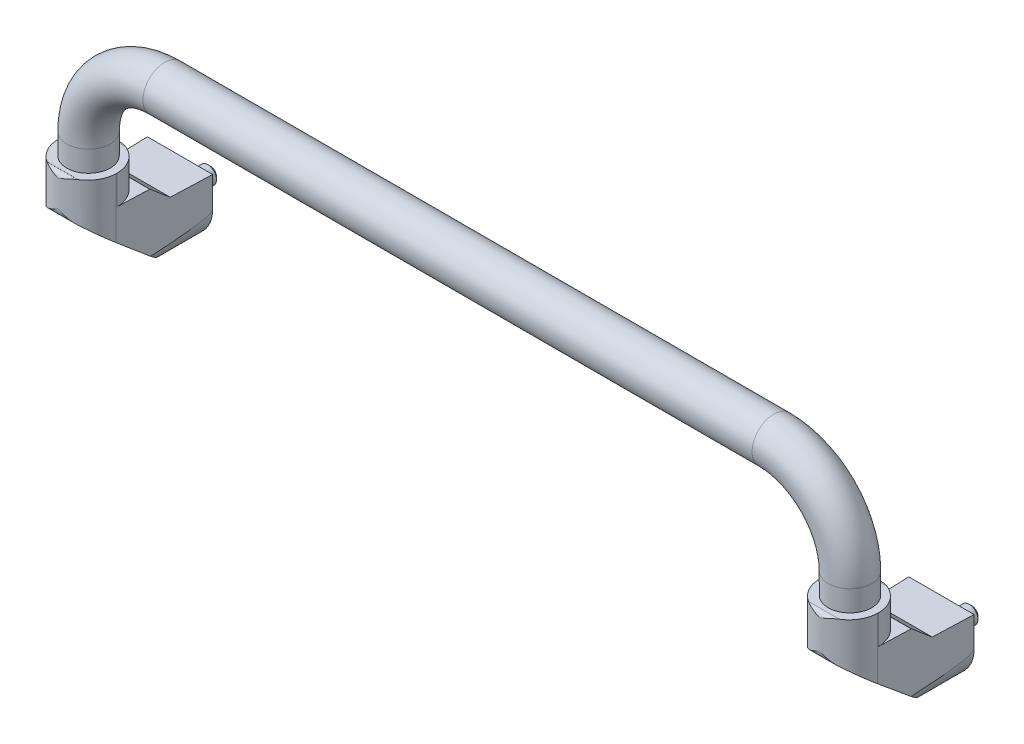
ISO-10303-21;
HEADER;
FILE_DESCRIPTION(('STEP AP214'),'2;1');
FILE_NAME('part.step','',(''),(''),'','','');
FILE_SCHEMA(('AUTOMOTIVE_DESIGN { 1 0 10303 214 1 1 1 1 }'));
ENDSEC;
DATA;
#1=APPLICATION_CONTEXT('core data for automotive mechanical design processes');
#2=APPLICATION_PROTOCOL_DEFINITION('international standard','automotive_design',2000,#1);
#3=PRODUCT_CONTEXT('',#1,'mechanical');
#4=PRODUCT('Part','Part','',(#3));
#5=PRODUCT_RELATED_PRODUCT_CATEGORY('part','',(#4));
#6=PRODUCT_DEFINITION_FORMATION('','',#4);
#7=PRODUCT_DEFINITION_CONTEXT('part definition',#1,'design');
#8=PRODUCT_DEFINITION('design','',#6,#7);
#9=PRODUCT_DEFINITION_SHAPE('','',#8);
#10=(LENGTH_UNIT() NAMED_UNIT(*) SI_UNIT(.MILLI.,.METRE.));
#11=(NAMED_UNIT(*) PLANE_ANGLE_UNIT() SI_UNIT($,.RADIAN.));
#12=(NAMED_UNIT(*) SI_UNIT($,.STERADIAN.) SOLID_ANGLE_UNIT());
#13=UNCERTAINTY_MEASURE_WITH_UNIT(LENGTH_MEASURE(1.E-05),#10,'distance_accuracy_value','');
#14=(GEOMETRIC_REPRESENTATION_CONTEXT(3) GLOBAL_UNCERTAINTY_ASSIGNED_CONTEXT((#13)) GLOBAL_UNIT_ASSIGNED_CONTEXT((#10,
#11,#12)) REPRESENTATION_CONTEXT('',''));
#15=CARTESIAN_POINT('',(0.,0.,0.));
#16=DIRECTION('',(0.,0.,1.));
#17=DIRECTION('',(1.,0.,0.));
#18=AXIS2_PLACEMENT_3D('',#15,#16,#17);
#19=CARTESIAN_POINT('',(14.5950313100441,35.,11.5380553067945));
#20=DIRECTION('',(-0.999384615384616,0.,-0.0350769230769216));
#21=DIRECTION('',(-0.0350769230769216,0.,0.999384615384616));
#22=AXIS2_PLACEMENT_3D('',#19,#20,#21);
#23=PLANE('',#22);
#24=DIRECTION('',(0.0350769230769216,0.,-0.999384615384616));
#25=VECTOR('',#24,1.);
#26=CARTESIAN_POINT('',(14.5950313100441,14.0068766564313,11.5380553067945));
#27=LINE('',#26,#25);
#28=CARTESIAN_POINT('',(14.339275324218,14.0068766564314,18.824857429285));
#29=VERTEX_POINT('',#28);
#30=CARTESIAN_POINT('',(15.,14.0068766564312,0.));
#31=VERTEX_POINT('',#30);
#32=EDGE_CURVE('E655',#29,#31,#27,.T.);
#33=ORIENTED_EDGE('',*,*,#32,.F.);
#34=DIRECTION('',(0.0268773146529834,-0.642555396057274,-0.76576770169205));
#35=VECTOR('',#34,1.);
#36=CARTESIAN_POINT('',(14.126880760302,19.0845890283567,24.876239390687));
#37=LINE('',#36,#35);
#38=CARTESIAN_POINT('',(14.019441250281,21.6531431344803,27.9373229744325));
#39=VERTEX_POINT('',#38);
#40=EDGE_CURVE('E649',#39,#29,#37,.T.);
#41=ORIENTED_EDGE('',*,*,#40,.F.);
#42=DIRECTION('',(0.,1.,0.));
#43=VECTOR('',#42,1.);
#44=CARTESIAN_POINT('',(14.019441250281,35.,27.9373229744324));
#45=LINE('',#44,#43);
#46=CARTESIAN_POINT('',(14.019441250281,21.6,27.9373229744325));
#47=VERTEX_POINT('',#46);
#48=EDGE_CURVE('E736',#47,#39,#45,.T.);
#49=ORIENTED_EDGE('',*,*,#48,.F.);
#50=DIRECTION('',(0.0350769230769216,0.,-0.999384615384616));
#51=VECTOR('',#50,1.);
#52=CARTESIAN_POINT('',(14.5950313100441,21.6,11.5380553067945));
#53=LINE('',#52,#51);
#54=CARTESIAN_POINT('',(13.5083128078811,21.6,42.5));
#55=VERTEX_POINT('',#54);
#56=EDGE_CURVE('E733',#55,#47,#53,.T.);
#57=ORIENTED_EDGE('',*,*,#56,.F.);
#58=DIRECTION('',(0.,1.,0.));
#59=VECTOR('',#58,1.);
#60=CARTESIAN_POINT('',(13.5083128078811,35.,42.5));
#61=LINE('',#60,#59);
#62=CARTESIAN_POINT('',(13.5083128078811,35.,42.5));
#63=VERTEX_POINT('',#62);
#64=EDGE_CURVE('E701',#55,#63,#61,.T.);
#65=ORIENTED_EDGE('',*,*,#64,.T.);
#66=DIRECTION('',(0.0350769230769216,0.,-0.999384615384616));
#67=VECTOR('',#66,1.);
#68=CARTESIAN_POINT('',(14.5950313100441,35.,11.5380553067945));
#69=LINE('',#68,#67);
#70=CARTESIAN_POINT('',(13.491692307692,35.,42.9735384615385));
#71=VERTEX_POINT('',#70);
#72=EDGE_CURVE('E322',#71,#63,#69,.T.);
#73=ORIENTED_EDGE('',*,*,#72,.F.);
#74=DIRECTION('',(0.,-1.,0.));
#75=VECTOR('',#74,1.);
#76=CARTESIAN_POINT('',(13.491692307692,35.,42.9735384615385));
#77=LINE('',#76,#75);
#78=CARTESIAN_POINT('',(13.491692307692,7.63348617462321,42.9735384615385));
#79=VERTEX_POINT('',#78);
#80=EDGE_CURVE('E334',#71,#79,#77,.T.);
#81=ORIENTED_EDGE('',*,*,#80,.T.);
#82=DIRECTION('',(0.0268773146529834,-0.642555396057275,-0.765767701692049));
#83=VECTOR('',#82,1.);
#84=CARTESIAN_POINT('',(13.6668633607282,3.44567549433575,37.9827000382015));
#85=LINE('',#84,#83);
#86=CARTESIAN_POINT('',(14.03266224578,-5.29947075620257,27.5606405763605));
#87=VERTEX_POINT('',#86);
#88=EDGE_CURVE('E675',#79,#87,#85,.T.);
#89=ORIENTED_EDGE('',*,*,#88,.T.);
#90=CARTESIAN_POINT('',(0.,0.,427.36842105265));
#91=DIRECTION('',(-0.999384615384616,0.,-0.0350769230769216));
#92=DIRECTION('',(0.0350769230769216,0.,-0.999384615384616));
#93=AXIS2_PLACEMENT_3D('',#90,#91,#92);
#94=ELLIPSE('',#93,427.631578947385,15.);
#95=CARTESIAN_POINT('',(14.988671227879,-0.582867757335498,0.322770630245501));
#96=VERTEX_POINT('',#95);
#97=EDGE_CURVE('E308',#87,#96,#94,.F.);
#98=ORIENTED_EDGE('',*,*,#97,.T.);
#99=DIRECTION('',(0.0350769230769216,0.,-0.999384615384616));
#100=VECTOR('',#99,1.);
#101=CARTESIAN_POINT('',(14.5950313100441,-0.582867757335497,11.5380553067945));
#102=LINE('',#101,#100);
#103=CARTESIAN_POINT('',(15.,-0.582867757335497,0.));
#104=VERTEX_POINT('',#103);
#105=EDGE_CURVE('E310',#96,#104,#102,.T.);
#106=ORIENTED_EDGE('',*,*,#105,.T.);
#107=DIRECTION('',(0.,-1.,0.));
#108=VECTOR('',#107,1.);
#109=CARTESIAN_POINT('',(15.,35.,0.));
#110=LINE('',#109,#108);
#111=EDGE_CURVE('E332',#31,#104,#110,.T.);
#112=ORIENTED_EDGE('',*,*,#111,.F.);
#113=EDGE_LOOP('',(#33,#41,#49,#57,#65,#73,#81,#89,#98,#106,#112));
#114=FACE_BOUND('',#113,.T.);
#115=ADVANCED_FACE('F14',(#114),#23,.F.);
#116=CARTESIAN_POINT('',(0.,35.,0.));
#117=DIRECTION('',(0.,0.,-1.));
#118=DIRECTION('',(0.,-1.,0.));
#119=AXIS2_PLACEMENT_3D('',#116,#117,#118);
#120=PLANE('',#119);
#121=CARTESIAN_POINT('',(0.,0.,0.));
#122=DIRECTION('',(0.,0.,-1.));
#123=DIRECTION('',(0.,-1.,0.));
#124=AXIS2_PLACEMENT_3D('',#121,#122,#123);
#125=CIRCLE('',#124,3.99999999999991);
#126=CARTESIAN_POINT('',(0.,-3.99999999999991,0.));
#127=VERTEX_POINT('',#126);
#128=EDGE_CURVE('E734',#127,#127,#125,.T.);
#129=ORIENTED_EDGE('',*,*,#128,.F.);
#130=EDGE_LOOP('',(#129));
#131=FACE_BOUND('',#130,.T.);
#132=DIRECTION('',(0.,-1.,0.));
#133=VECTOR('',#132,1.);
#134=CARTESIAN_POINT('',(-15.,35.,0.));
#135=LINE('',#134,#133);
#136=CARTESIAN_POINT('',(-15.000000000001,14.0068766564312,-2.99294009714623E-12));
#137=VERTEX_POINT('',#136);
#138=CARTESIAN_POINT('',(-15.,-0.582867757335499,0.));
#139=VERTEX_POINT('',#138);
#140=EDGE_CURVE('E340',#137,#139,#135,.T.);
#141=ORIENTED_EDGE('',*,*,#140,.F.);
#142=DIRECTION('',(1.,0.,0.));
#143=VECTOR('',#142,1.);
#144=CARTESIAN_POINT('',(0.,14.0068766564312,0.));
#145=LINE('',#144,#143);
#146=EDGE_CURVE('E653',#137,#31,#145,.T.);
#147=ORIENTED_EDGE('',*,*,#146,.T.);
#148=ORIENTED_EDGE('',*,*,#111,.T.);
#149=DIRECTION('',(1.,0.,0.));
#150=VECTOR('',#149,1.);
#151=CARTESIAN_POINT('',(14.988671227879,-0.582867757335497,0.));
#152=LINE('',#151,#150);
#153=CARTESIAN_POINT('',(14.988671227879,-0.582867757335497,0.));
#154=VERTEX_POINT('',#153);
#155=EDGE_CURVE('E297',#154,#104,#152,.T.);
#156=ORIENTED_EDGE('',*,*,#155,.F.);
#157=CARTESIAN_POINT('',(0.,0.,0.));
#158=DIRECTION('',(0.,0.,1.));
#159=DIRECTION('',(0.,-1.,0.));
#160=AXIS2_PLACEMENT_3D('',#157,#158,#159);
#161=CIRCLE('',#160,15.);
#162=CARTESIAN_POINT('',(-14.98867122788,-0.582867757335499,0.));
#163=VERTEX_POINT('',#162);
#164=EDGE_CURVE('E292',#163,#154,#161,.T.);
#165=ORIENTED_EDGE('',*,*,#164,.F.);
#166=DIRECTION('',(-1.,0.,0.));
#167=VECTOR('',#166,1.);
#168=CARTESIAN_POINT('',(-14.98867122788,-0.582867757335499,0.));
#169=LINE('',#168,#167);
#170=EDGE_CURVE('E294',#163,#139,#169,.T.);
#171=ORIENTED_EDGE('',*,*,#170,.T.);
#172=EDGE_LOOP('',(#141,#147,#148,#156,#165,#171));
#173=FACE_BOUND('',#172,.T.);
#174=ADVANCED_FACE('F564',(#131,#173),#120,.T.);
#175=CARTESIAN_POINT('',(0.,35.,42.5));
#176=DIRECTION('',(0.,1.,0.));
#177=DIRECTION('',(1.,0.,0.));
#178=AXIS2_PLACEMENT_3D('',#175,#176,#177);
#179=PLANE('',#178);
#180=CARTESIAN_POINT('',(-0.0396757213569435,35.,41.9999909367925));
#181=DIRECTION('',(0.,1.,0.));
#182=DIRECTION('',(-1.,0.,0.));
#183=AXIS2_PLACEMENT_3D('',#180,#181,#182);
#184=CIRCLE('',#183,10.);
#185=CARTESIAN_POINT('',(-10.0396757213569,35.,41.9999909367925));
#186=VERTEX_POINT('',#185);
#187=EDGE_CURVE('E342',#186,#186,#184,.T.);
#188=ORIENTED_EDGE('',*,*,#187,.F.);
#189=EDGE_LOOP('',(#188));
#190=FACE_BOUND('',#189,.T.);
#191=CARTESIAN_POINT('',(0.,35.,42.5));
#192=DIRECTION('',(0.,-1.,0.));
#193=DIRECTION('',(1.,0.,0.));
#194=AXIS2_PLACEMENT_3D('',#191,#192,#193);
#195=CIRCLE('',#194,13.5);
#196=CARTESIAN_POINT('',(5.09901951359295,35.,30.));
#197=VERTEX_POINT('',#196);
#198=CARTESIAN_POINT('',(13.4999999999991,35.,42.5));
#199=VERTEX_POINT('',#198);
#200=EDGE_CURVE('E257',#197,#199,#195,.T.);
#201=ORIENTED_EDGE('',*,*,#200,.F.);
#202=DIRECTION('',(1.,0.,0.));
#203=VECTOR('',#202,1.);
#204=CARTESIAN_POINT('',(-15.000000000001,35.,30.));
#205=LINE('',#204,#203);
#206=CARTESIAN_POINT('',(-5.09901951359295,35.,30.));
#207=VERTEX_POINT('',#206);
#208=EDGE_CURVE('E36',#207,#197,#205,.T.);
#209=ORIENTED_EDGE('',*,*,#208,.F.);
#210=CARTESIAN_POINT('',(-13.5,35.,42.5));
#211=VERTEX_POINT('',#210);
#212=EDGE_CURVE('E255',#211,#207,#195,.T.);
#213=ORIENTED_EDGE('',*,*,#212,.F.);
#214=DIRECTION('',(1.,0.,0.));
#215=VECTOR('',#214,1.);
#216=CARTESIAN_POINT('',(-14.98867122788,35.,42.5));
#217=LINE('',#216,#215);
#218=CARTESIAN_POINT('',(-13.508312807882,35.,42.5));
#219=VERTEX_POINT('',#218);
#220=EDGE_CURVE('E265',#219,#211,#217,.T.);
#221=ORIENTED_EDGE('',*,*,#220,.F.);
#222=DIRECTION('',(0.0350769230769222,0.,0.999384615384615));
#223=VECTOR('',#222,1.);
#224=CARTESIAN_POINT('',(-14.595031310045,35.,11.5380553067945));
#225=LINE('',#224,#223);
#226=CARTESIAN_POINT('',(-13.491692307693,35.,42.9735384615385));
#227=VERTEX_POINT('',#226);
#228=EDGE_CURVE('E329',#219,#227,#225,.T.);
#229=ORIENTED_EDGE('',*,*,#228,.T.);
#230=CARTESIAN_POINT('',(0.,35.,42.5));
#231=DIRECTION('',(0.,-1.,0.));
#232=DIRECTION('',(1.,0.,0.));
#233=AXIS2_PLACEMENT_3D('',#230,#231,#232);
#234=CIRCLE('',#233,13.5);
#235=CARTESIAN_POINT('',(-7.07092481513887,35.,54.000087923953));
#236=VERTEX_POINT('',#235);
#237=EDGE_CURVE('E325',#236,#227,#234,.T.);
#238=ORIENTED_EDGE('',*,*,#237,.F.);
#239=DIRECTION('',(-1.,0.,0.));
#240=VECTOR('',#239,1.);
#241=CARTESIAN_POINT('',(0.,35.,54.0000879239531));
#242=LINE('',#241,#240);
#243=CARTESIAN_POINT('',(7.07092481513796,35.,54.000087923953));
#244=VERTEX_POINT('',#243);
#245=EDGE_CURVE('E598',#244,#236,#242,.T.);
#246=ORIENTED_EDGE('',*,*,#245,.F.);
#247=EDGE_CURVE('E326',#71,#244,#234,.T.);
#248=ORIENTED_EDGE('',*,*,#247,.F.);
#249=ORIENTED_EDGE('',*,*,#72,.T.);
#250=DIRECTION('',(1.,0.,0.));
#251=VECTOR('',#250,1.);
#252=CARTESIAN_POINT('',(13.4999999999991,35.,42.5));
#253=LINE('',#252,#251);
#254=EDGE_CURVE('E267',#199,#63,#253,.T.);
#255=ORIENTED_EDGE('',*,*,#254,.F.);
#256=EDGE_LOOP('',(#201,#209,#213,#221,#229,#238,#246,#248,#249,#255));
#257=FACE_BOUND('',#256,.T.);
#258=ADVANCED_FACE('F253',(#190,#257),#179,.T.);
#259=CARTESIAN_POINT('',(-14.595031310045,35.,11.5380553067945));
#260=DIRECTION('',(0.999384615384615,0.,-0.0350769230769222));
#261=DIRECTION('',(-0.0350769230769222,0.,-0.999384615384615));
#262=AXIS2_PLACEMENT_3D('',#259,#260,#261);
#263=PLANE('',#262);
#264=DIRECTION('',(0.0350769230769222,0.,0.999384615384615));
#265=VECTOR('',#264,1.);
#266=CARTESIAN_POINT('',(-14.595031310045,14.0068766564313,11.5380553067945));
#267=LINE('',#266,#265);
#268=CARTESIAN_POINT('',(-14.3392753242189,14.0068766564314,18.824857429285));
#269=VERTEX_POINT('',#268);
#270=EDGE_CURVE('E9',#137,#269,#267,.T.);
#271=ORIENTED_EDGE('',*,*,#270,.F.);
#272=ORIENTED_EDGE('',*,*,#140,.T.);
#273=DIRECTION('',(-0.0350769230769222,0.,-0.999384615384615));
#274=VECTOR('',#273,1.);
#275=CARTESIAN_POINT('',(-14.595031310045,-0.582867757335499,11.5380553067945));
#276=LINE('',#275,#274);
#277=CARTESIAN_POINT('',(-14.98867122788,-0.5828677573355,0.322770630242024));
#278=VERTEX_POINT('',#277);
#279=EDGE_CURVE('E313',#278,#139,#276,.T.);
#280=ORIENTED_EDGE('',*,*,#279,.F.);
#281=CARTESIAN_POINT('',(0.,0.,427.36842105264));
#282=DIRECTION('',(0.999384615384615,0.,-0.0350769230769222));
#283=DIRECTION('',(-0.0350769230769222,0.,-0.999384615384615));
#284=AXIS2_PLACEMENT_3D('',#281,#282,#283);
#285=ELLIPSE('',#284,427.631578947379,15.);
#286=CARTESIAN_POINT('',(-14.0326622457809,-5.29947075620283,27.5606405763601));
#287=VERTEX_POINT('',#286);
#288=EDGE_CURVE('E305',#278,#287,#285,.F.);
#289=ORIENTED_EDGE('',*,*,#288,.T.);
#290=DIRECTION('',(0.0268773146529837,0.642555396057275,0.765767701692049));
#291=VECTOR('',#290,1.);
#292=CARTESIAN_POINT('',(-13.6668633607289,3.4456754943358,37.9827000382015));
#293=LINE('',#292,#291);
#294=CARTESIAN_POINT('',(-13.491692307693,7.6334861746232,42.9735384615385));
#295=VERTEX_POINT('',#294);
#296=EDGE_CURVE('E672',#287,#295,#293,.T.);
#297=ORIENTED_EDGE('',*,*,#296,.T.);
#298=DIRECTION('',(0.,-1.,0.));
#299=VECTOR('',#298,1.);
#300=CARTESIAN_POINT('',(-13.491692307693,35.,42.9735384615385));
#301=LINE('',#300,#299);
#302=EDGE_CURVE('E337',#227,#295,#301,.T.);
#303=ORIENTED_EDGE('',*,*,#302,.F.);
#304=ORIENTED_EDGE('',*,*,#228,.F.);
#305=DIRECTION('',(0.,-1.,0.));
#306=VECTOR('',#305,1.);
#307=CARTESIAN_POINT('',(-13.508312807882,35.,42.5));
#308=LINE('',#307,#306);
#309=CARTESIAN_POINT('',(-13.508312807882,21.6,42.5));
#310=VERTEX_POINT('',#309);
#311=EDGE_CURVE('E693',#219,#310,#308,.T.);
#312=ORIENTED_EDGE('',*,*,#311,.T.);
#313=DIRECTION('',(0.0350769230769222,0.,0.999384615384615));
#314=VECTOR('',#313,1.);
#315=CARTESIAN_POINT('',(-14.595031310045,21.6,11.5380553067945));
#316=LINE('',#315,#314);
#317=CARTESIAN_POINT('',(-14.019441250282,21.6,27.9373229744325));
#318=VERTEX_POINT('',#317);
#319=EDGE_CURVE('E288',#318,#310,#316,.T.);
#320=ORIENTED_EDGE('',*,*,#319,.F.);
#321=DIRECTION('',(0.,-1.,0.));
#322=VECTOR('',#321,1.);
#323=CARTESIAN_POINT('',(-14.019441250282,35.,27.9373229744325));
#324=LINE('',#323,#322);
#325=CARTESIAN_POINT('',(-14.019441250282,21.6531431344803,27.9373229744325));
#326=VERTEX_POINT('',#325);
#327=EDGE_CURVE('E290',#326,#318,#324,.T.);
#328=ORIENTED_EDGE('',*,*,#327,.F.);
#329=DIRECTION('',(0.0268773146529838,0.642555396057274,0.76576770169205));
#330=VECTOR('',#329,1.);
#331=CARTESIAN_POINT('',(-14.126880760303,19.0845890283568,24.8762393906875));
#332=LINE('',#331,#330);
#333=EDGE_CURVE('E29',#269,#326,#332,.T.);
#334=ORIENTED_EDGE('',*,*,#333,.F.);
#335=EDGE_LOOP('',(#271,#272,#280,#289,#297,#303,#304,#312,#320,#328,#334));
#336=FACE_BOUND('',#335,.T.);
#337=ADVANCED_FACE('F583',(#336),#263,.F.);
#338=CARTESIAN_POINT('',(-14.9886712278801,21.6,27.9373229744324));
#339=DIRECTION('',(0.,0.,1.));
#340=DIRECTION('',(0.,1.,0.));
#341=AXIS2_PLACEMENT_3D('',#338,#339,#340);
#342=PLANE('',#341);
#343=ORIENTED_EDGE('',*,*,#48,.T.);
#344=DIRECTION('',(-1.,0.,0.));
#345=VECTOR('',#344,1.);
#346=CARTESIAN_POINT('',(-14.9886712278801,21.6531431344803,27.9373229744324));
#347=LINE('',#346,#345);
#348=EDGE_CURVE('E22',#39,#326,#347,.T.);
#349=ORIENTED_EDGE('',*,*,#348,.T.);
#350=ORIENTED_EDGE('',*,*,#327,.T.);
#351=DIRECTION('',(1.,0.,0.));
#352=VECTOR('',#351,1.);
#353=CARTESIAN_POINT('',(-14.9886712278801,21.6,27.9373229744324));
#354=LINE('',#353,#352);
#355=EDGE_CURVE('E279',#318,#47,#354,.T.);
#356=ORIENTED_EDGE('',*,*,#355,.T.);
#357=EDGE_LOOP('',(#343,#349,#350,#356));
#358=FACE_BOUND('',#357,.T.);
#359=ADVANCED_FACE('F581',(#358),#342,.T.);
#360=CARTESIAN_POINT('',(0.,35.,42.5));
#361=DIRECTION('',(0.,-1.,0.));
#362=DIRECTION('',(1.,0.,0.));
#363=AXIS2_PLACEMENT_3D('',#360,#361,#362);
#364=CYLINDRICAL_SURFACE('',#363,13.5);
#365=DIRECTION('',(0.,-1.,0.));
#366=VECTOR('',#365,1.);
#367=CARTESIAN_POINT('',(7.07092481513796,35.,54.000087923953));
#368=LINE('',#367,#366);
#369=CARTESIAN_POINT('',(7.07092481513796,34.9704219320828,54.000087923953));
#370=VERTEX_POINT('',#369);
#371=EDGE_CURVE('E682',#370,#244,#368,.F.);
#372=ORIENTED_EDGE('',*,*,#371,.F.);
#373=CARTESIAN_POINT('',(-7.07092481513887,34.9704219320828,54.000087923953));
#374=CARTESIAN_POINT('',(-6.8775037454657,34.9704282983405,54.1190115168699));
#375=CARTESIAN_POINT('',(-6.68105374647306,34.959869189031,54.2330583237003));
#376=CARTESIAN_POINT('',(-6.2838135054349,34.9221612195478,54.450527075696));
#377=CARTESIAN_POINT('',(-6.08301891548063,34.8949949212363,54.5539377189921));
#378=CARTESIAN_POINT('',(-5.67707138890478,34.8272761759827,54.7503886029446));
#379=CARTESIAN_POINT('',(-5.47189888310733,34.7866398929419,54.8433588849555));
#380=CARTESIAN_POINT('',(-5.0593139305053,34.694757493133,55.0181285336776));
#381=CARTESIAN_POINT('',(-4.851902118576,34.6435143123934,55.09993098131));
#382=CARTESIAN_POINT('',(-4.36508724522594,34.5138570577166,55.2782623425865));
#383=CARTESIAN_POINT('',(-4.08498441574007,34.4321066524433,55.3704604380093));
#384=CARTESIAN_POINT('',(-3.52253018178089,34.2574892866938,55.5356338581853));
#385=CARTESIAN_POINT('',(-3.24017788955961,34.1646177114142,55.6086011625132));
#386=CARTESIAN_POINT('',(-2.67652768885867,33.971809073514,55.7351381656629));
#387=CARTESIAN_POINT('',(-2.39524290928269,33.871942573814,55.7888753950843));
#388=CARTESIAN_POINT('',(-1.83184388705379,33.6670280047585,55.8781780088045));
#389=CARTESIAN_POINT('',(-1.54973016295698,33.5619827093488,55.9137530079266));
#390=CARTESIAN_POINT('',(-1.1714643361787,33.419293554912,55.949421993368));
#391=CARTESIAN_POINT('',(-1.07551786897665,33.3829421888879,55.9574338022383));
#392=CARTESIAN_POINT('',(-0.88351347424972,33.309986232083,55.9714019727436));
#393=CARTESIAN_POINT('',(-0.787455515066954,33.2733815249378,55.9773573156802));
#394=CARTESIAN_POINT('',(-0.593228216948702,33.1991990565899,55.9873180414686));
#395=CARTESIAN_POINT('',(-0.495058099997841,33.1616173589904,55.9912785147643));
#396=CARTESIAN_POINT('',(-0.347759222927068,33.1055246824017,55.9956090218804));
#397=CARTESIAN_POINT('',(-0.298700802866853,33.0868920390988,55.9967837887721));
#398=CARTESIAN_POINT('',(-0.200553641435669,33.0496905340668,55.998599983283));
#399=CARTESIAN_POINT('',(-0.151464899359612,33.0311216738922,55.9992413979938));
#400=CARTESIAN_POINT('',(-0.0849879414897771,33.0080155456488,55.9997430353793));
#401=CARTESIAN_POINT('',(-0.0680493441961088,33.0023025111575,55.9998394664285));
#402=CARTESIAN_POINT('',(-0.0424994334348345,32.9952097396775,55.9999356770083));
#403=CARTESIAN_POINT('',(-0.0341004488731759,32.9931150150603,55.9999596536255));
#404=CARTESIAN_POINT('',(-0.0171291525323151,32.9901026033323,55.9999917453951));
#405=CARTESIAN_POINT('',(-0.00855921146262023,32.9891740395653,56.0000000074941));
#406=CARTESIAN_POINT('',(0.00879402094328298,32.9891765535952,55.9999999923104));
#407=CARTESIAN_POINT('',(0.0175772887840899,32.9901547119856,55.9999912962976));
#408=CARTESIAN_POINT('',(0.0349664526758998,32.993300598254,55.9999575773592));
#409=CARTESIAN_POINT('',(0.043569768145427,32.9954798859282,55.999932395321));
#410=CARTESIAN_POINT('',(0.0697279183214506,33.0028315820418,55.9998314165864));
#411=CARTESIAN_POINT('',(0.0870672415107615,33.0087214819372,55.9997302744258));
#412=CARTESIAN_POINT('',(0.171095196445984,33.0380140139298,55.9990808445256));
#413=CARTESIAN_POINT('',(0.237058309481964,33.0633144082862,55.9980811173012));
#414=CARTESIAN_POINT('',(0.367738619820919,33.1132270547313,55.9951443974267));
#415=CARTESIAN_POINT('',(0.43245475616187,33.1378430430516,55.9932262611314));
#416=CARTESIAN_POINT('',(0.627360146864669,33.2121316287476,55.9860459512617));
#417=CARTESIAN_POINT('',(0.757454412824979,33.2619227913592,55.9793646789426));
#418=CARTESIAN_POINT('',(1.01760396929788,33.3610278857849,55.9622233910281));
#419=CARTESIAN_POINT('',(1.14765924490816,33.4103417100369,55.9517625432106));
#420=CARTESIAN_POINT('',(1.5401560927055,33.5583124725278,55.9144503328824));
#421=CARTESIAN_POINT('',(1.80241871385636,33.6560305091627,55.8817605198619));
#422=CARTESIAN_POINT('',(2.39427723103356,33.87190795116,55.7901814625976));
#423=CARTESIAN_POINT('',(2.7236469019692,33.9887746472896,55.7266896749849));
#424=CARTESIAN_POINT('',(3.38052871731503,34.2114954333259,55.5742426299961));
#425=CARTESIAN_POINT('',(3.70803931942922,34.3173413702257,55.4852687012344));
#426=CARTESIAN_POINT('',(4.35819027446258,34.5122628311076,55.2816858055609));
#427=CARTESIAN_POINT('',(4.68084736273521,34.6014256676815,55.1672175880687));
#428=CARTESIAN_POINT('',(5.16087542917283,34.7178726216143,54.9757774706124));
#429=CARTESIAN_POINT('',(5.32015518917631,34.7537932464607,54.9087086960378));
#430=CARTESIAN_POINT('',(5.63716070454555,34.8187750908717,54.7679448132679));
#431=CARTESIAN_POINT('',(5.79488691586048,34.8478383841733,54.6942517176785));
#432=CARTESIAN_POINT('',(6.06000533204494,34.890081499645,54.564034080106));
#433=CARTESIAN_POINT('',(6.16790737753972,34.9053950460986,54.5092308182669));
#434=CARTESIAN_POINT('',(6.38261514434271,34.9315949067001,54.3965087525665));
#435=CARTESIAN_POINT('',(6.48942096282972,34.9424816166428,54.3385902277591));
#436=CARTESIAN_POINT('',(6.70186294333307,34.959243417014,54.2196361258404));
#437=CARTESIAN_POINT('',(6.8074975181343,34.9651123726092,54.1585968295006));
#438=CARTESIAN_POINT('',(7.01720095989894,34.9711201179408,54.033593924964));
#439=CARTESIAN_POINT('',(7.12126983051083,34.9712589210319,53.969630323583));
#440=CARTESIAN_POINT('',(7.32838648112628,34.9649685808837,53.8384260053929));
#441=CARTESIAN_POINT('',(7.4314179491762,34.9584833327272,53.771161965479));
#442=CARTESIAN_POINT('',(7.63511779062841,34.9378853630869,53.6341833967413));
#443=CARTESIAN_POINT('',(7.73578568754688,34.923771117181,53.5644683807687));
#444=CARTESIAN_POINT('',(7.93394129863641,34.8868175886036,53.4232476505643));
#445=CARTESIAN_POINT('',(8.03143518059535,34.8639964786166,53.3517459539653));
#446=CARTESIAN_POINT('',(8.22260264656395,34.808343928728,53.2076198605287));
#447=CARTESIAN_POINT('',(8.31627877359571,34.7755192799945,53.1349962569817));
#448=CARTESIAN_POINT('',(8.51057580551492,34.6934220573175,52.9803342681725));
#449=CARTESIAN_POINT('',(8.61054102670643,34.6425773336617,52.8982859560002));
#450=CARTESIAN_POINT('',(8.80216710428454,34.5239909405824,52.7365776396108));
#451=CARTESIAN_POINT('',(8.89383372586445,34.4562611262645,52.6569160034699));
#452=CARTESIAN_POINT('',(9.05162034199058,34.3145923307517,52.5163590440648));
#453=CARTESIAN_POINT('',(9.11946043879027,34.2435185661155,52.454535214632));
#454=CARTESIAN_POINT('',(9.24476625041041,34.087467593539,52.3382710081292));
#455=CARTESIAN_POINT('',(9.30224701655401,34.0025109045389,52.2838199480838));
#456=CARTESIAN_POINT('',(9.39284210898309,33.8391516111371,52.1967822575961));
#457=CARTESIAN_POINT('',(9.42853677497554,33.7633500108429,52.1620164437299));
#458=CARTESIAN_POINT('',(9.4902787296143,33.6045451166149,52.1013794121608));
#459=CARTESIAN_POINT('',(9.51633106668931,33.5215456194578,52.0755035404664));
#460=CARTESIAN_POINT('',(9.55753005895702,33.3497074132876,52.0343845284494));
#461=CARTESIAN_POINT('',(9.57260589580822,33.260834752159,52.019210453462));
#462=CARTESIAN_POINT('',(9.59060313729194,33.0806412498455,52.0010792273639));
#463=CARTESIAN_POINT('',(9.59353024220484,32.9893215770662,51.9981163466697));
#464=CARTESIAN_POINT('',(9.58739700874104,32.8171715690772,52.0043054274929));
#465=CARTESIAN_POINT('',(9.57956343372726,32.7362469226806,52.0122176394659));
#466=CARTESIAN_POINT('',(9.55445710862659,32.5774089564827,52.0374347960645));
#467=CARTESIAN_POINT('',(9.53718461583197,32.499495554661,52.0547394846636));
#468=CARTESIAN_POINT('',(9.4938100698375,32.3477345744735,52.0978384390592));
#469=CARTESIAN_POINT('',(9.46761759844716,32.2739380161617,52.1237195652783));
#470=CARTESIAN_POINT('',(9.40755152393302,32.1325392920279,52.1824450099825));
#471=CARTESIAN_POINT('',(9.37367436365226,32.0649400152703,52.2152925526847));
#472=CARTESIAN_POINT('',(9.28309871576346,31.9085063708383,52.3020150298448));
#473=CARTESIAN_POINT('',(9.22289796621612,31.8233081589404,52.3588047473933));
#474=CARTESIAN_POINT('',(9.09201649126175,31.6673398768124,52.4796404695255));
#475=CARTESIAN_POINT('',(9.021314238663,31.5966001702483,52.5437013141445));
#476=CARTESIAN_POINT('',(8.83971629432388,31.4412059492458,52.7043937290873));
#477=CARTESIAN_POINT('',(8.72463129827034,31.3636956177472,52.8031628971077));
#478=CARTESIAN_POINT('',(8.48328068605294,31.2326908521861,53.0027921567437));
#479=CARTESIAN_POINT('',(8.35699456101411,31.179241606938,53.10365581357));
#480=CARTESIAN_POINT('',(8.12310761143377,31.1012155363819,53.2834270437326));
#481=CARTESIAN_POINT('',(8.01691189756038,31.0729815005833,53.3626386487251));
#482=CARTESIAN_POINT('',(7.80064869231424,31.0274448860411,53.5189695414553));
#483=CARTESIAN_POINT('',(7.69057893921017,31.0101488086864,53.5960875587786));
#484=CARTESIAN_POINT('',(7.46735068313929,30.9849468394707,53.747528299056));
#485=CARTESIAN_POINT('',(7.35418900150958,30.9770510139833,53.8218479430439));
#486=CARTESIAN_POINT('',(7.12546874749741,30.9693699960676,53.9671737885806));
#487=CARTESIAN_POINT('',(7.00990934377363,30.9695876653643,54.0381788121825));
#488=CARTESIAN_POINT('',(6.6942034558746,30.9796506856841,54.2256662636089));
#489=CARTESIAN_POINT('',(6.49219751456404,30.9962153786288,54.3386830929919));
#490=CARTESIAN_POINT('',(6.0841665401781,31.0453499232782,54.553471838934));
#491=CARTESIAN_POINT('',(5.87813877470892,31.0779310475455,54.6552357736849));
#492=CARTESIAN_POINT('',(5.46253603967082,31.1558917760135,54.8476027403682));
#493=CARTESIAN_POINT('',(5.25295184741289,31.2013118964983,54.9381691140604));
#494=CARTESIAN_POINT('',(4.83167592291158,31.3022724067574,55.1077942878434));
#495=CARTESIAN_POINT('',(4.61998458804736,31.3578109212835,55.1868552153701));
#496=CARTESIAN_POINT('',(4.13829353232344,31.4928100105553,55.3532339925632));
#497=CARTESIAN_POINT('',(3.86779442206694,31.5747008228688,55.4371341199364));
#498=CARTESIAN_POINT('',(3.32490231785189,31.7480204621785,55.5871836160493));
#499=CARTESIAN_POINT('',(3.05250878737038,31.8394521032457,55.6533277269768));
#500=CARTESIAN_POINT('',(2.50838879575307,32.0284631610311,55.7678081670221));
#501=CARTESIAN_POINT('',(2.23667121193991,32.1259945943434,55.8162669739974));
#502=CARTESIAN_POINT('',(1.6925155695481,32.3255150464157,55.8963048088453));
#503=CARTESIAN_POINT('',(1.42007787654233,32.4275021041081,55.9278911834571));
#504=CARTESIAN_POINT('',(1.0594337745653,32.5639977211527,55.9586551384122));
#505=CARTESIAN_POINT('',(0.971407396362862,32.5974308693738,55.9652943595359));
#506=CARTESIAN_POINT('',(0.795276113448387,32.6644946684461,55.9768441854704));
#507=CARTESIAN_POINT('',(0.707171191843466,32.6981253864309,55.9817541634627));
#508=CARTESIAN_POINT('',(0.574252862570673,32.7488848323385,55.9878553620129));
#509=CARTESIAN_POINT('',(0.529460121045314,32.7659944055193,55.9896878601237));
#510=CARTESIAN_POINT('',(0.439859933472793,32.800229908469,55.9929068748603));
#511=CARTESIAN_POINT('',(0.395052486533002,32.8173558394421,55.9942933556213));
#512=CARTESIAN_POINT('',(0.305429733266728,32.8514111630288,55.996618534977));
#513=CARTESIAN_POINT('',(0.260614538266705,32.8683408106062,55.9975578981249));
#514=CARTESIAN_POINT('',(0.170992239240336,32.9022294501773,55.9989921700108));
#515=CARTESIAN_POINT('',(0.126185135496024,32.9191884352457,55.9994871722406));
#516=CARTESIAN_POINT('',(0.0673393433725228,32.9385313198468,55.9998385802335));
#517=CARTESIAN_POINT('',(0.0539644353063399,32.9427370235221,55.9998990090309));
#518=CARTESIAN_POINT('',(0.0337306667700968,32.9476947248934,55.9999594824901));
#519=CARTESIAN_POINT('',(0.0270488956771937,32.9491116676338,55.9999746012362));
#520=CARTESIAN_POINT('',(0.0135759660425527,32.9510967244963,55.9999948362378));
#521=CARTESIAN_POINT('',(0.00678553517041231,32.9516691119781,56.0000000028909));
#522=CARTESIAN_POINT('',(-0.00692023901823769,32.9516680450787,55.9999999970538));
#523=CARTESIAN_POINT('',(-0.0138355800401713,32.9510732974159,55.9999946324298));
#524=CARTESIAN_POINT('',(-0.027553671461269,32.949020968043,55.9999736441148));
#525=CARTESIAN_POINT('',(-0.0343556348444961,32.947558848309,55.9999579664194));
#526=CARTESIAN_POINT('',(-0.0549419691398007,32.9424579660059,55.999895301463));
#527=CARTESIAN_POINT('',(-0.0685452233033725,32.9381473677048,55.9998327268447));
#528=CARTESIAN_POINT('',(-0.137339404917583,32.9154604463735,55.9994146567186));
#529=CARTESIAN_POINT('',(-0.191635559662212,32.8946356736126,55.9987504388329));
#530=CARTESIAN_POINT('',(-0.299452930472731,32.8535542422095,55.9967831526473));
#531=CARTESIAN_POINT('',(-0.352973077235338,32.8332937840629,55.9954901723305));
#532=CARTESIAN_POINT('',(-0.513910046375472,32.77211179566,55.9906445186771));
#533=CARTESIAN_POINT('',(-0.621219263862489,32.7309705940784,55.9861281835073));
#534=CARTESIAN_POINT('',(-0.835826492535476,32.6489898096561,55.9745286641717));
#535=CARTESIAN_POINT('',(-0.943124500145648,32.6081502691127,55.9674451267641));
#536=CARTESIAN_POINT('',(-1.26653114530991,32.4854908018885,55.9422069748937));
#537=CARTESIAN_POINT('',(-1.48252415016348,32.404156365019,55.9201133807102));
#538=CARTESIAN_POINT('',(-2.05310658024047,32.1922671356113,55.8477580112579));
#539=CARTESIAN_POINT('',(-2.40736493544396,32.0637495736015,55.7885189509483));
#540=CARTESIAN_POINT('',(-3.11404692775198,31.8178919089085,55.6408966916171));
#541=CARTESIAN_POINT('',(-3.46646876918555,31.7005613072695,55.5524889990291));
#542=CARTESIAN_POINT('',(-4.16746062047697,31.4833378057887,55.3458337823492));
#543=CARTESIAN_POINT('',(-4.5160362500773,31.3834150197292,55.2276382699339));
#544=CARTESIAN_POINT('',(-5.03457491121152,31.2526265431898,55.0274642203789));
#545=CARTESIAN_POINT('',(-5.20662438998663,31.2122268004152,54.9569626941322));
#546=CARTESIAN_POINT('',(-5.54900117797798,31.1391058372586,54.8082653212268));
#547=CARTESIAN_POINT('',(-5.71932895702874,31.1063824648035,54.7300716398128));
#548=CARTESIAN_POINT('',(-6.05789214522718,31.0501830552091,54.5659581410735));
#549=CARTESIAN_POINT('',(-6.22612665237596,31.0267108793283,54.480035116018));
#550=CARTESIAN_POINT('',(-6.55983624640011,30.9910136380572,54.3006114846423));
#551=CARTESIAN_POINT('',(-6.72531058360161,30.978791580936,54.2071088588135));
#552=CARTESIAN_POINT('',(-7.05166813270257,30.9681285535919,54.013460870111));
#553=CARTESIAN_POINT('',(-7.21257096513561,30.9696151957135,53.9133531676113));
#554=CARTESIAN_POINT('',(-7.52921914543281,30.9893042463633,53.7069833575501));
#555=CARTESIAN_POINT('',(-7.68497020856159,31.0074874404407,53.6007284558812));
#556=CARTESIAN_POINT('',(-7.96520055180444,31.0599487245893,53.4009313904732));
#557=CARTESIAN_POINT('',(-8.09070943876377,31.0912019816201,53.3080599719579));
#558=CARTESIAN_POINT('',(-8.3351817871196,31.171254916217,53.1206613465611));
#559=CARTESIAN_POINT('',(-8.45413646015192,31.2200775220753,53.0261321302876));
#560=CARTESIAN_POINT('',(-8.68395719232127,31.3392533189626,52.8373706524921));
#561=CARTESIAN_POINT('',(-8.79471396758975,31.4098486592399,52.7431544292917));
#562=CARTESIAN_POINT('',(-9.00217867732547,31.575821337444,52.561293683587));
#563=CARTESIAN_POINT('',(-9.09893281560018,31.6711141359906,52.473628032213));
#564=CARTESIAN_POINT('',(-9.23879434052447,31.8463568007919,52.3437817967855));
#565=CARTESIAN_POINT('',(-9.28817710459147,31.9179858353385,52.2971229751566));
#566=CARTESIAN_POINT('',(-9.37762994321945,32.0711185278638,52.2115327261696));
#567=CARTESIAN_POINT('',(-9.41770381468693,32.1526181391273,52.1725981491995));
#568=CARTESIAN_POINT('',(-9.48688680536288,32.3251423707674,52.1047578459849));
#569=CARTESIAN_POINT('',(-9.51588964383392,32.4162491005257,52.0759495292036));
#570=CARTESIAN_POINT('',(-9.5604863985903,32.6047461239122,52.0314280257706));
#571=CARTESIAN_POINT('',(-9.57609448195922,32.7021296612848,52.0157010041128));
#572=CARTESIAN_POINT('',(-9.59162429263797,32.885885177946,52.0000441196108));
#573=CARTESIAN_POINT('',(-9.59339475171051,32.9719479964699,51.9982526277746));
#574=CARTESIAN_POINT('',(-9.58599731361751,33.1431030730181,52.005718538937));
#575=CARTESIAN_POINT('',(-9.57683219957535,33.2281955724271,52.0149731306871));
#576=CARTESIAN_POINT('',(-9.54901245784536,33.3895386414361,52.0428879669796));
#577=CARTESIAN_POINT('',(-9.53098605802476,33.4660095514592,52.0609248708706));
#578=CARTESIAN_POINT('',(-9.48665037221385,33.6140818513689,52.1049172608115));
#579=CARTESIAN_POINT('',(-9.46033984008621,33.6856825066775,52.1308739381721));
#580=CARTESIAN_POINT('',(-9.39781448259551,33.828959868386,52.1919112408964));
#581=CARTESIAN_POINT('',(-9.3609295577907,33.9000833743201,52.2275957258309));
#582=CARTESIAN_POINT('',(-9.27994226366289,34.0345276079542,52.3048874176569));
#583=CARTESIAN_POINT('',(-9.23583574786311,34.0978438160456,52.346498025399));
#584=CARTESIAN_POINT('',(-9.11466106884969,34.2505440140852,52.4590709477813));
#585=CARTESIAN_POINT('',(-9.0331778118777,34.3341014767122,52.5331997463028));
#586=CARTESIAN_POINT('',(-8.85933060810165,34.4828442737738,52.6870411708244));
#587=CARTESIAN_POINT('',(-8.76693805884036,34.5479797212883,52.7667682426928));
#588=CARTESIAN_POINT('',(-8.59815180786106,34.6477136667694,52.9082068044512));
#589=CARTESIAN_POINT('',(-8.52345485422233,34.6858802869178,52.9694956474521));
#590=CARTESIAN_POINT('',(-8.37043434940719,34.7538821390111,53.0922352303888));
#591=CARTESIAN_POINT('',(-8.29210876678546,34.7837126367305,53.1536860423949));
#592=CARTESIAN_POINT('',(-8.13252186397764,34.8359308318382,53.2760015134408));
#593=CARTESIAN_POINT('',(-8.05125866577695,34.8583136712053,53.3368657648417));
#594=CARTESIAN_POINT('',(-7.88639943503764,34.8964308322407,53.4574237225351));
#595=CARTESIAN_POINT('',(-7.80280402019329,34.9121668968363,53.5171177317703));
#596=CARTESIAN_POINT('',(-7.61287066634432,34.9408824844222,53.6494700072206));
#597=CARTESIAN_POINT('',(-7.5059940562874,34.9522332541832,53.7217075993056));
#598=CARTESIAN_POINT('',(-7.29004404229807,34.9669944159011,53.8631824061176));
#599=CARTESIAN_POINT('',(-7.18097469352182,34.970418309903,53.9324245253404));
#600=CARTESIAN_POINT('',(-7.07092481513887,34.9704219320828,54.000087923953));
#601=B_SPLINE_CURVE_WITH_KNOTS('',3,(#373,#374,#375,#376,#377,#378,#379,#380,#381,#382,#383,
#384,#385,#386,#387,#388,#389,#390,#391,#392,#393,#394,#395,#396,#397,#398,#399,#400,#401,#402,
#403,#404,#405,#406,#407,#408,#409,#410,#411,#412,#413,#414,#415,#416,#417,#418,#419,#420,#421,
#422,#423,#424,#425,#426,#427,#428,#429,#430,#431,#432,#433,#434,#435,#436,#437,#438,#439,#440,
#441,#442,#443,#444,#445,#446,#447,#448,#449,#450,#451,#452,#453,#454,#455,#456,#457,#458,#459,
#460,#461,#462,#463,#464,#465,#466,#467,#468,#469,#470,#471,#472,#473,#474,#475,#476,#477,#478,
#479,#480,#481,#482,#483,#484,#485,#486,#487,#488,#489,#490,#491,#492,#493,#494,#495,#496,#497,
#498,#499,#500,#501,#502,#503,#504,#505,#506,#507,#508,#509,#510,#511,#512,#513,#514,#515,#516,
#517,#518,#519,#520,#521,#522,#523,#524,#525,#526,#527,#528,#529,#530,#531,#532,#533,#534,#535,
#536,#537,#538,#539,#540,#541,#542,#543,#544,#545,#546,#547,#548,#549,#550,#551,#552,#553,#554,
#555,#556,#557,#558,#559,#560,#561,#562,#563,#564,#565,#566,#567,#568,#569,#570,#571,#572,#573,
#574,#575,#576,#577,#578,#579,#580,#581,#582,#583,#584,#585,#586,#587,#588,#589,#590,#591,#592,
#593,#594,#595,#596,#597,#598,#599,#600),.UNSPECIFIED.,.T.,.F.,(4,2,2,2,2,2,2,2,2,2,2,2,2,2,2,2,
2,2,2,2,2,2,2,2,2,2,2,2,2,2,2,2,2,2,2,2,2,2,2,2,2,2,2,2,2,2,2,2,2,2,2,2,2,2,2,2,2,2,2,2,2,2,2,2,
2,2,2,2,2,2,2,2,2,2,2,2,2,2,2,2,2,2,2,2,2,2,2,2,2,2,2,2,2,2,2,2,2,2,2,2,2,2,2,2,2,2,2,2,2,2,2,2,
2,4),(0.,0.681018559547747,1.36275344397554,2.04881365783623,2.73468422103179,3.65175112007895,
4.56919988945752,5.47844931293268,6.38721689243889,6.69594660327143,7.00482902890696,
7.32038497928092,7.47785211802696,7.63532306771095,7.68891598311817,7.71485961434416,
7.74055943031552,7.76690186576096,7.79350236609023,7.84840622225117,8.06037455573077,
8.26816619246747,8.68648102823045,9.10488802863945,9.94976609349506,11.0143604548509,
12.0797368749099,13.1393712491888,13.6687175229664,14.1979035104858,14.5637563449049,
14.9295764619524,15.2958432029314,15.6621090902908,16.0315031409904,16.4009710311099,
16.7696719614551,17.1381231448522,17.5539479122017,17.9694815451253,18.3164992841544,
18.6630086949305,18.9340664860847,19.2049821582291,19.4776306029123,19.7501511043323,
19.9940484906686,20.2379392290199,20.4843796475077,20.7309343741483,21.0852760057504,
21.4403542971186,21.9484772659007,22.4575505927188,22.8633742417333,23.269438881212,
23.6759379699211,24.0825804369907,24.7776517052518,25.473212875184,26.1709940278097,
26.8686459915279,27.7522861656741,28.6361877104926,29.5138461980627,30.3911222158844,
30.6742994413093,30.9575792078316,31.101530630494,31.2454936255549,31.3892419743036,
31.5329600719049,31.5749801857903,31.5954442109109,31.6158043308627,31.6365393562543,
31.657383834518,31.7001534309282,31.8745914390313,32.046318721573,32.3913236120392,
32.7363759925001,33.4317113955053,34.57487810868,35.7190072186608,36.8611522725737,
37.431714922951,38.0021174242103,38.5727577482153,39.1435506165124,39.7113311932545,
40.27845918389,40.755256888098,41.2326790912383,41.7156151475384,42.1969194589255,
42.4920691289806,42.7870982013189,43.0848922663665,43.3823709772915,43.6392865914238,
43.8961368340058,44.1369500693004,44.377799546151,44.6399476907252,44.9022468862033,
45.314701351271,45.7282622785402,46.0395108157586,46.3509357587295,46.6625634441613,
46.9741093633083,47.3622469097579,47.749722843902),.UNSPECIFIED.);
#602=CARTESIAN_POINT('',(-7.07092481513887,34.9704219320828,54.000087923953));
#603=VERTEX_POINT('',#602);
#604=EDGE_CURVE('E249',#603,#370,#601,.T.);
#605=ORIENTED_EDGE('',*,*,#604,.F.);
#606=DIRECTION('',(0.,-1.,0.));
#607=VECTOR('',#606,1.);
#608=CARTESIAN_POINT('',(-7.07092481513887,35.,54.000087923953));
#609=LINE('',#608,#607);
#610=EDGE_CURVE('E681',#236,#603,#609,.T.);
#611=ORIENTED_EDGE('',*,*,#610,.F.);
#612=ORIENTED_EDGE('',*,*,#237,.T.);
#613=ORIENTED_EDGE('',*,*,#302,.T.);
#614=CARTESIAN_POINT('',(0.,7.236140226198,42.5));
#615=DIRECTION('',(0.,0.766044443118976,-0.642787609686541));
#616=DIRECTION('',(0.,-0.642787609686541,-0.766044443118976));
#617=AXIS2_PLACEMENT_3D('',#614,#615,#616);
#618=ELLIPSE('',#617,17.6229984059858,13.5);
#619=CARTESIAN_POINT('',(-6.71071198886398,17.0653013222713,54.2139380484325));
#620=VERTEX_POINT('',#619);
#621=EDGE_CURVE('E680',#620,#295,#618,.F.);
#622=ORIENTED_EDGE('',*,*,#621,.F.);
#623=CARTESIAN_POINT('',(-10.488017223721,25.8955973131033,51.0000879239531));
#624=CARTESIAN_POINT('',(-10.3548605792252,25.8955979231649,51.1643849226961));
#625=CARTESIAN_POINT('',(-10.2178218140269,25.8874993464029,51.3255642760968));
#626=CARTESIAN_POINT('',(-9.9369984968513,25.8569288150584,51.6406044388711));
#627=CARTESIAN_POINT('',(-9.79320977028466,25.8344478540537,51.7944605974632));
#628=CARTESIAN_POINT('',(-9.49944231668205,25.7767476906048,52.0945196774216));
#629=CARTESIAN_POINT('',(-9.3494464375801,25.7414907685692,52.2406984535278));
#630=CARTESIAN_POINT('',(-9.04452071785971,25.6598445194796,52.5244722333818));
#631=CARTESIAN_POINT('',(-8.88959109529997,25.6134556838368,52.6620676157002));
#632=CARTESIAN_POINT('',(-8.49514726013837,25.4847540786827,52.9966335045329));
#633=CARTESIAN_POINT('',(-8.25288648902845,25.39620051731,53.1879927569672));
#634=CARTESIAN_POINT('',(-7.76065884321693,25.2010951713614,53.5505988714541));
#635=CARTESIAN_POINT('',(-7.51068827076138,25.0945346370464,53.7218358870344));
#636=CARTESIAN_POINT('',(-7.00422101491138,24.8666368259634,54.044749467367));
#637=CARTESIAN_POINT('',(-6.74771300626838,24.7452723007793,54.1963888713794));
#638=CARTESIAN_POINT('',(-6.2299244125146,24.4907521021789,54.4802014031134));
#639=CARTESIAN_POINT('',(-5.9686439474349,24.3575967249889,54.6123750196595));
#640=CARTESIAN_POINT('',(-5.30820307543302,24.011558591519,54.9203499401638));
#641=CARTESIAN_POINT('',(-4.90656953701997,23.7925991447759,55.0841034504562));
#642=CARTESIAN_POINT('',(-4.09718231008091,23.3393922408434,55.3704138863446));
#643=CARTESIAN_POINT('',(-3.68942504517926,23.1051355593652,55.4929456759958));
#644=CARTESIAN_POINT('',(-2.87073391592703,22.6268982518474,55.6979748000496));
#645=CARTESIAN_POINT('',(-2.45980821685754,22.382938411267,55.780553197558));
#646=CARTESIAN_POINT('',(-1.84190070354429,22.0126117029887,55.8753801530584));
#647=CARTESIAN_POINT('',(-1.63571327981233,21.8884596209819,55.9021469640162));
#648=CARTESIAN_POINT('',(-1.22288134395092,21.6392455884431,55.9461013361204));
#649=CARTESIAN_POINT('',(-1.01623681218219,21.5141835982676,55.9632884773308));
#650=CARTESIAN_POINT('',(-0.660987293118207,21.2986496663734,55.9846299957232));
#651=CARTESIAN_POINT('',(-0.512445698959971,21.2083671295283,55.9910926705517));
#652=CARTESIAN_POINT('',(-0.288978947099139,21.0739261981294,55.9971129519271));
#653=CARTESIAN_POINT('',(-0.214278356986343,21.0292158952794,55.998506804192));
#654=CARTESIAN_POINT('',(-0.110081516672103,20.9683395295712,55.9995830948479));
#655=CARTESIAN_POINT('',(-0.0811745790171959,20.951606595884,55.9997908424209));
#656=CARTESIAN_POINT('',(-0.0440013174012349,20.9354847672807,55.9999298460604));
#657=CARTESIAN_POINT('',(-0.0373038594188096,20.9327771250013,55.9999502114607));
#658=CARTESIAN_POINT('',(-0.0236582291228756,20.9283699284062,55.9999809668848));
#659=CARTESIAN_POINT('',(-0.0167157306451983,20.9266550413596,55.9999915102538));
#660=CARTESIAN_POINT('',(-0.0042044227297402,20.9251855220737,56.0000004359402));
#661=CARTESIAN_POINT('',(0.00131572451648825,20.9250724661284,56.0000010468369));
#662=CARTESIAN_POINT('',(0.0122948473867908,20.9260015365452,55.9999955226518));
#663=CARTESIAN_POINT('',(0.0177528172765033,20.927054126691,55.999989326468));
#664=CARTESIAN_POINT('',(0.0434324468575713,20.9335799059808,55.9999456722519));
#665=CARTESIAN_POINT('',(0.0623499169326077,20.9431922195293,55.9998692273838));
#666=CARTESIAN_POINT('',(0.0998980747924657,20.9631863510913,55.9996432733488));
#667=CARTESIAN_POINT('',(0.118515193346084,20.9735798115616,55.999492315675));
#668=CARTESIAN_POINT('',(0.209389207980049,21.0252324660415,55.9985706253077));
#669=CARTESIAN_POINT('',(0.28070271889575,21.0686318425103,55.9972717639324));
#670=CARTESIAN_POINT('',(0.422572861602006,21.154584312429,55.9935675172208));
#671=CARTESIAN_POINT('',(0.493129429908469,21.1971414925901,55.9911741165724));
#672=CARTESIAN_POINT('',(0.705230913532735,21.3253630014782,55.9823136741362));
#673=CARTESIAN_POINT('',(0.846637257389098,21.4112356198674,55.9741723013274));
#674=CARTESIAN_POINT('',(1.12935298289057,21.582587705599,55.9534243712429));
#675=CARTESIAN_POINT('',(1.27066234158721,21.6680670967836,55.9408169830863));
#676=CARTESIAN_POINT('',(1.6958984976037,21.9248259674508,55.8961011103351));
#677=CARTESIAN_POINT('',(1.97953535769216,22.0954541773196,55.857165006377));
#678=CARTESIAN_POINT('',(2.65304513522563,22.4977175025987,55.7426673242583));
#679=CARTESIAN_POINT('',(3.04238509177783,22.7279307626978,55.6588139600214));
#680=CARTESIAN_POINT('',(3.81754881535,23.1788562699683,55.4551919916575));
#681=CARTESIAN_POINT('',(4.20337030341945,23.3995626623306,55.335401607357));
#682=CARTESIAN_POINT('',(4.96887628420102,23.8265994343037,55.0588869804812));
#683=CARTESIAN_POINT('',(5.34856975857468,24.0329526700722,54.9022232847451));
#684=CARTESIAN_POINT('',(6.09998448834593,24.4261563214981,54.5503963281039));
#685=CARTESIAN_POINT('',(6.47171197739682,24.6130224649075,54.3552644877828));
#686=CARTESIAN_POINT('',(7.04729310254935,24.8858749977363,54.01714567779));
#687=CARTESIAN_POINT('',(7.25487898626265,24.9807979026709,53.8876034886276));
#688=CARTESIAN_POINT('',(7.66570848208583,25.1603136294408,53.6151978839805));
#689=CARTESIAN_POINT('',(7.8689532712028,25.2449092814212,53.4723381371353));
#690=CARTESIAN_POINT('',(8.27002203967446,25.4017761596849,53.1732959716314));
#691=CARTESIAN_POINT('',(8.46785127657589,25.4740597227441,53.0171271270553));
#692=CARTESIAN_POINT('',(8.85717962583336,25.6041200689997,52.6914050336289));
#693=CARTESIAN_POINT('',(9.04868012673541,25.6619000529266,52.5218547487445));
#694=CARTESIAN_POINT('',(9.38290422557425,25.7495181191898,52.2083217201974));
#695=CARTESIAN_POINT('',(9.52712673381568,25.7827041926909,52.0668696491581));
#696=CARTESIAN_POINT('',(9.81013044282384,25.8371648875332,51.7764444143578));
#697=CARTESIAN_POINT('',(9.94891296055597,25.8584424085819,51.6274730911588));
#698=CARTESIAN_POINT('',(10.2200906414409,25.8875183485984,51.3227718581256));
#699=CARTESIAN_POINT('',(10.3524915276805,25.8953290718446,51.1670482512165));
#700=CARTESIAN_POINT('',(10.6100882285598,25.8958517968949,50.8497155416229));
#701=CARTESIAN_POINT('',(10.7352857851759,25.8885674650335,50.6881078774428));
#702=CARTESIAN_POINT('',(10.951368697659,25.8606211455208,50.3957639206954));
#703=CARTESIAN_POINT('',(11.0438329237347,25.8431813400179,50.2658823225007));
#704=CARTESIAN_POINT('',(11.2232283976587,25.79722985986,50.0042840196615));
#705=CARTESIAN_POINT('',(11.310160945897,25.7687207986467,49.872567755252));
#706=CARTESIAN_POINT('',(11.4780246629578,25.6999538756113,49.6084058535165));
#707=CARTESIAN_POINT('',(11.5589572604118,25.6596988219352,49.475960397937));
#708=CARTESIAN_POINT('',(11.7144306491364,25.5668868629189,49.2116038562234));
#709=CARTESIAN_POINT('',(11.7889713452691,25.5143297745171,49.079692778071));
#710=CARTESIAN_POINT('',(11.9318496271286,25.3961181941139,48.8169212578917));
#711=CARTESIAN_POINT('',(12.0001374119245,25.3303699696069,48.6860757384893));
#712=CARTESIAN_POINT('',(12.129658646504,25.1858964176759,48.4280871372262));
#713=CARTESIAN_POINT('',(12.1908919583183,25.1071708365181,48.3009441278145));
#714=CARTESIAN_POINT('',(12.3061961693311,24.9369282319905,48.0521467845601));
#715=CARTESIAN_POINT('',(12.3602694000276,24.8454153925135,47.9304906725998));
#716=CARTESIAN_POINT('',(12.4613362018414,24.6500309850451,47.6943808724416));
#717=CARTESIAN_POINT('',(12.5083306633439,24.5461609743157,47.5799262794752));
#718=CARTESIAN_POINT('',(12.5901797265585,24.340075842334,47.3732128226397));
#719=CARTESIAN_POINT('',(12.6258151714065,24.2391802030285,47.2799437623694));
#720=CARTESIAN_POINT('',(12.6920032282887,24.0290621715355,47.1013179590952));
#721=CARTESIAN_POINT('',(12.7225561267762,23.9198402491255,47.0159607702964));
#722=CARTESIAN_POINT('',(12.7788459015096,23.6938712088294,46.8541291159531));
#723=CARTESIAN_POINT('',(12.8045837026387,23.5771255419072,46.7776529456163));
#724=CARTESIAN_POINT('',(12.8515542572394,23.3369680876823,46.6343970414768));
#725=CARTESIAN_POINT('',(12.8727870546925,23.2135563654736,46.5676172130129));
#726=CARTESIAN_POINT('',(12.910154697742,22.9669799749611,46.4473639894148));
#727=CARTESIAN_POINT('',(12.9264825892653,22.844077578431,46.39341192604));
#728=CARTESIAN_POINT('',(12.955588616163,22.5939213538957,46.2954365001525));
#729=CARTESIAN_POINT('',(12.9683655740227,22.4666660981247,46.251416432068));
#730=CARTESIAN_POINT('',(12.9905831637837,22.2088040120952,46.1737421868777));
#731=CARTESIAN_POINT('',(13.0000251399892,22.0781985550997,46.1400838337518));
#732=CARTESIAN_POINT('',(13.0157656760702,21.814464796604,46.083393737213));
#733=CARTESIAN_POINT('',(13.0220630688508,21.6813355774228,46.0603659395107));
#734=CARTESIAN_POINT('',(13.0316435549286,21.4134264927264,46.0251383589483));
#735=CARTESIAN_POINT('',(13.0349240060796,21.2786452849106,46.012948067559));
#736=CARTESIAN_POINT('',(13.0385325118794,21.0084491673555,45.9995311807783));
#737=CARTESIAN_POINT('',(13.0388594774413,20.8730340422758,45.9983086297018));
#738=CARTESIAN_POINT('',(13.0365657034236,20.6026204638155,46.006846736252));
#739=CARTESIAN_POINT('',(13.0339459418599,20.4676218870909,46.0166037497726));
#740=CARTESIAN_POINT('',(13.0257019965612,20.1989000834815,46.0470177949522));
#741=CARTESIAN_POINT('',(13.0200767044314,20.0651773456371,46.0676788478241));
#742=CARTESIAN_POINT('',(13.0056820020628,19.7996162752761,46.1198021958));
#743=CARTESIAN_POINT('',(12.9969034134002,19.6677846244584,46.1512960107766));
#744=CARTESIAN_POINT('',(12.9760266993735,19.4073044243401,46.224807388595));
#745=CARTESIAN_POINT('',(12.9639273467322,19.2786570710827,46.2668288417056));
#746=CARTESIAN_POINT('',(12.9361962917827,19.0255770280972,46.3609883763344));
#747=CARTESIAN_POINT('',(12.9205661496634,18.9011425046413,46.4131219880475));
#748=CARTESIAN_POINT('',(12.8855111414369,18.6572776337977,46.5270527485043));
#749=CARTESIAN_POINT('',(12.8660848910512,18.5378491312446,46.5888534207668));
#750=CARTESIAN_POINT('',(12.8232627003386,18.3053939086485,46.7212260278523));
#751=CARTESIAN_POINT('',(12.7998840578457,18.1923420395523,46.7917593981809));
#752=CARTESIAN_POINT('',(12.7488337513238,17.9728723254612,46.941110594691));
#753=CARTESIAN_POINT('',(12.7211620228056,17.8664545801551,47.0199285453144));
#754=CARTESIAN_POINT('',(12.6612841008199,17.6609769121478,47.1850390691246));
#755=CARTESIAN_POINT('',(12.6290786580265,17.5619157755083,47.2713304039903));
#756=CARTESIAN_POINT('',(12.5599224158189,17.3717380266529,47.4505122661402));
#757=CARTESIAN_POINT('',(12.5229715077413,17.2806215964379,47.5434029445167));
#758=CARTESIAN_POINT('',(12.4441635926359,17.1068210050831,47.734834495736));
#759=CARTESIAN_POINT('',(12.4023063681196,17.0241372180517,47.8333756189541));
#760=CARTESIAN_POINT('',(12.3136055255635,16.8675500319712,48.0350971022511));
#761=CARTESIAN_POINT('',(12.2667602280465,16.793649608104,48.138279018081));
#762=CARTESIAN_POINT('',(12.1187135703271,16.5855668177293,48.4531761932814));
#763=CARTESIAN_POINT('',(12.0099295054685,16.4648427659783,48.670421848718));
#764=CARTESIAN_POINT('',(11.7678031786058,16.2551766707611,49.1209642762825));
#765=CARTESIAN_POINT('',(11.6335833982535,16.1678882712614,49.3545451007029));
#766=CARTESIAN_POINT('',(11.3459200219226,16.0305626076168,49.8208710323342));
#767=CARTESIAN_POINT('',(11.1924658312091,15.9805459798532,50.053615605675));
#768=CARTESIAN_POINT('',(10.9165278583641,15.9238342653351,50.4447395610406));
#769=CARTESIAN_POINT('',(10.7981559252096,15.9087369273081,50.6049141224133));
#770=CARTESIAN_POINT('',(10.5540273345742,15.8937412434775,50.9203474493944));
#771=CARTESIAN_POINT('',(10.4282682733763,15.8938478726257,51.075604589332));
#772=CARTESIAN_POINT('',(10.1701428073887,15.9077324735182,51.3802099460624));
#773=CARTESIAN_POINT('',(10.0377673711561,15.9215296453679,51.5295495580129));
#774=CARTESIAN_POINT('',(9.76737886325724,15.9613101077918,51.8213682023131));
#775=CARTESIAN_POINT('',(9.62936419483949,15.9872968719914,51.9638452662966));
#776=CARTESIAN_POINT('',(9.29224626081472,16.0626056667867,52.296966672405));
#777=CARTESIAN_POINT('',(9.09079425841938,16.117104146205,52.4840757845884));
#778=CARTESIAN_POINT('',(8.6800923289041,16.2437764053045,52.8431372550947));
#779=CARTESIAN_POINT('',(8.47083937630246,16.3159571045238,53.0150836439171));
#780=CARTESIAN_POINT('',(8.04569568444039,16.4751694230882,53.3438505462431));
#781=CARTESIAN_POINT('',(7.82979537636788,16.562223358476,53.5006477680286));
#782=CARTESIAN_POINT('',(7.39285931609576,16.7486156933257,53.7989213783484));
#783=CARTESIAN_POINT('',(7.17182359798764,16.8479540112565,53.9403978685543));
#784=CARTESIAN_POINT('',(6.62411073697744,17.1043086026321,54.2692159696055));
#785=CARTESIAN_POINT('',(6.29506028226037,17.2670255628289,54.4481946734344));
#786=CARTESIAN_POINT('',(5.63026361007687,17.6088965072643,54.775484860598));
#787=CARTESIAN_POINT('',(5.29451420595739,17.7880584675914,54.9237813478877));
#788=CARTESIAN_POINT('',(4.61800374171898,18.1587807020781,55.1907958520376));
#789=CARTESIAN_POINT('',(4.27724083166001,18.3503456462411,55.3095026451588));
#790=CARTESIAN_POINT('',(3.59233445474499,18.742453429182,55.5181914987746));
#791=CARTESIAN_POINT('',(3.24819199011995,18.9429936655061,55.6081818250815));
#792=CARTESIAN_POINT('',(2.46097634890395,19.4071295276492,55.7814958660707));
#793=CARTESIAN_POINT('',(2.01709242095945,19.6727060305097,55.8559531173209));
#794=CARTESIAN_POINT('',(1.12868028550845,20.2086962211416,55.960163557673));
#795=CARTESIAN_POINT('',(0.684155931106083,20.4790973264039,55.9900195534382));
#796=CARTESIAN_POINT('',(0.189087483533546,20.7772150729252,55.9987660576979));
#797=CARTESIAN_POINT('',(0.140248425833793,20.8065921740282,55.9993655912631));
#798=CARTESIAN_POINT('',(0.0801687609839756,20.83854314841,55.9997654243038));
#799=CARTESIAN_POINT('',(0.0703080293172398,20.8436576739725,55.9998206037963));
#800=CARTESIAN_POINT('',(0.0502289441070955,20.8532079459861,55.9999103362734));
#801=CARTESIAN_POINT('',(0.0400108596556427,20.8576441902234,55.9999449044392));
#802=CARTESIAN_POINT('',(0.0237052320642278,20.8627480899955,55.9999803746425));
#803=CARTESIAN_POINT('',(0.0178930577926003,20.8642097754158,55.9999894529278));
#804=CARTESIAN_POINT('',(0.00613225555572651,20.8659054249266,55.9999998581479));
#805=CARTESIAN_POINT('',(0.000185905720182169,20.8661530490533,56.0000012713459));
#806=CARTESIAN_POINT('',(-0.0115873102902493,20.8653333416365,55.9999963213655));
#807=CARTESIAN_POINT('',(-0.0174144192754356,20.8642690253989,55.9999899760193));
#808=CARTESIAN_POINT('',(-0.028894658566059,20.8612659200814,55.9999703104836));
#809=CARTESIAN_POINT('',(-0.0345443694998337,20.8593154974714,55.9999568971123));
#810=CARTESIAN_POINT('',(-0.0648116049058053,20.8477595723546,55.9998672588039));
#811=CARTESIAN_POINT('',(-0.0880235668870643,20.8348427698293,55.9997333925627));
#812=CARTESIAN_POINT('',(-0.134102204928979,20.8087371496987,55.9993528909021));
#813=CARTESIAN_POINT('',(-0.156968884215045,20.7955483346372,55.9991062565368));
#814=CARTESIAN_POINT('',(-0.270341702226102,20.7294286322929,55.9975984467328));
#815=CARTESIAN_POINT('',(-0.360005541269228,20.6748161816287,55.9954997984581));
#816=CARTESIAN_POINT('',(-0.539316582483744,20.5659982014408,55.9895186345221));
#817=CARTESIAN_POINT('',(-0.628963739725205,20.5117923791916,55.9856375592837));
#818=CARTESIAN_POINT('',(-0.89816389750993,20.3488415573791,55.9712924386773));
#819=CARTESIAN_POINT('',(-1.07756064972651,20.2400132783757,55.9581320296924));
#820=CARTESIAN_POINT('',(-1.43612248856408,20.0230973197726,55.9246021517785));
#821=CARTESIAN_POINT('',(-1.61528754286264,19.9150097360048,55.9042317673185));
#822=CARTESIAN_POINT('',(-2.15284447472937,19.5917792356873,55.8321492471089));
#823=CARTESIAN_POINT('',(-2.51069140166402,19.3780382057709,55.7694977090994));
#824=CARTESIAN_POINT('',(-3.22871236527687,18.9542783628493,55.6134374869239));
#825=CARTESIAN_POINT('',(-3.58885104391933,18.744350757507,55.5196188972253));
#826=CARTESIAN_POINT('',(-4.30544337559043,18.3343003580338,55.3005305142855));
#827=CARTESIAN_POINT('',(-4.66189525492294,18.1341821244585,55.1752462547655));
#828=CARTESIAN_POINT('',(-5.36911483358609,17.7478236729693,54.8922393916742));
#829=CARTESIAN_POINT('',(-5.71988627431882,17.561574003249,54.7345391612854));
#830=CARTESIAN_POINT('',(-6.41382571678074,17.2076189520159,54.3854325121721));
#831=CARTESIAN_POINT('',(-6.75699880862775,17.0399008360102,54.1940494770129));
#832=CARTESIAN_POINT('',(-7.29711005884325,16.791596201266,53.8603974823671));
#833=CARTESIAN_POINT('',(-7.49737094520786,16.7030887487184,53.7293174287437));
#834=CARTESIAN_POINT('',(-7.893477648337,16.536506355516,53.4545005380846));
#835=CARTESIAN_POINT('',(-8.0893246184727,16.4584286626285,53.3107670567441));
#836=CARTESIAN_POINT('',(-8.47553410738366,16.3146541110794,53.0107116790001));
#837=CARTESIAN_POINT('',(-8.66590214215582,16.248944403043,52.8544030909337));
#838=CARTESIAN_POINT('',(-9.04026353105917,16.1320244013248,52.5292103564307));
#839=CARTESIAN_POINT('',(-9.22425827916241,16.0808109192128,52.3603289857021));
#840=CARTESIAN_POINT('',(-9.5456674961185,16.0046574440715,52.0482468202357));
#841=CARTESIAN_POINT('',(-9.68456380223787,15.9764324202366,51.9073712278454));
#842=CARTESIAN_POINT('',(-9.95689024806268,15.9318572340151,51.6186451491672));
#843=CARTESIAN_POINT('',(-10.0903217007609,15.9155042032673,51.4707963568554));
#844=CARTESIAN_POINT('',(-10.3508062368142,15.8961632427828,51.1689397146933));
#845=CARTESIAN_POINT('',(-10.4778649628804,15.8931632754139,51.0149375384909));
#846=CARTESIAN_POINT('',(-10.7248241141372,15.9020518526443,50.7017001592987));
#847=CARTESIAN_POINT('',(-10.8447261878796,15.9139369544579,50.5424661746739));
#848=CARTESIAN_POINT('',(-11.052352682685,15.9499440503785,50.2537240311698));
#849=CARTESIAN_POINT('',(-11.1415856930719,15.9710095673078,50.1249156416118));
#850=CARTESIAN_POINT('',(-11.3145112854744,16.0241471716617,49.8658718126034));
#851=CARTESIAN_POINT('',(-11.3982051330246,16.0562167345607,49.7356367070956));
#852=CARTESIAN_POINT('',(-11.5596166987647,16.1319716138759,49.4748670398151));
#853=CARTESIAN_POINT('',(-11.6373358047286,16.1756542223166,49.3443325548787));
#854=CARTESIAN_POINT('',(-11.7864460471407,16.275111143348,49.08423563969));
#855=CARTESIAN_POINT('',(-11.8578370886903,16.330885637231,48.954673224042));
#856=CARTESIAN_POINT('',(-11.9944672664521,16.4552288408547,48.6971083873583));
#857=CARTESIAN_POINT('',(-12.0596608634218,16.5238826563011,48.5691227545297));
#858=CARTESIAN_POINT('',(-12.183160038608,16.6737724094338,48.3172406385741));
#859=CARTESIAN_POINT('',(-12.2414654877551,16.7550085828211,48.193344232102));
#860=CARTESIAN_POINT('',(-12.3511298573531,16.9298083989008,47.9513520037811));
#861=CARTESIAN_POINT('',(-12.4024906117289,17.0233687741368,47.833254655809));
#862=CARTESIAN_POINT('',(-12.4983800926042,17.2223255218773,47.6044959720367));
#863=CARTESIAN_POINT('',(-12.5429095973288,17.3277205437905,47.4938337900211));
#864=CARTESIAN_POINT('',(-12.6206688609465,17.5369225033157,47.2936319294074));
#865=CARTESIAN_POINT('',(-12.6546080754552,17.6395409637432,47.2031224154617));
#866=CARTESIAN_POINT('',(-12.7175437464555,17.8527879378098,47.0301820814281));
#867=CARTESIAN_POINT('',(-12.7465404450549,17.9634160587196,46.9477508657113));
#868=CARTESIAN_POINT('',(-12.799863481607,18.1918678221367,46.791885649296));
#869=CARTESIAN_POINT('',(-12.8241906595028,18.3096901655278,46.7184500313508));
#870=CARTESIAN_POINT('',(-12.8684827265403,18.5516659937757,46.5813411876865));
#871=CARTESIAN_POINT('',(-12.8884476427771,18.6758194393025,46.5176679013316));
#872=CARTESIAN_POINT('',(-12.9235762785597,18.9242686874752,46.4031544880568));
#873=CARTESIAN_POINT('',(-12.9389039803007,19.048347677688,46.3518935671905));
#874=CARTESIAN_POINT('',(-12.96607851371,19.300608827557,46.2594060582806));
#875=CARTESIAN_POINT('',(-12.9779241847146,19.4287923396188,46.2181828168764));
#876=CARTESIAN_POINT('',(-12.9983382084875,19.6882584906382,46.1461767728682));
#877=CARTESIAN_POINT('',(-13.0069078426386,19.8195398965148,46.1153898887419));
#878=CARTESIAN_POINT('',(-13.0209480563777,20.0843696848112,46.0644929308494));
#879=CARTESIAN_POINT('',(-13.0264174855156,20.2179188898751,46.0443868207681));
#880=CARTESIAN_POINT('',(-13.0343744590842,20.4865520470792,46.015012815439));
#881=CARTESIAN_POINT('',(-13.0368562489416,20.6216384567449,46.0057658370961));
#882=CARTESIAN_POINT('',(-13.0388730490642,20.8921880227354,45.9982574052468));
#883=CARTESIAN_POINT('',(-13.0384069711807,21.0276512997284,46.0000000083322));
#884=CARTESIAN_POINT('',(-13.0345159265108,21.2979023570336,46.0144630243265));
#885=CARTESIAN_POINT('',(-13.0310919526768,21.4326903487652,46.0271797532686));
#886=CARTESIAN_POINT('',(-13.0212108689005,21.7007327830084,46.0634843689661));
#887=CARTESIAN_POINT('',(-13.0147526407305,21.8339866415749,46.0870762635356));
#888=CARTESIAN_POINT('',(-12.9986490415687,22.0982914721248,46.1450004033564));
#889=CARTESIAN_POINT('',(-12.9889958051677,22.2293361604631,46.179359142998));
#890=CARTESIAN_POINT('',(-12.9663145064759,22.4879908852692,46.2585079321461));
#891=CARTESIAN_POINT('',(-12.9532851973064,22.6155996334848,46.3033018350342));
#892=CARTESIAN_POINT('',(-12.9236294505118,22.8663585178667,46.4028832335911));
#893=CARTESIAN_POINT('',(-12.9070046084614,22.9895106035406,46.4576662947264));
#894=CARTESIAN_POINT('',(-12.869888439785,23.2305764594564,46.5767462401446));
#895=CARTESIAN_POINT('',(-12.8493957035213,23.3484883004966,46.6410465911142));
#896=CARTESIAN_POINT('',(-12.8043797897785,23.577659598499,46.7782053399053));
#897=CARTESIAN_POINT('',(-12.7798755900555,23.6889471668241,46.8510230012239));
#898=CARTESIAN_POINT('',(-12.7265082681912,23.904694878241,47.0047312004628));
#899=CARTESIAN_POINT('',(-12.6976450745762,24.0091549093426,47.0856218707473));
#900=CARTESIAN_POINT('',(-12.6353287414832,24.2105444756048,47.2546370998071));
#901=CARTESIAN_POINT('',(-12.6018765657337,24.3074755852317,47.3427601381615));
#902=CARTESIAN_POINT('',(-12.5301836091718,24.4932557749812,47.5253476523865));
#903=CARTESIAN_POINT('',(-12.4919427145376,24.5821046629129,47.6198122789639));
#904=CARTESIAN_POINT('',(-12.4104742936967,24.7513797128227,47.8142486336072));
#905=CARTESIAN_POINT('',(-12.3672399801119,24.8317941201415,47.9142277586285));
#906=CARTESIAN_POINT('',(-12.2757644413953,24.9837534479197,48.1185567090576));
#907=CARTESIAN_POINT('',(-12.227521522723,25.0552953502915,48.2229080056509));
#908=CARTESIAN_POINT('',(-12.0752565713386,25.2562626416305,48.5409564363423));
#909=CARTESIAN_POINT('',(-11.9636452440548,25.3721408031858,48.7597777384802));
#910=CARTESIAN_POINT('',(-11.715251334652,25.5724969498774,49.2136575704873));
#911=CARTESIAN_POINT('',(-11.5774924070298,25.6551249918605,49.4489821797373));
#912=CARTESIAN_POINT('',(-11.2829671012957,25.7830543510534,49.9176246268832));
#913=CARTESIAN_POINT('',(-11.126209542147,25.8283729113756,50.1509433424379));
#914=CARTESIAN_POINT('',(-10.8857257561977,25.8701789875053,50.485480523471));
#915=CARTESIAN_POINT('',(-10.8083613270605,25.8798202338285,50.5898875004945));
#916=CARTESIAN_POINT('',(-10.6504927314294,25.8925271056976,50.7966186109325));
#917=CARTESIAN_POINT('',(-10.5699906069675,25.8955969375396,50.8989440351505));
#918=CARTESIAN_POINT('',(-10.488017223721,25.8955973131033,51.0000879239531));
#919=B_SPLINE_CURVE_WITH_KNOTS('',3,(#623,#624,#625,#626,#627,#628,#629,#630,#631,#632,#633,
#634,#635,#636,#637,#638,#639,#640,#641,#642,#643,#644,#645,#646,#647,#648,#649,#650,#651,#652,
#653,#654,#655,#656,#657,#658,#659,#660,#661,#662,#663,#664,#665,#666,#667,#668,#669,#670,#671,
#672,#673,#674,#675,#676,#677,#678,#679,#680,#681,#682,#683,#684,#685,#686,#687,#688,#689,#690,
#691,#692,#693,#694,#695,#696,#697,#698,#699,#700,#701,#702,#703,#704,#705,#706,#707,#708,#709,
#710,#711,#712,#713,#714,#715,#716,#717,#718,#719,#720,#721,#722,#723,#724,#725,#726,#727,#728,
#729,#730,#731,#732,#733,#734,#735,#736,#737,#738,#739,#740,#741,#742,#743,#744,#745,#746,#747,
#748,#749,#750,#751,#752,#753,#754,#755,#756,#757,#758,#759,#760,#761,#762,#763,#764,#765,#766,
#767,#768,#769,#770,#771,#772,#773,#774,#775,#776,#777,#778,#779,#780,#781,#782,#783,#784,#785,
#786,#787,#788,#789,#790,#791,#792,#793,#794,#795,#796,#797,#798,#799,#800,#801,#802,#803,#804,
#805,#806,#807,#808,#809,#810,#811,#812,#813,#814,#815,#816,#817,#818,#819,#820,#821,#822,#823,
#824,#825,#826,#827,#828,#829,#830,#831,#832,#833,#834,#835,#836,#837,#838,#839,#840,#841,#842,
#843,#844,#845,#846,#847,#848,#849,#850,#851,#852,#853,#854,#855,#856,#857,#858,#859,#860,#861,
#862,#863,#864,#865,#866,#867,#868,#869,#870,#871,#872,#873,#874,#875,#876,#877,#878,#879,#880,
#881,#882,#883,#884,#885,#886,#887,#888,#889,#890,#891,#892,#893,#894,#895,#896,#897,#898,#899,
#900,#901,#902,#903,#904,#905,#906,#907,#908,#909,#910,#911,#912,#913,#914,#915,#916,#917,#918),
.UNSPECIFIED.,.T.,.F.,(4,2,2,2,2,2,2,2,2,2,2,2,2,2,2,2,2,2,2,2,2,2,2,2,2,2,2,2,2,2,2,2,2,2,2,2,
2,2,2,2,2,2,2,2,2,2,2,2,2,2,2,2,2,2,2,2,2,2,2,2,2,2,2,2,2,2,2,2,2,2,2,2,2,2,2,2,2,2,2,2,2,2,2,2,
2,2,2,2,2,2,2,2,2,2,2,2,2,2,2,2,2,2,2,2,2,2,2,2,2,2,2,2,2,2,2,2,2,2,2,2,2,2,2,2,2,2,2,2,2,2,2,2,
2,2,2,2,2,2,2,2,2,2,2,2,2,2,2,4),(0.,0.634307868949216,1.26901333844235,1.90560817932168,
2.54217492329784,3.50420659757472,4.46670708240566,5.43100667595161,6.39528204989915,
7.85048613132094,9.30657595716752,10.7596989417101,11.4860154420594,12.2123637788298,
12.7339148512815,12.9954066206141,13.0953206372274,13.116969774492,13.1382749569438,
13.1547111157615,13.1712960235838,13.2341628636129,13.2983030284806,13.5483655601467,
13.7957532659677,14.2925245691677,14.7893883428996,15.7887233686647,17.1673068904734,
18.5467276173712,19.923898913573,21.2999499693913,22.0868385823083,22.8735110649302,
23.6593906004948,24.4450965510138,25.058762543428,25.6722790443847,26.2852346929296,
26.898041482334,27.3787508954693,27.859346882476,28.3398280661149,28.8203164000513,
29.3043482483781,29.7883895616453,30.2722728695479,30.756095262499,31.1813965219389,
31.6066738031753,32.0318693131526,32.4570606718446,32.8622206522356,33.2675148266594,
33.6726454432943,34.0779263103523,34.4835617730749,34.8893468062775,35.2949971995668,
35.7007972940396,36.1077882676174,36.5149298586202,36.9218918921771,37.3290026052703,
37.7343756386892,38.1397547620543,38.5450668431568,38.9503882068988,39.3557275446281,
39.7612037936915,40.5714130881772,41.4176820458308,42.2644192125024,42.8628859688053,
43.4615485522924,44.0610519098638,44.6607262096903,45.5003231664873,46.3402492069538,
47.1814467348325,48.0226386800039,49.2459873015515,50.4699324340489,51.6943411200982,
52.9183970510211,54.4839977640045,56.0459841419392,56.216860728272,56.2501912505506,
56.2834971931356,56.301398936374,56.3190987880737,56.3367580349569,56.3546561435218,
56.4339419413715,56.5132269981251,56.8280198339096,57.1425587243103,57.7730898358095,
58.4037010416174,59.6670524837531,60.9477245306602,62.2289864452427,63.5093669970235,
64.7888621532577,65.5539452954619,66.3188261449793,67.0829079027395,67.8468214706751,
68.4458448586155,69.0447234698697,69.6430620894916,70.2412623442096,70.715141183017,
71.188911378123,71.6625711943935,72.136238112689,72.6131528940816,73.0900766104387,
73.5668741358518,74.0436173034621,74.4660158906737,74.8883937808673,75.3106956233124,
75.7329948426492,76.1378870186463,76.5429140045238,76.9477824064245,77.3528009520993,
77.7585983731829,78.1645455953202,78.5703565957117,78.9763172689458,79.3832848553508,
79.7904029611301,80.1973407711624,80.6044271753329,81.0096405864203,81.4148606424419,
81.819995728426,82.2251404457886,82.6308424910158,83.0366821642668,83.8478312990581,
84.6993535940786,85.5504821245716,85.9412224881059,86.3317126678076),.UNSPECIFIED.);
#920=CARTESIAN_POINT('',(6.71071198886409,17.0653013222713,54.2139380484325));
#921=VERTEX_POINT('',#920);
#922=EDGE_CURVE('E592',#921,#620,#919,.T.);
#923=ORIENTED_EDGE('',*,*,#922,.F.);
#924=EDGE_CURVE('E678',#79,#921,#618,.F.);
#925=ORIENTED_EDGE('',*,*,#924,.F.);
#926=ORIENTED_EDGE('',*,*,#80,.F.);
#927=ORIENTED_EDGE('',*,*,#247,.T.);
#928=EDGE_LOOP('',(#372,#605,#611,#612,#613,#622,#923,#925,#926,#927));
#929=FACE_BOUND('',#928,.T.);
#930=ADVANCED_FACE('F576',(#929),#364,.T.);
#931=CARTESIAN_POINT('',(335.404968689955,35.,11.5380553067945));
#932=DIRECTION('',(0.999384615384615,0.,-0.0350769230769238));
#933=DIRECTION('',(-0.0350769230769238,0.,-0.999384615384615));
#934=AXIS2_PLACEMENT_3D('',#931,#932,#933);
#935=PLANE('',#934);
#936=DIRECTION('',(0.,1.,0.));
#937=VECTOR('',#936,1.);
#938=CARTESIAN_POINT('',(336.491687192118,35.,42.5));
#939=LINE('',#938,#937);
#940=CARTESIAN_POINT('',(336.491687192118,21.6,42.5));
#941=VERTEX_POINT('',#940);
#942=CARTESIAN_POINT('',(336.491687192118,35.,42.5));
#943=VERTEX_POINT('',#942);
#944=EDGE_CURVE('E392',#941,#943,#939,.T.);
#945=ORIENTED_EDGE('',*,*,#944,.F.);
#946=DIRECTION('',(0.0350769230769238,0.,0.999384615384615));
#947=VECTOR('',#946,1.);
#948=CARTESIAN_POINT('',(335.404968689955,21.6,11.5380553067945));
#949=LINE('',#948,#947);
#950=CARTESIAN_POINT('',(335.980558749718,21.6,27.9373229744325));
#951=VERTEX_POINT('',#950);
#952=EDGE_CURVE('E394',#951,#941,#949,.T.);
#953=ORIENTED_EDGE('',*,*,#952,.F.);
#954=DIRECTION('',(0.,1.,0.));
#955=VECTOR('',#954,1.);
#956=CARTESIAN_POINT('',(335.980558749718,35.,27.9373229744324));
#957=LINE('',#956,#955);
#958=CARTESIAN_POINT('',(335.980558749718,21.6735814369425,27.9373229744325));
#959=VERTEX_POINT('',#958);
#960=EDGE_CURVE('E386',#951,#959,#957,.T.);
#961=ORIENTED_EDGE('',*,*,#960,.T.);
#962=DIRECTION('',(-0.0268773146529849,-0.642555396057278,-0.765767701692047));
#963=VECTOR('',#962,1.);
#964=CARTESIAN_POINT('',(335.872766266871,19.0965888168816,24.8661827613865));
#965=LINE('',#964,#963);
#966=CARTESIAN_POINT('',(335.652541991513,13.8316916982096,18.59172270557));
#967=VERTEX_POINT('',#966);
#968=EDGE_CURVE('E445',#959,#967,#965,.T.);
#969=ORIENTED_EDGE('',*,*,#968,.T.);
#970=DIRECTION('',(-0.0350769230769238,0.,-0.999384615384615));
#971=VECTOR('',#970,1.);
#972=CARTESIAN_POINT('',(335.404968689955,13.8316916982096,11.5380553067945));
#973=LINE('',#972,#971);
#974=CARTESIAN_POINT('',(335.,13.8316916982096,-5.25621213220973E-13));
#975=VERTEX_POINT('',#974);
#976=EDGE_CURVE('E447',#967,#975,#973,.T.);
#977=ORIENTED_EDGE('',*,*,#976,.T.);
#978=DIRECTION('',(0.,-1.,0.));
#979=VECTOR('',#978,1.);
#980=CARTESIAN_POINT('',(335.,35.,0.));
#981=LINE('',#980,#979);
#982=CARTESIAN_POINT('',(335.,-0.582867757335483,0.));
#983=VERTEX_POINT('',#982);
#984=EDGE_CURVE('E1091',#975,#983,#981,.T.);
#985=ORIENTED_EDGE('',*,*,#984,.T.);
#986=DIRECTION('',(-0.0350769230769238,0.,-0.999384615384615));
#987=VECTOR('',#986,1.);
#988=CARTESIAN_POINT('',(335.404968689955,-0.582867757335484,11.5380553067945));
#989=LINE('',#988,#987);
#990=CARTESIAN_POINT('',(335.01132877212,-0.582867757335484,0.322770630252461));
#991=VERTEX_POINT('',#990);
#992=EDGE_CURVE('E415',#991,#983,#989,.T.);
#993=ORIENTED_EDGE('',*,*,#992,.F.);
#994=CARTESIAN_POINT('',(350.,0.,427.368421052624));
#995=DIRECTION('',(0.999384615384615,0.,-0.0350769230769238));
#996=DIRECTION('',(-0.0350769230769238,0.,-0.999384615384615));
#997=AXIS2_PLACEMENT_3D('',#994,#995,#996);
#998=ELLIPSE('',#997,427.631578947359,15.);
#999=CARTESIAN_POINT('',(335.980558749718,-5.33434785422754,27.9373229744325));
#1000=VERTEX_POINT('',#999);
#1001=EDGE_CURVE('E411',#1000,#991,#998,.T.);
#1002=ORIENTED_EDGE('',*,*,#1001,.F.);
#1003=DIRECTION('',(-0.0270950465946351,-0.63507983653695,-0.771971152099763));
#1004=VECTOR('',#1003,1.);
#1005=CARTESIAN_POINT('',(336.331173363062,2.88369563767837,37.9267638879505));
#1006=LINE('',#1005,#1004);
#1007=CARTESIAN_POINT('',(336.508307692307,7.03554090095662,42.9735384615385));
#1008=VERTEX_POINT('',#1007);
#1009=EDGE_CURVE('E441',#1008,#1000,#1006,.T.);
#1010=ORIENTED_EDGE('',*,*,#1009,.F.);
#1011=DIRECTION('',(0.,-1.,0.));
#1012=VECTOR('',#1011,1.);
#1013=CARTESIAN_POINT('',(336.508307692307,35.,42.9735384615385));
#1014=LINE('',#1013,#1012);
#1015=CARTESIAN_POINT('',(336.508307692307,35.,42.9735384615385));
#1016=VERTEX_POINT('',#1015);
#1017=EDGE_CURVE('E1149',#1016,#1008,#1014,.T.);
#1018=ORIENTED_EDGE('',*,*,#1017,.F.);
#1019=DIRECTION('',(0.0350769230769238,0.,0.999384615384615));
#1020=VECTOR('',#1019,1.);
#1021=CARTESIAN_POINT('',(335.404968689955,35.,11.5380553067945));
#1022=LINE('',#1021,#1020);
#1023=EDGE_CURVE('E1139',#943,#1016,#1022,.T.);
#1024=ORIENTED_EDGE('',*,*,#1023,.F.);
#1025=EDGE_LOOP('',(#945,#953,#961,#969,#977,#985,#993,#1002,#1010,#1018,#1024));
#1026=FACE_BOUND('',#1025,.T.);
#1027=ADVANCED_FACE('F580',(#1026),#935,.F.);
#1028=CARTESIAN_POINT('',(350.,35.,42.5));
#1029=DIRECTION('',(0.,1.,0.));
#1030=DIRECTION('',(-1.,0.,0.));
#1031=AXIS2_PLACEMENT_3D('',#1028,#1029,#1030);
#1032=PLANE('',#1031);
#1033=CARTESIAN_POINT('',(349.960324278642,35.,41.9999909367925));
#1034=DIRECTION('',(0.,1.,0.));
#1035=DIRECTION('',(-1.,0.,0.));
#1036=AXIS2_PLACEMENT_3D('',#1033,#1034,#1035);
#1037=CIRCLE('',#1036,10.);
#1038=CARTESIAN_POINT('',(339.960324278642,35.,41.9999909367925));
#1039=VERTEX_POINT('',#1038);
#1040=EDGE_CURVE('E739',#1039,#1039,#1037,.T.);
#1041=ORIENTED_EDGE('',*,*,#1040,.F.);
#1042=EDGE_LOOP('',(#1041));
#1043=FACE_BOUND('',#1042,.T.);
#1044=DIRECTION('',(-1.,0.,0.));
#1045=VECTOR('',#1044,1.);
#1046=CARTESIAN_POINT('',(365.,35.,29.9999999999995));
#1047=LINE('',#1046,#1045);
#1048=CARTESIAN_POINT('',(355.099019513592,35.,29.9999999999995));
#1049=VERTEX_POINT('',#1048);
#1050=CARTESIAN_POINT('',(344.900980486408,35.,29.9999999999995));
#1051=VERTEX_POINT('',#1050);
#1052=EDGE_CURVE('E427',#1049,#1051,#1047,.T.);
#1053=ORIENTED_EDGE('',*,*,#1052,.T.);
#1054=CARTESIAN_POINT('',(350.,35.,42.5));
#1055=DIRECTION('',(0.,1.,0.));
#1056=DIRECTION('',(-1.,0.,0.));
#1057=AXIS2_PLACEMENT_3D('',#1054,#1055,#1056);
#1058=CIRCLE('',#1057,13.5);
#1059=CARTESIAN_POINT('',(336.5,35.,42.5));
#1060=VERTEX_POINT('',#1059);
#1061=EDGE_CURVE('E363',#1051,#1060,#1058,.T.);
#1062=ORIENTED_EDGE('',*,*,#1061,.T.);
#1063=DIRECTION('',(-1.,0.,0.));
#1064=VECTOR('',#1063,1.);
#1065=CARTESIAN_POINT('',(336.5,35.,42.5));
#1066=LINE('',#1065,#1064);
#1067=EDGE_CURVE('E362',#1060,#943,#1066,.T.);
#1068=ORIENTED_EDGE('',*,*,#1067,.T.);
#1069=ORIENTED_EDGE('',*,*,#1023,.T.);
#1070=CARTESIAN_POINT('',(350.,35.,42.5));
#1071=DIRECTION('',(0.,1.,0.));
#1072=DIRECTION('',(-1.,0.,0.));
#1073=AXIS2_PLACEMENT_3D('',#1070,#1071,#1072);
#1074=CIRCLE('',#1073,13.5);
#1075=CARTESIAN_POINT('',(342.928932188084,35.,53.999999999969));
#1076=VERTEX_POINT('',#1075);
#1077=EDGE_CURVE('E1099',#1016,#1076,#1074,.T.);
#1078=ORIENTED_EDGE('',*,*,#1077,.T.);
#1079=CARTESIAN_POINT('',(342.928932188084,35.,53.9999999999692));
#1080=CARTESIAN_POINT('',(342.940493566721,35.,54.007102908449));
#1081=CARTESIAN_POINT('',(342.952063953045,35.,54.0141911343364));
#1082=B_SPLINE_CURVE_WITH_KNOTS('',2,(#1079,#1080,#1081),.UNSPECIFIED.,.F.,.F.,(3,3),(0.,1.),.UNSPECIFIED.);
#1083=CARTESIAN_POINT('',(342.952063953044,35.,54.014191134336));
#1084=VERTEX_POINT('',#1083);
#1085=EDGE_CURVE('E1128',#1076,#1084,#1082,.T.);
#1086=ORIENTED_EDGE('',*,*,#1085,.T.);
#1087=DIRECTION('',(-1.,0.,0.));
#1088=VECTOR('',#1087,1.);
#1089=CARTESIAN_POINT('',(365.,35.,54.014191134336));
#1090=LINE('',#1089,#1088);
#1091=CARTESIAN_POINT('',(357.047936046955,35.,54.014191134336));
#1092=VERTEX_POINT('',#1091);
#1093=EDGE_CURVE('E1088',#1084,#1092,#1090,.F.);
#1094=ORIENTED_EDGE('',*,*,#1093,.T.);
#1095=CARTESIAN_POINT('',(357.047936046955,35.,54.0141911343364));
#1096=CARTESIAN_POINT('',(357.059506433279,35.,54.007102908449));
#1097=CARTESIAN_POINT('',(357.071067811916,35.,53.9999999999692));
#1098=B_SPLINE_CURVE_WITH_KNOTS('',2,(#1095,#1096,#1097),.UNSPECIFIED.,.F.,.F.,(3,3),(0.,1.),.UNSPECIFIED.);
#1099=CARTESIAN_POINT('',(357.071067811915,35.,53.999999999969));
#1100=VERTEX_POINT('',#1099);
#1101=EDGE_CURVE('E1106',#1092,#1100,#1098,.T.);
#1102=ORIENTED_EDGE('',*,*,#1101,.T.);
#1103=CARTESIAN_POINT('',(363.491692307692,35.,42.9735384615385));
#1104=VERTEX_POINT('',#1103);
#1105=EDGE_CURVE('E1171',#1100,#1104,#1074,.T.);
#1106=ORIENTED_EDGE('',*,*,#1105,.T.);
#1107=DIRECTION('',(-0.0350769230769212,0.,0.999384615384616));
#1108=VECTOR('',#1107,1.);
#1109=CARTESIAN_POINT('',(365.,35.,0.));
#1110=LINE('',#1109,#1108);
#1111=CARTESIAN_POINT('',(363.508312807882,35.,42.5));
#1112=VERTEX_POINT('',#1111);
#1113=EDGE_CURVE('E450',#1112,#1104,#1110,.T.);
#1114=ORIENTED_EDGE('',*,*,#1113,.F.);
#1115=DIRECTION('',(-1.,0.,0.));
#1116=VECTOR('',#1115,1.);
#1117=CARTESIAN_POINT('',(364.988671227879,35.,42.5));
#1118=LINE('',#1117,#1116);
#1119=CARTESIAN_POINT('',(363.5,35.,42.5));
#1120=VERTEX_POINT('',#1119);
#1121=EDGE_CURVE('E366',#1112,#1120,#1118,.T.);
#1122=ORIENTED_EDGE('',*,*,#1121,.T.);
#1123=EDGE_CURVE('E359',#1120,#1049,#1058,.T.);
#1124=ORIENTED_EDGE('',*,*,#1123,.T.);
#1125=EDGE_LOOP('',(#1053,#1062,#1068,#1069,#1078,#1086,#1094,#1102,#1106,#1114,#1122,#1124));
#1126=FACE_BOUND('',#1125,.T.);
#1127=ADVANCED_FACE('F487',(#1043,#1126),#1032,.T.);
#1128=CARTESIAN_POINT('',(365.,33.,29.9999999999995));
#1129=DIRECTION('',(-1.,0.,0.));
#1130=DIRECTION('',(0.,-1.,0.));
#1131=AXIS2_PLACEMENT_3D('',#1128,#1129,#1130);
#1132=CYLINDRICAL_SURFACE('',#1131,2.);
#1133=ORIENTED_EDGE('',*,*,#1052,.F.);
#1134=CARTESIAN_POINT('',(355.099019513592,35.,29.9999999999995));
#1135=CARTESIAN_POINT('',(354.943398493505,34.9999677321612,29.9365158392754));
#1136=CARTESIAN_POINT('',(354.786632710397,34.9969794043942,29.8759603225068));
#1137=CARTESIAN_POINT('',(354.471139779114,34.9864940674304,29.7608054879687));
#1138=CARTESIAN_POINT('',(354.312413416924,34.978998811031,29.7062038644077));
#1139=CARTESIAN_POINT('',(353.993266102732,34.9609042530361,29.6030256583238));
#1140=CARTESIAN_POINT('',(353.832845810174,34.9503061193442,29.5544468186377));
#1141=CARTESIAN_POINT('',(353.510433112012,34.9272220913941,29.4633235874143));
#1142=CARTESIAN_POINT('',(353.348440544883,34.9147360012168,29.4207798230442));
#1143=CARTESIAN_POINT('',(352.86152269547,34.8762823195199,29.3025396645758));
#1144=CARTESIAN_POINT('',(352.534429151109,34.8492317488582,29.2358378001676));
#1145=CARTESIAN_POINT('',(352.040573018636,34.8125325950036,29.1540671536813));
#1146=CARTESIAN_POINT('',(351.875403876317,34.8009448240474,29.1298559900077));
#1147=CARTESIAN_POINT('',(351.544152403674,34.7798938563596,29.0875631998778));
#1148=CARTESIAN_POINT('',(351.37807018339,34.7704304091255,29.0694808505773));
#1149=CARTESIAN_POINT('',(351.044522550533,34.7543044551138,29.0394231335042));
#1150=CARTESIAN_POINT('',(350.877054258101,34.7476537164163,29.0274733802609));
#1151=CARTESIAN_POINT('',(350.541686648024,34.7377171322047,29.0098269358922));
#1152=CARTESIAN_POINT('',(350.373787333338,34.7344312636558,29.0041302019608));
#1153=CARTESIAN_POINT('',(350.037863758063,34.7314803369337,28.9990080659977));
#1154=CARTESIAN_POINT('',(349.869839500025,34.7318152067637,28.9995825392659));
#1155=CARTESIAN_POINT('',(349.533977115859,34.7360787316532,29.0070003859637));
#1156=CARTESIAN_POINT('',(349.366138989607,34.7400073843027,29.0138437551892));
#1157=CARTESIAN_POINT('',(349.031047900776,34.7511525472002,29.0337724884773));
#1158=CARTESIAN_POINT('',(348.863794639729,34.7583670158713,29.0468539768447));
#1159=CARTESIAN_POINT('',(348.530040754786,34.7755261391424,29.0792198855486));
#1160=CARTESIAN_POINT('',(348.363540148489,34.7854708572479,29.0985044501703));
#1161=CARTESIAN_POINT('',(347.865485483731,34.8183255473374,29.1656063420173));
#1162=CARTESIAN_POINT('',(347.535320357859,34.8442584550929,29.2226753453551));
#1163=CARTESIAN_POINT('',(347.010924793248,34.8862053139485,29.3335288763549));
#1164=CARTESIAN_POINT('',(346.814983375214,34.9020513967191,29.3795502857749));
#1165=CARTESIAN_POINT('',(346.425296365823,34.9320212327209,29.4803238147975));
#1166=CARTESIAN_POINT('',(346.231549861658,34.9461457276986,29.5350721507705));
#1167=CARTESIAN_POINT('',(345.846726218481,34.9706216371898,29.6531807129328));
#1168=CARTESIAN_POINT('',(345.6556457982,34.9809781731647,29.7165290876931));
#1169=CARTESIAN_POINT('',(345.371071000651,34.9919921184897,29.8179981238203));
#1170=CARTESIAN_POINT('',(345.276512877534,34.9949102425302,29.852912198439));
#1171=CARTESIAN_POINT('',(345.088157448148,34.9989122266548,29.9248670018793));
#1172=CARTESIAN_POINT('',(344.994360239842,34.9999958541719,29.961907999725));
#1173=CARTESIAN_POINT('',(344.900980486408,35.,29.9999999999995));
#1174=B_SPLINE_CURVE_WITH_KNOTS('',3,(#1134,#1135,#1136,#1137,#1138,#1139,#1140,#1141,#1142,
#1143,#1144,#1145,#1146,#1147,#1148,#1149,#1150,#1151,#1152,#1153,#1154,#1155,#1156,#1157,#1158,
#1159,#1160,#1161,#1162,#1163,#1164,#1165,#1166,#1167,#1168,#1169,#1170,#1171,#1172,#1173),
.UNSPECIFIED.,.F.,.F.,(4,2,2,2,2,2,2,2,2,2,2,2,2,2,2,2,2,2,2,4),(0.,0.504094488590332,
1.0079930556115,1.51170220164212,2.0154636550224,3.01911517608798,3.52102799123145,
4.02288158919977,4.52681460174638,5.03074416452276,5.5346637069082,6.03858291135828,
6.54218944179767,7.04580768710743,8.05286953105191,8.65839546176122,9.26365957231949,
9.86809789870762,10.1705812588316,10.4731029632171),.UNSPECIFIED.);
#1175=EDGE_CURVE('E492',#1049,#1051,#1174,.T.);
#1176=ORIENTED_EDGE('',*,*,#1175,.T.);
#1177=EDGE_LOOP('',(#1133,#1176));
#1178=FACE_BOUND('',#1177,.T.);
#1179=ADVANCED_FACE('F482',(#1178),#1132,.T.);
#1180=CARTESIAN_POINT('',(365.,35.,0.));
#1181=DIRECTION('',(0.999384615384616,0.,0.0350769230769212));
#1182=DIRECTION('',(0.0350769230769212,0.,-0.999384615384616));
#1183=AXIS2_PLACEMENT_3D('',#1180,#1181,#1182);
#1184=PLANE('',#1183);
#1185=DIRECTION('',(0.,1.,0.));
#1186=VECTOR('',#1185,1.);
#1187=CARTESIAN_POINT('',(364.019441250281,35.,27.9373229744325));
#1188=LINE('',#1187,#1186);
#1189=CARTESIAN_POINT('',(364.019441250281,21.6,27.9373229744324));
#1190=VERTEX_POINT('',#1189);
#1191=CARTESIAN_POINT('',(364.019441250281,21.6735814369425,27.9373229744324));
#1192=VERTEX_POINT('',#1191);
#1193=EDGE_CURVE('E384',#1190,#1192,#1188,.T.);
#1194=ORIENTED_EDGE('',*,*,#1193,.F.);
#1195=DIRECTION('',(-0.0350769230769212,0.,0.999384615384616));
#1196=VECTOR('',#1195,1.);
#1197=CARTESIAN_POINT('',(365.,21.6,0.));
#1198=LINE('',#1197,#1196);
#1199=CARTESIAN_POINT('',(363.508312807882,21.6,42.5));
#1200=VERTEX_POINT('',#1199);
#1201=EDGE_CURVE('E1076',#1190,#1200,#1198,.T.);
#1202=ORIENTED_EDGE('',*,*,#1201,.T.);
#1203=DIRECTION('',(0.,1.,0.));
#1204=VECTOR('',#1203,1.);
#1205=CARTESIAN_POINT('',(363.508312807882,35.,42.5));
#1206=LINE('',#1205,#1204);
#1207=EDGE_CURVE('E389',#1200,#1112,#1206,.T.);
#1208=ORIENTED_EDGE('',*,*,#1207,.T.);
#1209=ORIENTED_EDGE('',*,*,#1113,.T.);
#1210=DIRECTION('',(0.,-1.,0.));
#1211=VECTOR('',#1210,1.);
#1212=CARTESIAN_POINT('',(363.491692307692,35.,42.9735384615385));
#1213=LINE('',#1212,#1211);
#1214=CARTESIAN_POINT('',(363.491692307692,7.03554090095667,42.9735384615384));
#1215=VERTEX_POINT('',#1214);
#1216=EDGE_CURVE('E1144',#1104,#1215,#1213,.T.);
#1217=ORIENTED_EDGE('',*,*,#1216,.T.);
#1218=DIRECTION('',(0.0270950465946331,-0.63507983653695,-0.771971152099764));
#1219=VECTOR('',#1218,1.);
#1220=CARTESIAN_POINT('',(363.910460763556,-2.77995808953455,31.0423108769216));
#1221=LINE('',#1220,#1219);
#1222=CARTESIAN_POINT('',(364.019441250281,-5.33434785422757,27.9373229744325));
#1223=VERTEX_POINT('',#1222);
#1224=EDGE_CURVE('E435',#1215,#1223,#1221,.T.);
#1225=ORIENTED_EDGE('',*,*,#1224,.T.);
#1226=CARTESIAN_POINT('',(350.,0.,427.368421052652));
#1227=DIRECTION('',(0.999384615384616,0.,0.0350769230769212));
#1228=DIRECTION('',(0.0350769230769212,0.,-0.999384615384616));
#1229=AXIS2_PLACEMENT_3D('',#1226,#1227,#1228);
#1230=ELLIPSE('',#1229,427.63157894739,15.);
#1231=CARTESIAN_POINT('',(364.988671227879,-0.582867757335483,0.322770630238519));
#1232=VERTEX_POINT('',#1231);
#1233=EDGE_CURVE('E408',#1223,#1232,#1230,.T.);
#1234=ORIENTED_EDGE('',*,*,#1233,.T.);
#1235=DIRECTION('',(-0.0350769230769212,0.,0.999384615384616));
#1236=VECTOR('',#1235,1.);
#1237=CARTESIAN_POINT('',(365.,-0.582867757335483,0.));
#1238=LINE('',#1237,#1236);
#1239=CARTESIAN_POINT('',(365.,-0.582867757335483,0.));
#1240=VERTEX_POINT('',#1239);
#1241=EDGE_CURVE('E413',#1240,#1232,#1238,.T.);
#1242=ORIENTED_EDGE('',*,*,#1241,.F.);
#1243=DIRECTION('',(0.,-1.,0.));
#1244=VECTOR('',#1243,1.);
#1245=CARTESIAN_POINT('',(365.,35.,0.));
#1246=LINE('',#1245,#1244);
#1247=CARTESIAN_POINT('',(365.,13.8316916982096,-5.36029554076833E-13));
#1248=VERTEX_POINT('',#1247);
#1249=EDGE_CURVE('E1141',#1248,#1240,#1246,.T.);
#1250=ORIENTED_EDGE('',*,*,#1249,.F.);
#1251=DIRECTION('',(0.0350769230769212,0.,-0.999384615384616));
#1252=VECTOR('',#1251,1.);
#1253=CARTESIAN_POINT('',(365.,13.8316916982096,0.));
#1254=LINE('',#1253,#1252);
#1255=CARTESIAN_POINT('',(364.347458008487,13.8316916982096,18.59172270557));
#1256=VERTEX_POINT('',#1255);
#1257=EDGE_CURVE('E1087',#1256,#1248,#1254,.T.);
#1258=ORIENTED_EDGE('',*,*,#1257,.F.);
#1259=DIRECTION('',(0.026877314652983,-0.642555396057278,-0.765767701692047));
#1260=VECTOR('',#1259,1.);
#1261=CARTESIAN_POINT('',(364.364999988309,13.4123159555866,18.0919301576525));
#1262=LINE('',#1261,#1260);
#1263=EDGE_CURVE('E1083',#1192,#1256,#1262,.T.);
#1264=ORIENTED_EDGE('',*,*,#1263,.F.);
#1265=EDGE_LOOP('',(#1194,#1202,#1208,#1209,#1217,#1225,#1234,#1242,#1250,#1258,#1264));
#1266=FACE_BOUND('',#1265,.T.);
#1267=ADVANCED_FACE('F486',(#1266),#1184,.T.);
#1268=CARTESIAN_POINT('',(350.,35.,0.));
#1269=DIRECTION('',(0.,0.,1.));
#1270=DIRECTION('',(0.,1.,0.));
#1271=AXIS2_PLACEMENT_3D('',#1268,#1269,#1270);
#1272=PLANE('',#1271);
#1273=CARTESIAN_POINT('',(350.,0.,0.));
#1274=DIRECTION('',(0.,0.,1.));
#1275=DIRECTION('',(0.,1.,0.));
#1276=AXIS2_PLACEMENT_3D('',#1273,#1274,#1275);
#1277=CIRCLE('',#1276,3.99999999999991);
#1278=CARTESIAN_POINT('',(350.,3.99999999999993,0.));
#1279=VERTEX_POINT('',#1278);
#1280=EDGE_CURVE('E423',#1279,#1279,#1277,.T.);
#1281=ORIENTED_EDGE('',*,*,#1280,.T.);
#1282=EDGE_LOOP('',(#1281));
#1283=FACE_BOUND('',#1282,.T.);
#1284=DIRECTION('',(-1.,0.,0.));
#1285=VECTOR('',#1284,1.);
#1286=CARTESIAN_POINT('',(335.011328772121,-0.582867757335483,0.));
#1287=LINE('',#1286,#1285);
#1288=CARTESIAN_POINT('',(335.011328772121,-0.582867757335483,0.));
#1289=VERTEX_POINT('',#1288);
#1290=EDGE_CURVE('E398',#1289,#983,#1287,.T.);
#1291=ORIENTED_EDGE('',*,*,#1290,.T.);
#1292=ORIENTED_EDGE('',*,*,#984,.F.);
#1293=DIRECTION('',(-1.,0.,0.));
#1294=VECTOR('',#1293,1.);
#1295=CARTESIAN_POINT('',(365.,13.8316916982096,-5.36029554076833E-13));
#1296=LINE('',#1295,#1294);
#1297=EDGE_CURVE('E433',#1248,#975,#1296,.T.);
#1298=ORIENTED_EDGE('',*,*,#1297,.F.);
#1299=ORIENTED_EDGE('',*,*,#1249,.T.);
#1300=DIRECTION('',(1.,0.,0.));
#1301=VECTOR('',#1300,1.);
#1302=CARTESIAN_POINT('',(364.988671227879,-0.582867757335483,0.));
#1303=LINE('',#1302,#1301);
#1304=CARTESIAN_POINT('',(364.988671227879,-0.582867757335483,0.));
#1305=VERTEX_POINT('',#1304);
#1306=EDGE_CURVE('E401',#1305,#1240,#1303,.T.);
#1307=ORIENTED_EDGE('',*,*,#1306,.F.);
#1308=CARTESIAN_POINT('',(350.,0.,0.));
#1309=DIRECTION('',(0.,0.,-1.));
#1310=DIRECTION('',(0.,-1.,0.));
#1311=AXIS2_PLACEMENT_3D('',#1308,#1309,#1310);
#1312=CIRCLE('',#1311,15.);
#1313=EDGE_CURVE('E396',#1305,#1289,#1312,.T.);
#1314=ORIENTED_EDGE('',*,*,#1313,.T.);
#1315=EDGE_LOOP('',(#1291,#1292,#1298,#1299,#1307,#1314));
#1316=FACE_BOUND('',#1315,.T.);
#1317=ADVANCED_FACE('F16',(#1283,#1316),#1272,.F.);
#1318=CARTESIAN_POINT('',(365.,-15.,16.188241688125));
#1319=DIRECTION('',(0.,-0.772254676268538,0.635313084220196));
#1320=DIRECTION('',(0.,0.635313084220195,0.772254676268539));
#1321=AXIS2_PLACEMENT_3D('',#1318,#1319,#1320);
#1322=PLANE('',#1321);
#1323=CARTESIAN_POINT('',(350.,0.,34.421488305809));
#1324=DIRECTION('',(0.,-0.772254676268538,0.635313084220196));
#1325=DIRECTION('',(0.,0.635313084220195,0.772254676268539));
#1326=AXIS2_PLACEMENT_3D('',#1323,#1324,#1325);
#1327=ELLIPSE('',#1326,10.3885787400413,6.6);
#1328=CARTESIAN_POINT('',(350.,6.60000000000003,42.4441168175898));
#1329=VERTEX_POINT('',#1328);
#1330=EDGE_CURVE('E358',#1329,#1329,#1327,.T.);
#1331=ORIENTED_EDGE('',*,*,#1330,.F.);
#1332=EDGE_LOOP('',(#1331));
#1333=FACE_BOUND('',#1332,.T.);
#1334=CARTESIAN_POINT('',(350.,0.,34.4214883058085));
#1335=DIRECTION('',(0.,-0.772254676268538,0.635313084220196));
#1336=DIRECTION('',(0.,-0.635313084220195,-0.772254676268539));
#1337=AXIS2_PLACEMENT_3D('',#1334,#1335,#1336);
#1338=ELLIPSE('',#1337,23.6104062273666,15.);
#1339=EDGE_CURVE('E502',#1000,#1223,#1338,.T.);
#1340=ORIENTED_EDGE('',*,*,#1339,.T.);
#1341=ORIENTED_EDGE('',*,*,#1224,.F.);
#1342=CARTESIAN_POINT('',(350.,6.64597358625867,42.5));
#1343=DIRECTION('',(0.,-0.772254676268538,0.635313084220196));
#1344=DIRECTION('',(0.,-0.635313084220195,-0.772254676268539));
#1345=AXIS2_PLACEMENT_3D('',#1342,#1343,#1344);
#1346=ELLIPSE('',#1345,17.4812797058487,13.5);
#1347=CARTESIAN_POINT('',(356.139868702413,16.5369535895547,54.5229785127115));
#1348=VERTEX_POINT('',#1347);
#1349=EDGE_CURVE('E438',#1215,#1348,#1346,.T.);
#1350=ORIENTED_EDGE('',*,*,#1349,.T.);
#1351=DIRECTION('',(-1.,0.,0.));
#1352=VECTOR('',#1351,1.);
#1353=CARTESIAN_POINT('',(365.,16.5369535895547,54.5229785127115));
#1354=LINE('',#1353,#1352);
#1355=CARTESIAN_POINT('',(343.860131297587,16.5369535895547,54.5229785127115));
#1356=VERTEX_POINT('',#1355);
#1357=EDGE_CURVE('E424',#1348,#1356,#1354,.T.);
#1358=ORIENTED_EDGE('',*,*,#1357,.T.);
#1359=EDGE_CURVE('E440',#1356,#1008,#1346,.T.);
#1360=ORIENTED_EDGE('',*,*,#1359,.T.);
#1361=ORIENTED_EDGE('',*,*,#1009,.T.);
#1362=EDGE_LOOP('',(#1340,#1341,#1350,#1358,#1360,#1361));
#1363=FACE_BOUND('',#1362,.T.);
#1364=ADVANCED_FACE('F550',(#1333,#1363),#1322,.T.);
#1365=CARTESIAN_POINT('',(350.,35.,42.5));
#1366=DIRECTION('',(0.,-1.,0.));
#1367=DIRECTION('',(1.,0.,0.));
#1368=AXIS2_PLACEMENT_3D('',#1365,#1366,#1367);
#1369=CYLINDRICAL_SURFACE('',#1368,13.5);
#1370=CARTESIAN_POINT('',(357.05951496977,31.0000125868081,54.0070955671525));
#1371=CARTESIAN_POINT('',(356.864835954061,31.0000120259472,54.1265290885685));
#1372=CARTESIAN_POINT('',(356.667155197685,31.0106530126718,54.240987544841));
#1373=CARTESIAN_POINT('',(356.267404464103,31.0486287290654,54.4591636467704));
#1374=CARTESIAN_POINT('',(356.065330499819,31.075979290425,54.5628709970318));
#1375=CARTESIAN_POINT('',(355.657975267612,31.1439138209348,54.7592198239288));
#1376=CARTESIAN_POINT('',(355.452692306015,31.1845050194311,54.8518552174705));
#1377=CARTESIAN_POINT('',(355.039757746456,31.2762129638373,55.0260163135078));
#1378=CARTESIAN_POINT('',(354.832105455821,31.3273328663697,55.1075386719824));
#1379=CARTESIAN_POINT('',(354.345969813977,31.4562310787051,55.2847501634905));
#1380=CARTESIAN_POINT('',(354.066792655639,31.5372325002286,55.3761964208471));
#1381=CARTESIAN_POINT('',(353.505969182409,31.7099917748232,55.5400779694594));
#1382=CARTESIAN_POINT('',(353.224320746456,31.8017599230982,55.6124948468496));
#1383=CARTESIAN_POINT('',(352.654559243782,31.9942563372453,55.7397117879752));
#1384=CARTESIAN_POINT('',(352.366417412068,32.0951099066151,55.7941931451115));
#1385=CARTESIAN_POINT('',(351.933463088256,32.2491030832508,55.8616229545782));
#1386=CARTESIAN_POINT('',(351.789208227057,32.3008177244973,55.8817007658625));
#1387=CARTESIAN_POINT('',(351.500227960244,32.4045333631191,55.917172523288));
#1388=CARTESIAN_POINT('',(351.355502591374,32.4565343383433,55.9325668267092));
#1389=CARTESIAN_POINT('',(351.108550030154,32.5441024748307,55.9547970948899));
#1390=CARTESIAN_POINT('',(351.006523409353,32.5799447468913,55.9628161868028));
#1391=CARTESIAN_POINT('',(350.801040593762,32.6503238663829,55.976610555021));
#1392=CARTESIAN_POINT('',(350.697579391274,32.6848497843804,55.9823696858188));
#1393=CARTESIAN_POINT('',(350.543142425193,32.7323210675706,55.9891626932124));
#1394=CARTESIAN_POINT('',(350.492799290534,32.7471657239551,55.9910975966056));
#1395=CARTESIAN_POINT('',(350.391459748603,32.774762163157,55.9944186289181));
#1396=CARTESIAN_POINT('',(350.340462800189,32.7875120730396,55.9958042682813));
#1397=CARTESIAN_POINT('',(350.238327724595,32.8090925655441,55.997991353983));
#1398=CARTESIAN_POINT('',(350.18720165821,32.8179757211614,55.9988007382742));
#1399=CARTESIAN_POINT('',(350.084320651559,32.8296158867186,55.9998339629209));
#1400=CARTESIAN_POINT('',(350.032568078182,32.8323913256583,56.0000595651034));
#1401=CARTESIAN_POINT('',(349.927903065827,32.8306501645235,55.9999115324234));
#1402=CARTESIAN_POINT('',(349.87499413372,32.8259487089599,55.9995227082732));
#1403=CARTESIAN_POINT('',(349.769923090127,32.8108468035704,55.9981423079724));
#1404=CARTESIAN_POINT('',(349.717764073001,32.8004273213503,55.9971487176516));
#1405=CARTESIAN_POINT('',(349.613464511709,32.7761664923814,55.9945675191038));
#1406=CARTESIAN_POINT('',(349.561336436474,32.7622752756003,55.9929710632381));
#1407=CARTESIAN_POINT('',(349.457704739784,32.7326646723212,55.9892030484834));
#1408=CARTESIAN_POINT('',(349.406200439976,32.7169475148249,55.9870321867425));
#1409=CARTESIAN_POINT('',(349.247614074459,32.6668508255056,55.9794457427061));
#1410=CARTESIAN_POINT('',(349.14111383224,32.6307944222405,55.9730718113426));
#1411=CARTESIAN_POINT('',(348.929566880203,32.5575914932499,55.9579090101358));
#1412=CARTESIAN_POINT('',(348.824515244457,32.5204549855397,55.949138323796));
#1413=CARTESIAN_POINT('',(348.527916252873,32.4148717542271,55.9208823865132));
#1414=CARTESIAN_POINT('',(348.336793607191,32.3459677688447,55.8985394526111));
#1415=CARTESIAN_POINT('',(347.95523820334,32.2093394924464,55.845636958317));
#1416=CARTESIAN_POINT('',(347.764805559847,32.1416153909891,55.8150760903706));
#1417=CARTESIAN_POINT('',(347.383945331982,32.0082756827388,55.7455222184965));
#1418=CARTESIAN_POINT('',(347.193520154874,31.9426683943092,55.7064997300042));
#1419=CARTESIAN_POINT('',(346.81348568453,31.8148842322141,55.6199892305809));
#1420=CARTESIAN_POINT('',(346.623876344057,31.7527071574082,55.5725017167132));
#1421=CARTESIAN_POINT('',(346.062892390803,31.5748360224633,55.4188896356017));
#1422=CARTESIAN_POINT('',(345.692704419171,31.4654065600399,55.3004056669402));
#1423=CARTESIAN_POINT('',(345.142153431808,31.3211646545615,55.0972034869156));
#1424=CARTESIAN_POINT('',(344.959562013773,31.2764275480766,55.025287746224));
#1425=CARTESIAN_POINT('',(344.596190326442,31.1950408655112,54.8728585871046));
#1426=CARTESIAN_POINT('',(344.415409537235,31.1583889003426,54.7923477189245));
#1427=CARTESIAN_POINT('',(344.054553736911,31.0946796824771,54.6219566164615));
#1428=CARTESIAN_POINT('',(343.874499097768,31.0677101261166,54.5319998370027));
#1429=CARTESIAN_POINT('',(343.517367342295,31.0261262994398,54.3434052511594));
#1430=CARTESIAN_POINT('',(343.340291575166,31.0115174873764,54.2447636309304));
#1431=CARTESIAN_POINT('',(342.991129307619,30.9976543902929,54.039779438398));
#1432=CARTESIAN_POINT('',(342.819022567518,30.9983250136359,53.9334770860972));
#1433=CARTESIAN_POINT('',(342.480646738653,31.0185616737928,53.7138246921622));
#1434=CARTESIAN_POINT('',(342.314369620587,31.0381005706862,53.6004849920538));
#1435=CARTESIAN_POINT('',(342.031376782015,31.0928270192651,53.3983082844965));
#1436=CARTESIAN_POINT('',(341.91284726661,31.122744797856,53.3106045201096));
#1437=CARTESIAN_POINT('',(341.681648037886,31.1982118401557,53.1337284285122));
#1438=CARTESIAN_POINT('',(341.568984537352,31.2437773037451,53.0445546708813));
#1439=CARTESIAN_POINT('',(341.350886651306,31.3538199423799,52.8664281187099));
#1440=CARTESIAN_POINT('',(341.245528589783,31.4184677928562,52.7774849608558));
#1441=CARTESIAN_POINT('',(341.046734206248,31.5694357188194,52.6047632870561));
#1442=CARTESIAN_POINT('',(340.953269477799,31.6557026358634,52.5209727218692));
#1443=CARTESIAN_POINT('',(340.811341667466,31.819309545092,52.3906315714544));
#1444=CARTESIAN_POINT('',(340.758236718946,31.8901141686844,52.3409494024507));
#1445=CARTESIAN_POINT('',(340.661355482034,32.0423095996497,52.2490594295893));
#1446=CARTESIAN_POINT('',(340.61757622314,32.1236970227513,52.2068492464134));
#1447=CARTESIAN_POINT('',(340.5410916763,32.2969754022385,52.1323390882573));
#1448=CARTESIAN_POINT('',(340.508503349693,32.388964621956,52.1001440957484));
#1449=CARTESIAN_POINT('',(340.45719676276,32.5802533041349,52.0491490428));
#1450=CARTESIAN_POINT('',(340.43846109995,32.6795434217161,52.0303321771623));
#1451=CARTESIAN_POINT('',(340.417913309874,32.86658346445,52.0096680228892));
#1452=CARTESIAN_POINT('',(340.414014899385,32.9538789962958,52.0057294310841));
#1453=CARTESIAN_POINT('',(340.417555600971,33.1279910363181,52.0092991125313));
#1454=CARTESIAN_POINT('',(340.424990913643,33.2148076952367,52.0168035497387));
#1455=CARTESIAN_POINT('',(340.449714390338,33.3783977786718,52.0416094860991));
#1456=CARTESIAN_POINT('',(340.46618277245,33.4554244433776,52.0580951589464));
#1457=CARTESIAN_POINT('',(340.507549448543,33.6048778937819,52.0991785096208));
#1458=CARTESIAN_POINT('',(340.532448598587,33.677304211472,52.1237770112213));
#1459=CARTESIAN_POINT('',(340.591873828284,33.8216830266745,52.181890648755));
#1460=CARTESIAN_POINT('',(340.62699295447,33.8931708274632,52.2159459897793));
#1461=CARTESIAN_POINT('',(340.704506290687,34.0286093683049,52.290132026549));
#1462=CARTESIAN_POINT('',(340.746904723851,34.0925556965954,52.3302662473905));
#1463=CARTESIAN_POINT('',(340.862878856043,34.2459229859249,52.4384227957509));
#1464=CARTESIAN_POINT('',(340.940735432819,34.3298923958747,52.5095997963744));
#1465=CARTESIAN_POINT('',(341.10726437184,34.480117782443,52.6578415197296));
#1466=CARTESIAN_POINT('',(341.195963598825,34.5463284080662,52.734920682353));
#1467=CARTESIAN_POINT('',(341.357802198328,34.6480462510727,52.8716275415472));
#1468=CARTESIAN_POINT('',(341.429210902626,34.6870843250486,52.9307442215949));
#1469=CARTESIAN_POINT('',(341.575607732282,34.7571239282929,53.0493370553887));
#1470=CARTESIAN_POINT('',(341.650597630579,34.7881214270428,53.1088133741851));
#1471=CARTESIAN_POINT('',(341.879991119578,34.8703422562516,53.2866931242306));
#1472=CARTESIAN_POINT('',(342.038771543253,34.9107661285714,53.4045074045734));
#1473=CARTESIAN_POINT('',(342.335473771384,34.9635404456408,53.6145053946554));
#1474=CARTESIAN_POINT('',(342.472196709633,34.9795603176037,53.7075724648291));
#1475=CARTESIAN_POINT('',(342.749687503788,34.9986095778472,53.8890488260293));
#1476=CARTESIAN_POINT('',(342.890457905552,35.0016306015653,53.9774550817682));
#1477=CARTESIAN_POINT('',(343.17534090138,34.9968157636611,54.1491105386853));
#1478=CARTESIAN_POINT('',(343.319460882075,34.9889531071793,54.232346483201));
#1479=CARTESIAN_POINT('',(343.610086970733,34.9640869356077,54.3931329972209));
#1480=CARTESIAN_POINT('',(343.756593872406,34.9470803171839,54.470681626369));
#1481=CARTESIAN_POINT('',(344.158007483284,34.8903317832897,54.6738280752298));
#1482=CARTESIAN_POINT('',(344.41477731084,34.8430407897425,54.7936740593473));
#1483=CARTESIAN_POINT('',(344.932208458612,34.7314383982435,55.0158662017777));
#1484=CARTESIAN_POINT('',(345.192872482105,34.6671146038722,55.1181995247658));
#1485=CARTESIAN_POINT('',(345.716683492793,34.5257671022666,55.3054868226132));
#1486=CARTESIAN_POINT('',(345.979828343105,34.4487535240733,55.3904545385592));
#1487=CARTESIAN_POINT('',(346.50795890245,34.2853816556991,55.5434356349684));
#1488=CARTESIAN_POINT('',(346.772943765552,34.1990274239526,55.6114563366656));
#1489=CARTESIAN_POINT('',(347.248602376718,34.0386027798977,55.7184004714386));
#1490=CARTESIAN_POINT('',(347.458999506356,33.9657593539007,55.7604345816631));
#1491=CARTESIAN_POINT('',(347.775281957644,33.8544691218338,55.8158587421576));
#1492=CARTESIAN_POINT('',(347.880862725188,33.8170207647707,55.8330672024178));
#1493=CARTESIAN_POINT('',(348.092234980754,33.7416687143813,55.8649487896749));
#1494=CARTESIAN_POINT('',(348.198026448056,33.7037650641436,55.8796221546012));
#1495=CARTESIAN_POINT('',(348.409986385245,33.6277278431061,55.9064642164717));
#1496=CARTESIAN_POINT('',(348.516155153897,33.5895940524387,55.9186299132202));
#1497=CARTESIAN_POINT('',(348.728874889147,33.5135335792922,55.9404493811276));
#1498=CARTESIAN_POINT('',(348.835425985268,33.4756069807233,55.9501021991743));
#1499=CARTESIAN_POINT('',(349.048904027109,33.4009000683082,55.9668801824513));
#1500=CARTESIAN_POINT('',(349.155829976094,33.3641178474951,55.9740097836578));
#1501=CARTESIAN_POINT('',(349.370764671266,33.2934978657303,55.9857579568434));
#1502=CARTESIAN_POINT('',(349.47877240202,33.259657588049,55.9903786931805));
#1503=CARTESIAN_POINT('',(349.656060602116,33.2131469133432,55.9957885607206));
#1504=CARTESIAN_POINT('',(349.724438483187,33.1973208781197,55.9973666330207));
#1505=CARTESIAN_POINT('',(349.862086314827,33.1749356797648,55.999467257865));
#1506=CARTESIAN_POINT('',(349.931332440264,33.16825650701,56.0000035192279));
#1507=CARTESIAN_POINT('',(350.090779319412,33.1684341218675,55.9999953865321));
#1508=CARTESIAN_POINT('',(350.180956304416,33.1800185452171,55.9990732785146));
#1509=CARTESIAN_POINT('',(350.359798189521,33.2155651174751,55.9955112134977));
#1510=CARTESIAN_POINT('',(350.448406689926,33.2397462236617,55.9928406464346));
#1511=CARTESIAN_POINT('',(350.636060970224,33.2955763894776,55.9853737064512));
#1512=CARTESIAN_POINT('',(350.734924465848,33.3277911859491,55.9803415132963));
#1513=CARTESIAN_POINT('',(350.931872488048,33.3941716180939,55.968161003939));
#1514=CARTESIAN_POINT('',(351.029956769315,33.4283378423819,55.9610120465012));
#1515=CARTESIAN_POINT('',(351.225782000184,33.4973703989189,55.9445941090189));
#1516=CARTESIAN_POINT('',(351.32352265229,33.5322372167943,55.9353236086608));
#1517=CARTESIAN_POINT('',(351.51871209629,33.6021090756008,55.9146615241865));
#1518=CARTESIAN_POINT('',(351.616160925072,33.6371140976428,55.9032702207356));
#1519=CARTESIAN_POINT('',(351.907192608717,33.741496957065,55.8660297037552));
#1520=CARTESIAN_POINT('',(352.10047968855,33.8106103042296,55.8370283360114));
#1521=CARTESIAN_POINT('',(352.486306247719,33.9466330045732,55.7705156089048));
#1522=CARTESIAN_POINT('',(352.678845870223,34.0135428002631,55.7330059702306));
#1523=CARTESIAN_POINT('',(353.188919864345,34.1868431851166,55.6219917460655));
#1524=CARTESIAN_POINT('',(353.505821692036,34.2904256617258,55.5409927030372));
#1525=CARTESIAN_POINT('',(354.137084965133,34.4839555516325,55.3546821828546));
#1526=CARTESIAN_POINT('',(354.451444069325,34.573891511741,55.2493504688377));
#1527=CARTESIAN_POINT('',(354.919347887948,34.6938537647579,55.0728965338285));
#1528=CARTESIAN_POINT('',(355.074539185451,34.7313174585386,55.0110815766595));
#1529=CARTESIAN_POINT('',(355.383606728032,34.8003734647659,54.8812301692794));
#1530=CARTESIAN_POINT('',(355.537483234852,34.8319669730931,54.8131949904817));
#1531=CARTESIAN_POINT('',(355.843407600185,34.8881546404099,54.6709901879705));
#1532=CARTESIAN_POINT('',(355.995457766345,34.9127587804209,54.5968295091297));
#1533=CARTESIAN_POINT('',(356.297501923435,34.9537061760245,54.4423706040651));
#1534=CARTESIAN_POINT('',(356.44749674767,34.9700528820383,54.3620749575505));
#1535=CARTESIAN_POINT('',(356.684030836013,34.9882146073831,54.2296151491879));
#1536=CARTESIAN_POINT('',(356.771415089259,34.9932389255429,54.1793879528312));
#1537=CARTESIAN_POINT('',(356.945128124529,34.9994511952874,54.0769325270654));
#1538=CARTESIAN_POINT('',(357.031457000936,35.0006394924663,54.0247044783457));
#1539=CARTESIAN_POINT('',(357.288632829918,34.9978093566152,53.8651438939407));
#1540=CARTESIAN_POINT('',(357.457694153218,34.9873980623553,53.7549208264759));
#1541=CARTESIAN_POINT('',(357.790287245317,34.9450914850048,53.5273381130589));
#1542=CARTESIAN_POINT('',(357.953770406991,34.913041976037,53.4099327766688));
#1543=CARTESIAN_POINT('',(358.191207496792,34.8445749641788,53.2314482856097));
#1544=CARTESIAN_POINT('',(358.269039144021,34.8183617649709,53.1715706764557));
#1545=CARTESIAN_POINT('',(358.421535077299,34.7583090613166,53.0516414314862));
#1546=CARTESIAN_POINT('',(358.496200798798,34.7244730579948,52.9915898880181));
#1547=CARTESIAN_POINT('',(358.663061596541,34.637081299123,52.8545240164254));
#1548=CARTESIAN_POINT('',(358.753957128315,34.58065258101,52.7777128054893));
#1549=CARTESIAN_POINT('',(358.926992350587,34.451645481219,52.6277772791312));
#1550=CARTESIAN_POINT('',(359.009140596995,34.3790830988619,52.5546493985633));
#1551=CARTESIAN_POINT('',(359.14791554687,34.2310104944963,52.4283844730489));
#1552=CARTESIAN_POINT('',(359.206474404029,34.1583827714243,52.3740186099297));
#1553=CARTESIAN_POINT('',(359.313456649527,34.0011138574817,52.2731733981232));
#1554=CARTESIAN_POINT('',(359.361892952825,33.9164882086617,52.2266840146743));
#1555=CARTESIAN_POINT('',(359.438210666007,33.7531820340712,52.1525888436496));
#1556=CARTESIAN_POINT('',(359.468244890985,33.676379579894,52.1230758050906));
#1557=CARTESIAN_POINT('',(359.518652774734,33.5168196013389,52.0732185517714));
#1558=CARTESIAN_POINT('',(359.539031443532,33.434065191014,52.0528695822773));
#1559=CARTESIAN_POINT('',(359.569099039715,33.2642953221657,52.0227522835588));
#1560=CARTESIAN_POINT('',(359.578734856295,33.1772608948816,52.0130365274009));
#1561=CARTESIAN_POINT('',(359.586532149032,33.0021601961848,52.0051794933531));
#1562=CARTESIAN_POINT('',(359.584696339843,32.9140941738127,52.007035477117));
#1563=CARTESIAN_POINT('',(359.570303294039,32.7471503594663,52.0215218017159));
#1564=CARTESIAN_POINT('',(359.558640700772,32.6681127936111,52.033253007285));
#1565=CARTESIAN_POINT('',(359.526369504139,32.5137753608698,52.0655004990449));
#1566=CARTESIAN_POINT('',(359.505760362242,32.4384757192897,52.0860173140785));
#1567=CARTESIAN_POINT('',(359.455516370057,32.2902202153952,52.135584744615));
#1568=CARTESIAN_POINT('',(359.425549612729,32.2174829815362,52.1649474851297));
#1569=CARTESIAN_POINT('',(359.358133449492,32.0787805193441,52.2302387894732));
#1570=CARTESIAN_POINT('',(359.320680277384,32.0128187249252,52.2661706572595));
#1571=CARTESIAN_POINT('',(359.219604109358,31.8576489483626,52.3618338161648));
#1572=CARTESIAN_POINT('',(359.152133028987,31.7728192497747,52.4246184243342));
#1573=CARTESIAN_POINT('',(359.006578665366,31.6189664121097,52.5569027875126));
#1574=CARTESIAN_POINT('',(358.928471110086,31.549980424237,52.6264177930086));
#1575=CARTESIAN_POINT('',(358.726612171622,31.3983003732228,52.801514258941));
#1576=CARTESIAN_POINT('',(358.598363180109,31.3238428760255,52.9090077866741));
#1577=CARTESIAN_POINT('',(358.330604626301,31.2009780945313,53.124538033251));
#1578=CARTESIAN_POINT('',(358.191077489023,31.1526124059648,53.2325753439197));
#1579=CARTESIAN_POINT('',(357.890427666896,31.0735127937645,53.4557967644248));
#1580=CARTESIAN_POINT('',(357.72852057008,31.0449319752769,53.570663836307));
#1581=CARTESIAN_POINT('',(357.398348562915,31.0081825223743,53.7939919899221));
#1582=CARTESIAN_POINT('',(357.230083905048,31.000013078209,53.9024533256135));
#1583=CARTESIAN_POINT('',(357.05951496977,31.0000125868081,54.0070955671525));
#1584=B_SPLINE_CURVE_WITH_KNOTS('',3,(#1370,#1371,#1372,#1373,#1374,#1375,#1376,#1377,#1378,
#1379,#1380,#1381,#1382,#1383,#1384,#1385,#1386,#1387,#1388,#1389,#1390,#1391,#1392,#1393,#1394,
#1395,#1396,#1397,#1398,#1399,#1400,#1401,#1402,#1403,#1404,#1405,#1406,#1407,#1408,#1409,#1410,
#1411,#1412,#1413,#1414,#1415,#1416,#1417,#1418,#1419,#1420,#1421,#1422,#1423,#1424,#1425,#1426,
#1427,#1428,#1429,#1430,#1431,#1432,#1433,#1434,#1435,#1436,#1437,#1438,#1439,#1440,#1441,#1442,
#1443,#1444,#1445,#1446,#1447,#1448,#1449,#1450,#1451,#1452,#1453,#1454,#1455,#1456,#1457,#1458,
#1459,#1460,#1461,#1462,#1463,#1464,#1465,#1466,#1467,#1468,#1469,#1470,#1471,#1472,#1473,#1474,
#1475,#1476,#1477,#1478,#1479,#1480,#1481,#1482,#1483,#1484,#1485,#1486,#1487,#1488,#1489,#1490,
#1491,#1492,#1493,#1494,#1495,#1496,#1497,#1498,#1499,#1500,#1501,#1502,#1503,#1504,#1505,#1506,
#1507,#1508,#1509,#1510,#1511,#1512,#1513,#1514,#1515,#1516,#1517,#1518,#1519,#1520,#1521,#1522,
#1523,#1524,#1525,#1526,#1527,#1528,#1529,#1530,#1531,#1532,#1533,#1534,#1535,#1536,#1537,#1538,
#1539,#1540,#1541,#1542,#1543,#1544,#1545,#1546,#1547,#1548,#1549,#1550,#1551,#1552,#1553,#1554,
#1555,#1556,#1557,#1558,#1559,#1560,#1561,#1562,#1563,#1564,#1565,#1566,#1567,#1568,#1569,#1570,
#1571,#1572,#1573,#1574,#1575,#1576,#1577,#1578,#1579,#1580,#1581,#1582,#1583),.UNSPECIFIED.,
.T.,.F.,(4,2,2,2,2,2,2,2,2,2,2,2,2,2,2,2,2,2,2,2,2,2,2,2,2,2,2,2,2,2,2,2,2,2,2,2,2,2,2,2,2,2,2,
2,2,2,2,2,2,2,2,2,2,2,2,2,2,2,2,2,2,2,2,2,2,2,2,2,2,2,2,2,2,2,2,2,2,2,2,2,2,2,2,2,2,2,2,2,2,2,2,
2,2,2,2,2,2,2,2,2,2,2,2,2,2,2,4),(0.,0.684914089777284,1.37047811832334,2.05641709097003,
2.74256201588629,3.65582792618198,4.56997433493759,5.49958346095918,5.96319166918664,
6.4267645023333,6.75205677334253,7.07963242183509,7.23717150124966,7.39485068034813,
7.55031343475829,7.70530645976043,7.86419141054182,8.02360844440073,8.1854622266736,
8.34712046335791,8.68489869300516,9.02018222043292,9.63316268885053,10.2462407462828,
10.8614904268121,11.4767039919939,12.6856693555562,13.2892346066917,13.8926212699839,
14.5013427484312,15.1103328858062,15.7163307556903,16.321458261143,16.7720692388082,
17.2231481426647,17.6783905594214,18.1325243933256,18.435975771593,18.7393303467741,
19.045765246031,19.3518145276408,19.6127838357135,19.8736656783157,20.1140561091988,
20.3544709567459,20.6133728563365,20.8724254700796,21.2746405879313,21.6778732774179,
21.9792290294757,22.2807355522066,22.8839491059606,23.3818357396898,23.8800427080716,
24.3794784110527,24.8790837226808,25.7395485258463,26.6006413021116,27.4610500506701,
28.3210864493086,29.0005737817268,29.3405667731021,29.6805278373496,30.0208933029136,
30.3613876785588,30.7012804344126,31.04087950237,31.2512538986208,31.4588407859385,
31.7294803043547,32.0049893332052,32.317204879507,32.6295151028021,32.9420498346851,
33.2545432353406,33.8762722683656,34.4978756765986,35.5261391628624,36.5552609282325,
37.0686793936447,37.5819931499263,38.0945701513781,38.6069327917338,38.9095917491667,
39.2122234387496,39.8174003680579,40.4269368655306,40.7315724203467,41.0360683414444,
41.43007877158,41.8237002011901,42.1464580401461,42.4688015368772,42.7304853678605,
42.9920332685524,43.2548685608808,43.5176416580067,43.7587924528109,43.9999577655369,
44.2508958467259,44.5019604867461,44.8756301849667,45.250167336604,45.7965757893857,
46.3438527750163,46.9439672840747,47.5440579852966),.UNSPECIFIED.);
#1585=EDGE_CURVE('E444',#1084,#1092,#1584,.T.);
#1586=ORIENTED_EDGE('',*,*,#1585,.F.);
#1587=ORIENTED_EDGE('',*,*,#1085,.F.);
#1588=ORIENTED_EDGE('',*,*,#1077,.F.);
#1589=ORIENTED_EDGE('',*,*,#1017,.T.);
#1590=ORIENTED_EDGE('',*,*,#1359,.F.);
#1591=CARTESIAN_POINT('',(360.458108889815,15.1212205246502,51.036858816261));
#1592=CARTESIAN_POINT('',(360.324399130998,15.1212198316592,51.2006594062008));
#1593=CARTESIAN_POINT('',(360.186822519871,15.129269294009,51.3613262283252));
#1594=CARTESIAN_POINT('',(359.904943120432,15.1596422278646,51.6753296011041));
#1595=CARTESIAN_POINT('',(359.760636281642,15.1819744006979,51.8286616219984));
#1596=CARTESIAN_POINT('',(359.465832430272,15.2392790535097,52.1276803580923));
#1597=CARTESIAN_POINT('',(359.315317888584,15.2742898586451,52.2733423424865));
#1598=CARTESIAN_POINT('',(359.009357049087,15.3553446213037,52.5560875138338));
#1599=CARTESIAN_POINT('',(358.853910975,15.4013880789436,52.693171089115));
#1600=CARTESIAN_POINT('',(358.456396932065,15.5296629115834,53.0279485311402));
#1601=CARTESIAN_POINT('',(358.2115046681,15.6182326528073,53.2198888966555));
#1602=CARTESIAN_POINT('',(357.713847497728,15.813350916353,53.5833943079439));
#1603=CARTESIAN_POINT('',(357.461078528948,15.9199088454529,53.7549486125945));
#1604=CARTESIAN_POINT('',(356.94899497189,16.1475897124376,54.0781366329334));
#1605=CARTESIAN_POINT('',(356.689672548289,16.2687308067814,54.2297450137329));
#1606=CARTESIAN_POINT('',(356.166054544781,16.5224950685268,54.5132598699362));
#1607=CARTESIAN_POINT('',(355.901759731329,16.6551164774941,54.6451693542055));
#1608=CARTESIAN_POINT('',(355.350885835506,16.9387129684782,54.898228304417));
#1609=CARTESIAN_POINT('',(355.064016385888,17.0903229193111,55.0180301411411));
#1610=CARTESIAN_POINT('',(354.486322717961,17.4010839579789,55.2364946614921));
#1611=CARTESIAN_POINT('',(354.195497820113,17.5602363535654,55.3351536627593));
#1612=CARTESIAN_POINT('',(353.610948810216,17.8830132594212,55.5116912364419));
#1613=CARTESIAN_POINT('',(353.31723257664,18.0466270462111,55.5896154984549));
#1614=CARTESIAN_POINT('',(352.873812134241,18.2929006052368,55.6914429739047));
#1615=CARTESIAN_POINT('',(352.725550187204,18.3751233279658,55.7228725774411));
#1616=CARTESIAN_POINT('',(352.427834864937,18.5391538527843,55.780761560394));
#1617=CARTESIAN_POINT('',(352.27838157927,18.620961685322,55.8072213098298));
#1618=CARTESIAN_POINT('',(352.021073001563,18.7597142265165,55.8482961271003));
#1619=CARTESIAN_POINT('',(351.91361742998,18.8170422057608,55.8641290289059));
#1620=CARTESIAN_POINT('',(351.697550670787,18.930217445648,55.8932898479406));
#1621=CARTESIAN_POINT('',(351.588939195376,18.986064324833,55.9066171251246));
#1622=CARTESIAN_POINT('',(351.369603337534,19.0953243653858,55.9308012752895));
#1623=CARTESIAN_POINT('',(351.258871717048,19.1487256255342,55.9416469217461));
#1624=CARTESIAN_POINT('',(351.034951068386,19.2505451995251,55.960739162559));
#1625=CARTESIAN_POINT('',(350.921763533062,19.29896644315,55.9689872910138));
#1626=CARTESIAN_POINT('',(350.689778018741,19.3871209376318,55.9828760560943));
#1627=CARTESIAN_POINT('',(350.570921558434,19.4267139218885,55.9884759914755));
#1628=CARTESIAN_POINT('',(350.329432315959,19.4865189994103,55.9965081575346));
#1629=CARTESIAN_POINT('',(350.206874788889,19.5069923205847,55.9989832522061));
#1630=CARTESIAN_POINT('',(349.958240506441,19.5193304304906,56.0005118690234));
#1631=CARTESIAN_POINT('',(349.83213851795,19.5107656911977,55.9995140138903));
#1632=CARTESIAN_POINT('',(349.583065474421,19.4688955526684,55.9941523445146));
#1633=CARTESIAN_POINT('',(349.460162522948,19.4352471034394,55.9897418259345));
#1634=CARTESIAN_POINT('',(349.242480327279,19.3625708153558,55.9790811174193));
#1635=CARTESIAN_POINT('',(349.146838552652,19.3258224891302,55.9733479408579));
#1636=CARTESIAN_POINT('',(348.957770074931,19.2472286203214,55.9600419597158));
#1637=CARTESIAN_POINT('',(348.864344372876,19.2053808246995,55.952468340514));
#1638=CARTESIAN_POINT('',(348.585939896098,19.0753165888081,55.9270362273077));
#1639=CARTESIAN_POINT('',(348.403275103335,18.982752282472,55.9064890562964));
#1640=CARTESIAN_POINT('',(348.040426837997,18.7932000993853,55.8582777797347));
#1641=CARTESIAN_POINT('',(347.860254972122,18.6961971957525,55.8305877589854));
#1642=CARTESIAN_POINT('',(347.502152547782,18.5009142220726,55.7681478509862));
#1643=CARTESIAN_POINT('',(347.324219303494,18.4026360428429,55.7334074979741));
#1644=CARTESIAN_POINT('',(346.969675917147,18.2060790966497,55.6567491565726));
#1645=CARTESIAN_POINT('',(346.793067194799,18.1078004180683,55.6148243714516));
#1646=CARTESIAN_POINT('',(346.441161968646,17.9122451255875,55.5237361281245));
#1647=CARTESIAN_POINT('',(346.265865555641,17.8149685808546,55.4745721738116));
#1648=CARTESIAN_POINT('',(345.741588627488,17.5255461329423,55.3159813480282));
#1649=CARTESIAN_POINT('',(345.394455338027,17.3359397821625,55.195506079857));
#1650=CARTESIAN_POINT('',(344.706756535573,16.9687011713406,54.9244858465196));
#1651=CARTESIAN_POINT('',(344.366177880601,16.7910426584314,54.7740098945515));
#1652=CARTESIAN_POINT('',(343.692391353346,16.4520079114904,54.4417335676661));
#1653=CARTESIAN_POINT('',(343.359178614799,16.2906206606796,54.259954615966));
#1654=CARTESIAN_POINT('',(342.824954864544,16.0459308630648,53.9379402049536));
#1655=CARTESIAN_POINT('',(342.621031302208,15.9559706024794,53.8075313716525));
#1656=CARTESIAN_POINT('',(342.217652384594,15.7863300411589,53.5337865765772));
#1657=CARTESIAN_POINT('',(342.018195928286,15.7066471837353,53.3904538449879));
#1658=CARTESIAN_POINT('',(341.624785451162,15.5595546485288,53.0908855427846));
#1659=CARTESIAN_POINT('',(341.430826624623,15.4921339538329,52.9346617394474));
#1660=CARTESIAN_POINT('',(341.049327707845,15.3717519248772,52.6093156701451));
#1661=CARTESIAN_POINT('',(340.861786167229,15.3187873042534,52.4401963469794));
#1662=CARTESIAN_POINT('',(340.534348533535,15.2395923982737,52.1276147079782));
#1663=CARTESIAN_POINT('',(340.39295228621,15.2100539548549,51.9865594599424));
#1664=CARTESIAN_POINT('',(340.115647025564,15.1628604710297,51.6972650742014));
#1665=CARTESIAN_POINT('',(339.979736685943,15.1452025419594,51.5490276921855));
#1666=CARTESIAN_POINT('',(339.714320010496,15.123298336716,51.2461589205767));
#1667=CARTESIAN_POINT('',(339.584808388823,15.1190408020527,51.0915330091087));
#1668=CARTESIAN_POINT('',(339.33299448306,15.1255094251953,50.7768090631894));
#1669=CARTESIAN_POINT('',(339.210690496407,15.1362320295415,50.6167123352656));
#1670=CARTESIAN_POINT('',(338.99926257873,15.1702223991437,50.3268017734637));
#1671=CARTESIAN_POINT('',(338.908591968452,15.1903572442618,50.1977445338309));
#1672=CARTESIAN_POINT('',(338.732801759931,15.2416550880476,49.9380648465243));
#1673=CARTESIAN_POINT('',(338.647680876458,15.2728155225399,49.8074427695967));
#1674=CARTESIAN_POINT('',(338.483442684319,15.3467979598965,49.5457621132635));
#1675=CARTESIAN_POINT('',(338.404323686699,15.3896166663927,49.414703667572));
#1676=CARTESIAN_POINT('',(338.252451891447,15.487420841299,49.1534160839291));
#1677=CARTESIAN_POINT('',(338.179699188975,15.5424064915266,49.0231869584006));
#1678=CARTESIAN_POINT('',(338.040376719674,15.6652859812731,48.7641196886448));
#1679=CARTESIAN_POINT('',(337.973854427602,15.7332685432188,48.6352979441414));
#1680=CARTESIAN_POINT('',(337.847777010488,15.8819567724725,48.3816273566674));
#1681=CARTESIAN_POINT('',(337.788222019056,15.9626626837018,48.2567785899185));
#1682=CARTESIAN_POINT('',(337.676156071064,16.1365667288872,48.0127936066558));
#1683=CARTESIAN_POINT('',(337.623643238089,16.2297615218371,47.8936558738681));
#1684=CARTESIAN_POINT('',(337.525561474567,16.4281681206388,47.6627627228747));
#1685=CARTESIAN_POINT('',(337.47999171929,16.5333784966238,47.5510064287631));
#1686=CARTESIAN_POINT('',(337.400509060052,16.7420848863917,47.3490409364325));
#1687=CARTESIAN_POINT('',(337.365856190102,16.8443431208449,47.2578401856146));
#1688=CARTESIAN_POINT('',(337.301559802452,17.0569649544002,47.0834759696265));
#1689=CARTESIAN_POINT('',(337.271916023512,17.1673281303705,47.0003120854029));
#1690=CARTESIAN_POINT('',(337.217369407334,17.3953463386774,46.8429589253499));
#1691=CARTESIAN_POINT('',(337.192465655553,17.5129999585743,46.768767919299));
#1692=CARTESIAN_POINT('',(337.147091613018,17.7547348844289,46.630141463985));
#1693=CARTESIAN_POINT('',(337.126621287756,17.8788161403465,46.5657059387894));
#1694=CARTESIAN_POINT('',(337.090618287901,18.1268930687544,46.4498584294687));
#1695=CARTESIAN_POINT('',(337.074908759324,18.2506549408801,46.3979999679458));
#1696=CARTESIAN_POINT('',(337.047014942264,18.5023423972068,46.3042832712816));
#1697=CARTESIAN_POINT('',(337.034831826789,18.6302693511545,46.2624283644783));
#1698=CARTESIAN_POINT('',(337.013786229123,18.8892835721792,46.1891335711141));
#1699=CARTESIAN_POINT('',(337.004922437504,19.0203695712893,46.1576895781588));
#1700=CARTESIAN_POINT('',(336.990334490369,19.2848701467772,46.1054597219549));
#1701=CARTESIAN_POINT('',(336.984611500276,19.4182855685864,46.0846778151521));
#1702=CARTESIAN_POINT('',(336.976187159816,19.6866267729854,46.0539490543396));
#1703=CARTESIAN_POINT('',(336.973489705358,19.8215542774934,46.0440161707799));
#1704=CARTESIAN_POINT('',(336.971071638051,20.0918468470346,46.0351162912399));
#1705=CARTESIAN_POINT('',(336.971352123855,20.2272120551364,46.0361533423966));
#1706=CARTESIAN_POINT('',(336.974898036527,20.4973286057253,46.049192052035));
#1707=CARTESIAN_POINT('',(336.978162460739,20.632080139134,46.0611900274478));
#1708=CARTESIAN_POINT('',(336.987745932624,20.9001117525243,46.0960492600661));
#1709=CARTESIAN_POINT('',(336.994066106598,21.0333912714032,46.118914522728));
#1710=CARTESIAN_POINT('',(337.009910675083,21.2978157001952,46.1753830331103));
#1711=CARTESIAN_POINT('',(337.019443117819,21.4289543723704,46.2090132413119));
#1712=CARTESIAN_POINT('',(337.041895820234,21.6878592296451,46.2867096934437));
#1713=CARTESIAN_POINT('',(337.054817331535,21.8156241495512,46.3307797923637));
#1714=CARTESIAN_POINT('',(337.084266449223,22.0667561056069,46.4289246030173));
#1715=CARTESIAN_POINT('',(337.100792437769,22.1901250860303,46.4829948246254));
#1716=CARTESIAN_POINT('',(337.137716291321,22.4316850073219,46.6006657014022));
#1717=CARTESIAN_POINT('',(337.158115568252,22.5498740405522,46.664269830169));
#1718=CARTESIAN_POINT('',(337.202951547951,22.7796769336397,46.8000742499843));
#1719=CARTESIAN_POINT('',(337.227369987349,22.8913175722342,46.8722352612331));
#1720=CARTESIAN_POINT('',(337.280567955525,23.10782396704,47.0246615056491));
#1721=CARTESIAN_POINT('',(337.309347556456,23.2126896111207,47.1049268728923));
#1722=CARTESIAN_POINT('',(337.371499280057,23.4149434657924,47.2727318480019));
#1723=CARTESIAN_POINT('',(337.404870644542,23.5123329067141,47.360270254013));
#1724=CARTESIAN_POINT('',(337.476403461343,23.6990729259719,47.5417300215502));
#1725=CARTESIAN_POINT('',(337.514565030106,23.7884233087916,47.6356515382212));
#1726=CARTESIAN_POINT('',(337.595885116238,23.9587572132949,47.829065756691));
#1727=CARTESIAN_POINT('',(337.639051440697,24.0397272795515,47.9285670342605));
#1728=CARTESIAN_POINT('',(337.730396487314,24.1928258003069,48.1319892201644));
#1729=CARTESIAN_POINT('',(337.77857689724,24.2649512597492,48.2359116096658));
#1730=CARTESIAN_POINT('',(337.930640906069,24.4676705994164,48.5526985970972));
#1731=CARTESIAN_POINT('',(338.042118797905,24.5847584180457,48.7707570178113));
#1732=CARTESIAN_POINT('',(338.290200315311,24.7875851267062,49.2231277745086));
#1733=CARTESIAN_POINT('',(338.427769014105,24.8715020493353,49.4577124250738));
#1734=CARTESIAN_POINT('',(338.722065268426,25.0021329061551,49.9252610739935));
#1735=CARTESIAN_POINT('',(338.878803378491,25.0488262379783,50.1582241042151));
#1736=CARTESIAN_POINT('',(339.161520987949,25.1002993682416,50.5509768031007));
#1737=CARTESIAN_POINT('',(339.283513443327,25.1132376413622,50.7126758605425));
#1738=CARTESIAN_POINT('',(339.534957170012,25.1237477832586,51.0307650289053));
#1739=CARTESIAN_POINT('',(339.664410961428,25.1213144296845,51.1871533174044));
#1740=CARTESIAN_POINT('',(339.92997364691,25.102681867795,51.4936515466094));
#1741=CARTESIAN_POINT('',(340.066091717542,25.0864631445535,51.6437522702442));
#1742=CARTESIAN_POINT('',(340.343987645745,25.0418063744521,51.9367485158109));
#1743=CARTESIAN_POINT('',(340.485767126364,25.0133648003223,52.0796419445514));
#1744=CARTESIAN_POINT('',(340.833137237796,24.9318979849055,52.414545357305));
#1745=CARTESIAN_POINT('',(341.041138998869,24.8735765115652,52.6027788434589));
#1746=CARTESIAN_POINT('',(341.465032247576,24.7391907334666,52.9633572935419));
#1747=CARTESIAN_POINT('',(341.680926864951,24.663119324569,53.1356958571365));
#1748=CARTESIAN_POINT('',(342.119532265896,24.4961401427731,53.4646484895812));
#1749=CARTESIAN_POINT('',(342.342255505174,24.4052037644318,53.6212312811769));
#1750=CARTESIAN_POINT('',(342.792915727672,24.2112047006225,53.9184418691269));
#1751=CARTESIAN_POINT('',(343.020852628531,24.1081422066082,54.0590699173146));
#1752=CARTESIAN_POINT('',(343.588240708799,23.8417453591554,54.3865891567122));
#1753=CARTESIAN_POINT('',(343.93019583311,23.6726921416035,54.5645311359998));
#1754=CARTESIAN_POINT('',(344.621289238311,23.3189365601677,54.8881068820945));
#1755=CARTESIAN_POINT('',(344.970431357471,23.1342256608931,55.03372286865));
#1756=CARTESIAN_POINT('',(345.673556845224,22.7545138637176,55.2934373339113));
#1757=CARTESIAN_POINT('',(346.027526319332,22.5595391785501,55.4076118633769));
#1758=CARTESIAN_POINT('',(346.562238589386,22.2630032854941,55.556261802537));
#1759=CARTESIAN_POINT('',(346.741071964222,22.1634960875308,55.6020373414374));
#1760=CARTESIAN_POINT('',(347.100173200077,21.9639438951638,55.6861679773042));
#1761=CARTESIAN_POINT('',(347.280440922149,21.8638989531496,55.7245237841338));
#1762=CARTESIAN_POINT('',(347.582326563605,21.6977908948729,55.7823174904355));
#1763=CARTESIAN_POINT('',(347.703447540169,21.6315257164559,55.8037977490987));
#1764=CARTESIAN_POINT('',(347.946737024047,21.4999182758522,55.8435117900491));
#1765=CARTESIAN_POINT('',(348.068905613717,21.4345760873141,55.8617453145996));
#1766=CARTESIAN_POINT('',(348.315406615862,21.3054139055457,55.8950632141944));
#1767=CARTESIAN_POINT('',(348.439747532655,21.241605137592,55.9101284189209));
#1768=CARTESIAN_POINT('',(348.690645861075,21.1177946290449,55.9369451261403));
#1769=CARTESIAN_POINT('',(348.817202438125,21.0577914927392,55.9486978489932));
#1770=CARTESIAN_POINT('',(349.080829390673,20.9422010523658,55.9693590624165));
#1771=CARTESIAN_POINT('',(349.218098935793,20.8870255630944,55.9780803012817));
#1772=CARTESIAN_POINT('',(349.497791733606,20.7957418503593,55.9913666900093));
#1773=CARTESIAN_POINT('',(349.640116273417,20.7593781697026,55.9959881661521));
#1774=CARTESIAN_POINT('',(349.8953374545,20.7271391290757,56.0000392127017));
#1775=CARTESIAN_POINT('',(350.007102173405,20.7236430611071,56.000448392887));
#1776=CARTESIAN_POINT('',(350.173696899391,20.7353319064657,55.9990000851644));
#1777=CARTESIAN_POINT('',(350.229264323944,20.7421093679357,55.9981664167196));
#1778=CARTESIAN_POINT('',(350.339599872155,20.7604373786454,55.9958402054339));
#1779=CARTESIAN_POINT('',(350.394367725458,20.7719895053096,55.9943474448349));
#1780=CARTESIAN_POINT('',(350.535704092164,20.8070266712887,55.9896488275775));
#1781=CARTESIAN_POINT('',(350.62149886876,20.8335047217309,55.9859528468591));
#1782=CARTESIAN_POINT('',(350.790882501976,20.8926581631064,55.9770807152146));
#1783=CARTESIAN_POINT('',(350.874467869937,20.9253427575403,55.9719023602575));
#1784=CARTESIAN_POINT('',(351.123349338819,21.0292286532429,55.9542147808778));
#1785=CARTESIAN_POINT('',(351.286106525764,21.1060529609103,55.9395766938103));
#1786=CARTESIAN_POINT('',(351.610614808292,21.2667474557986,55.9045848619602));
#1787=CARTESIAN_POINT('',(351.772307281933,21.3507113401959,55.8841426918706));
#1788=CARTESIAN_POINT('',(352.093114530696,21.5210055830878,55.8377306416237));
#1789=CARTESIAN_POINT('',(352.25223479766,21.6073294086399,55.8117748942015));
#1790=CARTESIAN_POINT('',(352.608676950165,21.8025331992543,55.7470873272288));
#1791=CARTESIAN_POINT('',(352.805585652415,21.9116477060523,55.7067838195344));
#1792=CARTESIAN_POINT('',(353.197667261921,22.1294078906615,55.6173677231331));
#1793=CARTESIAN_POINT('',(353.392839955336,22.2380535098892,55.5682540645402));
#1794=CARTESIAN_POINT('',(353.976570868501,22.5618758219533,55.4073641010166));
#1795=CARTESIAN_POINT('',(354.362863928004,22.7746691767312,55.2821251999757));
#1796=CARTESIAN_POINT('',(355.125624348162,23.1855136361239,54.9957030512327));
#1797=CARTESIAN_POINT('',(355.502144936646,23.3836670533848,54.8348086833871));
#1798=CARTESIAN_POINT('',(356.246373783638,23.7607553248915,54.4751133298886));
#1799=CARTESIAN_POINT('',(356.614090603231,23.9397094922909,54.2763510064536));
#1800=CARTESIAN_POINT('',(357.180161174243,24.1987768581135,53.9346920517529));
#1801=CARTESIAN_POINT('',(357.382506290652,24.2879853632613,53.8051826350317));
#1802=CARTESIAN_POINT('',(357.782837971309,24.4562897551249,53.5334013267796));
#1803=CARTESIAN_POINT('',(357.980824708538,24.5353860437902,53.3911299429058));
#1804=CARTESIAN_POINT('',(358.371502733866,24.6815397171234,53.0937807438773));
#1805=CARTESIAN_POINT('',(358.564195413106,24.7486002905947,52.938706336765));
#1806=CARTESIAN_POINT('',(358.943263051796,24.8684827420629,52.6158283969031));
#1807=CARTESIAN_POINT('',(359.12963933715,24.9213076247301,52.4480275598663));
#1808=CARTESIAN_POINT('',(359.456557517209,25.0008517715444,52.1365598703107));
#1809=CARTESIAN_POINT('',(359.598527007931,25.030720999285,51.9951940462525));
#1810=CARTESIAN_POINT('',(359.876958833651,25.0785261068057,51.7052190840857));
#1811=CARTESIAN_POINT('',(360.013422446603,25.0964647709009,51.5566116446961));
#1812=CARTESIAN_POINT('',(360.27990219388,25.118865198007,51.2529637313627));
#1813=CARTESIAN_POINT('',(360.409924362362,25.1233398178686,51.0979295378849));
#1814=CARTESIAN_POINT('',(360.662724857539,25.1172299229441,50.7823386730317));
#1815=CARTESIAN_POINT('',(360.785504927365,25.1066490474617,50.6217833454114));
#1816=CARTESIAN_POINT('',(360.997465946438,25.0728752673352,50.3313987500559));
#1817=CARTESIAN_POINT('',(361.088217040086,25.0528633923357,50.2023413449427));
#1818=CARTESIAN_POINT('',(361.264171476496,25.0018154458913,49.942648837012));
#1819=CARTESIAN_POINT('',(361.349376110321,24.9707819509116,49.812014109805));
#1820=CARTESIAN_POINT('',(361.51378461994,24.8970555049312,49.5502935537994));
#1821=CARTESIAN_POINT('',(361.592990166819,24.8543658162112,49.4192078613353));
#1822=CARTESIAN_POINT('',(361.745036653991,24.7568196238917,49.1578501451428));
#1823=CARTESIAN_POINT('',(361.817877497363,24.7019629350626,49.0275781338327));
#1824=CARTESIAN_POINT('',(361.957377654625,24.5793391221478,48.7684073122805));
#1825=CARTESIAN_POINT('',(362.023989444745,24.5114831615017,48.6395248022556));
#1826=CARTESIAN_POINT('',(362.150244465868,24.3630422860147,48.385715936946));
#1827=CARTESIAN_POINT('',(362.209887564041,24.2824571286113,48.2607896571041));
#1828=CARTESIAN_POINT('',(362.322126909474,24.1087854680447,48.0166331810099));
#1829=CARTESIAN_POINT('',(362.374725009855,24.0157022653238,47.8974014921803));
#1830=CARTESIAN_POINT('',(362.472972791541,23.8175073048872,47.666305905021));
#1831=CARTESIAN_POINT('',(362.518623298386,23.7123969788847,47.5544411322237));
#1832=CARTESIAN_POINT('',(362.598254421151,23.5038614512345,47.3522552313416));
#1833=CARTESIAN_POINT('',(362.632975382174,23.401675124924,47.2609442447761));
#1834=CARTESIAN_POINT('',(362.697402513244,23.1891845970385,47.0863524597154));
#1835=CARTESIAN_POINT('',(362.727108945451,23.0788808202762,47.0030712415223));
#1836=CARTESIAN_POINT('',(362.781775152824,22.8509684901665,46.8454784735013));
#1837=CARTESIAN_POINT('',(362.806735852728,22.7333613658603,46.7711651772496));
#1838=CARTESIAN_POINT('',(362.852218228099,22.4917061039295,46.6322909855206));
#1839=CARTESIAN_POINT('',(362.872739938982,22.3676580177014,46.5677300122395));
#1840=CARTESIAN_POINT('',(362.908834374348,22.1196602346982,46.4516485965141));
#1841=CARTESIAN_POINT('',(362.924585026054,21.9959460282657,46.3996795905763));
#1842=CARTESIAN_POINT('',(362.952558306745,21.7443437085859,46.3057375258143));
#1843=CARTESIAN_POINT('',(362.964779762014,21.6164542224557,46.2637677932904));
#1844=CARTESIAN_POINT('',(362.985899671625,21.3575045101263,46.1902403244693));
#1845=CARTESIAN_POINT('',(362.994799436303,21.2264455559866,46.1586784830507));
#1846=CARTESIAN_POINT('',(363.009457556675,20.9619885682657,46.1062109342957));
#1847=CARTESIAN_POINT('',(363.015214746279,20.828589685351,46.085309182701));
#1848=CARTESIAN_POINT('',(363.023706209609,20.5602766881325,46.0543403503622));
#1849=CARTESIAN_POINT('',(363.026436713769,20.4253608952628,46.0442867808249));
#1850=CARTESIAN_POINT('',(363.028920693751,20.1550812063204,46.0351447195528));
#1851=CARTESIAN_POINT('',(363.028673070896,20.0197171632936,46.0360602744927));
#1852=CARTESIAN_POINT('',(363.025193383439,19.7495924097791,46.0488562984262));
#1853=CARTESIAN_POINT('',(363.021962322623,19.6148315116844,46.0607330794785));
#1854=CARTESIAN_POINT('',(363.01244679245,19.3467705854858,46.0953511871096));
#1855=CARTESIAN_POINT('',(363.006161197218,19.2134711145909,46.1180965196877));
#1856=CARTESIAN_POINT('',(362.990387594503,18.9489941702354,46.1743276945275));
#1857=CARTESIAN_POINT('',(362.98089149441,18.8178229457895,46.2078406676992));
#1858=CARTESIAN_POINT('',(362.958513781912,18.5588426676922,46.2853064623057));
#1859=CARTESIAN_POINT('',(362.945630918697,18.4310348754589,46.3292631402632));
#1860=CARTESIAN_POINT('',(362.916261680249,18.1798063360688,46.4271865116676));
#1861=CARTESIAN_POINT('',(362.89977689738,18.0563836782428,46.4811487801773));
#1862=CARTESIAN_POINT('',(362.86293835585,17.814706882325,46.598610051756));
#1863=CARTESIAN_POINT('',(362.842583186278,17.6964546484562,46.6621125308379));
#1864=CARTESIAN_POINT('',(362.797837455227,17.466513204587,46.7977237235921));
#1865=CARTESIAN_POINT('',(362.77346501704,17.3547974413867,46.869793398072));
#1866=CARTESIAN_POINT('',(362.720361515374,17.1381332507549,47.022046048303));
#1867=CARTESIAN_POINT('',(362.691630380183,17.0331849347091,47.1022291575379));
#1868=CARTESIAN_POINT('',(362.629578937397,16.8307634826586,47.2698761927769));
#1869=CARTESIAN_POINT('',(362.596259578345,16.7332888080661,47.357338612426));
#1870=CARTESIAN_POINT('',(362.524832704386,16.5463724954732,47.5386566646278));
#1871=CARTESIAN_POINT('',(362.486725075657,16.4569310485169,47.6325124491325));
#1872=CARTESIAN_POINT('',(362.405520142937,16.2864229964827,47.8257918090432));
#1873=CARTESIAN_POINT('',(362.362415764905,16.2053685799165,47.9252231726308));
#1874=CARTESIAN_POINT('',(362.271196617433,16.0520956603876,48.1285156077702));
#1875=CARTESIAN_POINT('',(362.223080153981,15.9798801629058,48.2323781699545));
#1876=CARTESIAN_POINT('',(362.071187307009,15.7768559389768,48.5490474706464));
#1877=CARTESIAN_POINT('',(361.959813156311,15.6595545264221,48.7670680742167));
#1878=CARTESIAN_POINT('',(361.711916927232,15.4562844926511,49.2194386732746));
#1879=CARTESIAN_POINT('',(361.574425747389,15.372145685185,49.4540638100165));
#1880=CARTESIAN_POINT('',(361.280379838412,15.2411646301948,49.9215357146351));
#1881=CARTESIAN_POINT('',(361.123832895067,15.1943072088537,50.1543831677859));
#1882=CARTESIAN_POINT('',(360.879289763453,15.1494713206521,50.494367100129));
#1883=CARTESIAN_POINT('',(360.797485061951,15.1387481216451,50.6045185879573));
#1884=CARTESIAN_POINT('',(360.630366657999,15.1246253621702,50.8225070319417));
#1885=CARTESIAN_POINT('',(360.545055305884,15.1212209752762,50.9303454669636));
#1886=CARTESIAN_POINT('',(360.458108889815,15.1212205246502,51.036858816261));
#1887=B_SPLINE_CURVE_WITH_KNOTS('',3,(#1591,#1592,#1593,#1594,#1595,#1596,#1597,#1598,#1599,
#1600,#1601,#1602,#1603,#1604,#1605,#1606,#1607,#1608,#1609,#1610,#1611,#1612,#1613,#1614,#1615,
#1616,#1617,#1618,#1619,#1620,#1621,#1622,#1623,#1624,#1625,#1626,#1627,#1628,#1629,#1630,#1631,
#1632,#1633,#1634,#1635,#1636,#1637,#1638,#1639,#1640,#1641,#1642,#1643,#1644,#1645,#1646,#1647,
#1648,#1649,#1650,#1651,#1652,#1653,#1654,#1655,#1656,#1657,#1658,#1659,#1660,#1661,#1662,#1663,
#1664,#1665,#1666,#1667,#1668,#1669,#1670,#1671,#1672,#1673,#1674,#1675,#1676,#1677,#1678,#1679,
#1680,#1681,#1682,#1683,#1684,#1685,#1686,#1687,#1688,#1689,#1690,#1691,#1692,#1693,#1694,#1695,
#1696,#1697,#1698,#1699,#1700,#1701,#1702,#1703,#1704,#1705,#1706,#1707,#1708,#1709,#1710,#1711,
#1712,#1713,#1714,#1715,#1716,#1717,#1718,#1719,#1720,#1721,#1722,#1723,#1724,#1725,#1726,#1727,
#1728,#1729,#1730,#1731,#1732,#1733,#1734,#1735,#1736,#1737,#1738,#1739,#1740,#1741,#1742,#1743,
#1744,#1745,#1746,#1747,#1748,#1749,#1750,#1751,#1752,#1753,#1754,#1755,#1756,#1757,#1758,#1759,
#1760,#1761,#1762,#1763,#1764,#1765,#1766,#1767,#1768,#1769,#1770,#1771,#1772,#1773,#1774,#1775,
#1776,#1777,#1778,#1779,#1780,#1781,#1782,#1783,#1784,#1785,#1786,#1787,#1788,#1789,#1790,#1791,
#1792,#1793,#1794,#1795,#1796,#1797,#1798,#1799,#1800,#1801,#1802,#1803,#1804,#1805,#1806,#1807,
#1808,#1809,#1810,#1811,#1812,#1813,#1814,#1815,#1816,#1817,#1818,#1819,#1820,#1821,#1822,#1823,
#1824,#1825,#1826,#1827,#1828,#1829,#1830,#1831,#1832,#1833,#1834,#1835,#1836,#1837,#1838,#1839,
#1840,#1841,#1842,#1843,#1844,#1845,#1846,#1847,#1848,#1849,#1850,#1851,#1852,#1853,#1854,#1855,
#1856,#1857,#1858,#1859,#1860,#1861,#1862,#1863,#1864,#1865,#1866,#1867,#1868,#1869,#1870,#1871,
#1872,#1873,#1874,#1875,#1876,#1877,#1878,#1879,#1880,#1881,#1882,#1883,#1884,#1885,#1886),
.UNSPECIFIED.,.T.,.F.,(4,2,2,2,2,2,2,2,2,2,2,2,2,2,2,2,2,2,2,2,2,2,2,2,2,2,2,2,2,2,2,2,2,2,2,2,
2,2,2,2,2,2,2,2,2,2,2,2,2,2,2,2,2,2,2,2,2,2,2,2,2,2,2,2,2,2,2,2,2,2,2,2,2,2,2,2,2,2,2,2,2,2,2,2,
2,2,2,2,2,2,2,2,2,2,2,2,2,2,2,2,2,2,2,2,2,2,2,2,2,2,2,2,2,2,2,2,2,2,2,2,2,2,2,2,2,2,2,2,2,2,2,2,
2,2,2,2,2,2,2,2,2,2,2,2,2,2,2,4),(0.,0.634193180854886,1.26877309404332,1.90528745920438,
2.54177298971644,3.51080453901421,4.48034441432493,5.45110412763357,6.4217154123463,
7.45853093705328,8.49552689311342,9.53021851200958,10.0474315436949,10.5646060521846,
10.9330241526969,11.3015362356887,11.6716838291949,12.0416124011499,12.4170553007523,
12.7872901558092,13.1630252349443,13.5439954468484,13.8516892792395,14.1595195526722,
14.7765993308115,15.395950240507,16.0144691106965,16.6335763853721,17.2527261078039,
18.4918466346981,19.7281489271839,20.9636084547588,21.7378264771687,22.5118515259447,
23.2851776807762,24.0583278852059,24.6635268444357,25.2685786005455,25.8731218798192,
26.4775217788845,26.9540920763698,27.4305516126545,27.906876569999,28.3832086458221,
28.8629166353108,29.342633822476,29.8222229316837,30.3017550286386,30.725220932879,
31.1486647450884,31.5720267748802,31.995385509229,32.4002205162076,32.8051900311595,
33.2099996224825,33.6149593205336,34.0204398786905,34.4260700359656,34.8315639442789,
35.2372074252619,35.6438748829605,36.0506927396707,36.4573283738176,36.8641125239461,
37.2690968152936,37.6740878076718,38.0790120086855,38.4839460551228,38.8895204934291,
39.2952318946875,40.1059395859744,40.956461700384,41.8074542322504,42.4155918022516,
43.0239359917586,43.6331428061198,44.2425255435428,45.1008020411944,45.9594226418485,
46.8197154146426,47.6799946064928,48.9408554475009,50.2024080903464,51.4608819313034,
52.0899073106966,52.7188724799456,53.1380076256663,53.5571760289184,53.9788119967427,
54.4002924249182,54.8444704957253,55.2824470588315,55.6153461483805,55.7830884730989,
55.9508862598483,56.2200395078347,56.4895950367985,57.0307856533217,57.5807098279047,
58.1292410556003,58.8151509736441,59.5011442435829,60.8747916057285,62.2376921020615,
63.5992084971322,64.3675591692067,65.1358792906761,65.9039955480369,66.6719495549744,
67.2791457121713,67.8862001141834,68.4926746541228,69.0990026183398,69.5756650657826,
70.0522161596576,70.5286340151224,71.0050591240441,71.484864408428,71.964678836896,
72.4443668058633,72.9239977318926,73.3475709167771,73.7711219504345,74.1945903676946,
74.6180554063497,75.022901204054,75.4278814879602,75.8327018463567,76.2376723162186,
76.6431465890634,77.0487704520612,77.4542578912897,77.8598949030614,78.2665621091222,
78.6733797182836,79.0800178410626,79.4868044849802,79.891803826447,80.2968098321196,
80.7017322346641,81.1066642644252,81.5121767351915,81.9178267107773,82.7285827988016,
83.5793092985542,84.4296893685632,84.84235350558,85.2547454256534),.UNSPECIFIED.);
#1888=EDGE_CURVE('E462',#1348,#1356,#1887,.T.);
#1889=ORIENTED_EDGE('',*,*,#1888,.F.);
#1890=ORIENTED_EDGE('',*,*,#1349,.F.);
#1891=ORIENTED_EDGE('',*,*,#1216,.F.);
#1892=ORIENTED_EDGE('',*,*,#1105,.F.);
#1893=ORIENTED_EDGE('',*,*,#1101,.F.);
#1894=EDGE_LOOP('',(#1586,#1587,#1588,#1589,#1590,#1889,#1890,#1891,#1892,#1893));
#1895=FACE_BOUND('',#1894,.T.);
#1896=ADVANCED_FACE('F470',(#1895),#1369,.T.);
#1897=CARTESIAN_POINT('',(365.,20.1212205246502,51.036858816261));
#1898=DIRECTION('',(-1.,0.,0.));
#1899=DIRECTION('',(0.,-1.,0.));
#1900=AXIS2_PLACEMENT_3D('',#1897,#1898,#1899);
#1901=CYLINDRICAL_SURFACE('',#1900,5.00000000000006);
#1902=ORIENTED_EDGE('',*,*,#1888,.T.);
#1903=ORIENTED_EDGE('',*,*,#1357,.F.);
#1904=EDGE_LOOP('',(#1902,#1903));
#1905=FACE_BOUND('',#1904,.T.);
#1906=ADVANCED_FACE('F478',(#1905),#1901,.T.);
#1907=CARTESIAN_POINT('',(365.,33.0000125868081,54.0070955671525));
#1908=DIRECTION('',(-1.,0.,0.));
#1909=DIRECTION('',(0.,-1.,0.));
#1910=AXIS2_PLACEMENT_3D('',#1907,#1908,#1909);
#1911=CYLINDRICAL_SURFACE('',#1910,1.99999999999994);
#1912=ORIENTED_EDGE('',*,*,#1585,.T.);
#1913=ORIENTED_EDGE('',*,*,#1093,.F.);
#1914=EDGE_LOOP('',(#1912,#1913));
#1915=FACE_BOUND('',#1914,.T.);
#1916=ADVANCED_FACE('F473',(#1915),#1911,.T.);
#1917=CARTESIAN_POINT('',(365.,13.8316916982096,-5.36029554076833E-13));
#1918=DIRECTION('',(0.,-1.,0.));
#1919=DIRECTION('',(0.,0.,1.));
#1920=AXIS2_PLACEMENT_3D('',#1917,#1918,#1919);
#1921=PLANE('',#1920);
#1922=DIRECTION('',(-1.,0.,0.));
#1923=VECTOR('',#1922,1.);
#1924=CARTESIAN_POINT('',(365.,13.8316916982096,18.59172270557));
#1925=LINE('',#1924,#1923);
#1926=EDGE_CURVE('E430',#1256,#967,#1925,.T.);
#1927=ORIENTED_EDGE('',*,*,#1926,.F.);
#1928=ORIENTED_EDGE('',*,*,#1257,.T.);
#1929=ORIENTED_EDGE('',*,*,#1297,.T.);
#1930=ORIENTED_EDGE('',*,*,#976,.F.);
#1931=EDGE_LOOP('',(#1927,#1928,#1929,#1930));
#1932=FACE_BOUND('',#1931,.T.);
#1933=ADVANCED_FACE('F477',(#1932),#1921,.F.);
#1934=CARTESIAN_POINT('',(365.,13.8316916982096,18.59172270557));
#1935=DIRECTION('',(0.,-0.766044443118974,0.642787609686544));
#1936=DIRECTION('',(0.,0.642787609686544,0.766044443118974));
#1937=AXIS2_PLACEMENT_3D('',#1934,#1935,#1936);
#1938=PLANE('',#1937);
#1939=ORIENTED_EDGE('',*,*,#968,.F.);
#1940=DIRECTION('',(1.,0.,0.));
#1941=VECTOR('',#1940,1.);
#1942=CARTESIAN_POINT('',(365.,21.6735814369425,27.9373229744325));
#1943=LINE('',#1942,#1941);
#1944=EDGE_CURVE('E501',#959,#1192,#1943,.T.);
#1945=ORIENTED_EDGE('',*,*,#1944,.T.);
#1946=ORIENTED_EDGE('',*,*,#1263,.T.);
#1947=ORIENTED_EDGE('',*,*,#1926,.T.);
#1948=EDGE_LOOP('',(#1939,#1945,#1946,#1947));
#1949=FACE_BOUND('',#1948,.T.);
#1950=ADVANCED_FACE('F489',(#1949),#1938,.F.);
#1951=CARTESIAN_POINT('',(350.,0.,58.9219988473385));
#1952=DIRECTION('',(0.,0.,1.));
#1953=DIRECTION('',(0.,1.,0.));
#1954=AXIS2_PLACEMENT_3D('',#1951,#1952,#1953);
#1955=CYLINDRICAL_SURFACE('',#1954,3.99999999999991);
#1956=CARTESIAN_POINT('',(350.,0.,-12.8));
#1957=DIRECTION('',(0.,0.,1.));
#1958=DIRECTION('',(0.,1.,0.));
#1959=AXIS2_PLACEMENT_3D('',#1956,#1957,#1958);
#1960=CIRCLE('',#1959,3.99999999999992);
#1961=CARTESIAN_POINT('',(350.,3.99999999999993,-12.8));
#1962=VERTEX_POINT('',#1961);
#1963=EDGE_CURVE('E417',#1962,#1962,#1960,.T.);
#1964=ORIENTED_EDGE('',*,*,#1963,.T.);
#1965=EDGE_LOOP('',(#1964));
#1966=FACE_BOUND('',#1965,.T.);
#1967=ORIENTED_EDGE('',*,*,#1280,.F.);
#1968=EDGE_LOOP('',(#1967));
#1969=FACE_BOUND('',#1968,.T.);
#1970=ADVANCED_FACE('F540',(#1966,#1969),#1955,.T.);
#1971=CARTESIAN_POINT('',(350.,0.,-14.));
#1972=DIRECTION('',(0.,0.,1.));
#1973=DIRECTION('',(0.,1.,0.));
#1974=AXIS2_PLACEMENT_3D('',#1971,#1972,#1973);
#1975=PLANE('',#1974);
#1976=CARTESIAN_POINT('',(350.,0.,-14.));
#1977=DIRECTION('',(0.,0.,1.));
#1978=DIRECTION('',(0.,1.,0.));
#1979=AXIS2_PLACEMENT_3D('',#1976,#1977,#1978);
#1980=CIRCLE('',#1979,2.79999999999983);
#1981=CARTESIAN_POINT('',(350.,2.79999999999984,-14.));
#1982=VERTEX_POINT('',#1981);
#1983=EDGE_CURVE('E420',#1982,#1982,#1980,.T.);
#1984=ORIENTED_EDGE('',*,*,#1983,.F.);
#1985=EDGE_LOOP('',(#1984));
#1986=FACE_BOUND('',#1985,.T.);
#1987=ADVANCED_FACE('F543',(#1986),#1975,.F.);
#1988=CARTESIAN_POINT('',(350.,0.,-14.));
#1989=DIRECTION('',(0.,0.,1.));
#1990=DIRECTION('',(0.,1.,0.));
#1991=AXIS2_PLACEMENT_3D('',#1988,#1989,#1990);
#1992=CONICAL_SURFACE('',#1991,2.79999999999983,0.78539816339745);
#1993=ORIENTED_EDGE('',*,*,#1963,.F.);
#1994=EDGE_LOOP('',(#1993));
#1995=FACE_BOUND('',#1994,.T.);
#1996=ORIENTED_EDGE('',*,*,#1983,.T.);
#1997=EDGE_LOOP('',(#1996));
#1998=FACE_BOUND('',#1997,.T.);
#1999=ADVANCED_FACE('F538',(#1995,#1998),#1992,.T.);
#2000=CARTESIAN_POINT('',(335.01132877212,-0.582867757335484,56.000025));
#2001=DIRECTION('',(0.,-1.,0.));
#2002=DIRECTION('',(1.,0.,0.));
#2003=AXIS2_PLACEMENT_3D('',#2000,#2001,#2002);
#2004=PLANE('',#2003);
#2005=ORIENTED_EDGE('',*,*,#992,.T.);
#2006=ORIENTED_EDGE('',*,*,#1290,.F.);
#2007=DIRECTION('',(0.,0.,-1.));
#2008=VECTOR('',#2007,1.);
#2009=CARTESIAN_POINT('',(335.01132877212,-0.582867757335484,56.000025));
#2010=LINE('',#2009,#2008);
#2011=EDGE_CURVE('E405',#991,#1289,#2010,.T.);
#2012=ORIENTED_EDGE('',*,*,#2011,.F.);
#2013=EDGE_LOOP('',(#2005,#2006,#2012));
#2014=FACE_BOUND('',#2013,.T.);
#2015=ADVANCED_FACE('F531',(#2014),#2004,.T.);
#2016=CARTESIAN_POINT('',(350.,0.,56.000025));
#2017=DIRECTION('',(0.,0.,-1.));
#2018=DIRECTION('',(0.,-1.,0.));
#2019=AXIS2_PLACEMENT_3D('',#2016,#2017,#2018);
#2020=CYLINDRICAL_SURFACE('',#2019,15.);
#2021=ORIENTED_EDGE('',*,*,#1233,.F.);
#2022=ORIENTED_EDGE('',*,*,#1339,.F.);
#2023=ORIENTED_EDGE('',*,*,#1001,.T.);
#2024=ORIENTED_EDGE('',*,*,#2011,.T.);
#2025=ORIENTED_EDGE('',*,*,#1313,.F.);
#2026=DIRECTION('',(0.,0.,-1.));
#2027=VECTOR('',#2026,1.);
#2028=CARTESIAN_POINT('',(364.988671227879,-0.582867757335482,56.000025));
#2029=LINE('',#2028,#2027);
#2030=EDGE_CURVE('E403',#1232,#1305,#2029,.T.);
#2031=ORIENTED_EDGE('',*,*,#2030,.F.);
#2032=EDGE_LOOP('',(#2021,#2022,#2023,#2024,#2025,#2031));
#2033=FACE_BOUND('',#2032,.T.);
#2034=ADVANCED_FACE('F527',(#2033),#2020,.T.);
#2035=CARTESIAN_POINT('',(364.988671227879,-0.582867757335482,56.000025));
#2036=DIRECTION('',(0.,1.,0.));
#2037=DIRECTION('',(-1.,0.,0.));
#2038=AXIS2_PLACEMENT_3D('',#2035,#2036,#2037);
#2039=PLANE('',#2038);
#2040=ORIENTED_EDGE('',*,*,#1241,.T.);
#2041=ORIENTED_EDGE('',*,*,#2030,.T.);
#2042=ORIENTED_EDGE('',*,*,#1306,.T.);
#2043=EDGE_LOOP('',(#2040,#2041,#2042));
#2044=FACE_BOUND('',#2043,.T.);
#2045=ADVANCED_FACE('F530',(#2044),#2039,.F.);
#2046=CARTESIAN_POINT('',(350.,21.6,42.5));
#2047=DIRECTION('',(0.,1.,0.));
#2048=DIRECTION('',(-1.,0.,0.));
#2049=AXIS2_PLACEMENT_3D('',#2046,#2047,#2048);
#2050=PLANE('',#2049);
#2051=ORIENTED_EDGE('',*,*,#952,.T.);
#2052=DIRECTION('',(-1.,0.,0.));
#2053=VECTOR('',#2052,1.);
#2054=CARTESIAN_POINT('',(336.5,21.6,42.5));
#2055=LINE('',#2054,#2053);
#2056=CARTESIAN_POINT('',(336.5,21.6,42.5));
#2057=VERTEX_POINT('',#2056);
#2058=EDGE_CURVE('E372',#2057,#941,#2055,.T.);
#2059=ORIENTED_EDGE('',*,*,#2058,.F.);
#2060=CARTESIAN_POINT('',(350.,21.6,42.5));
#2061=DIRECTION('',(0.,1.,0.));
#2062=DIRECTION('',(-1.,0.,0.));
#2063=AXIS2_PLACEMENT_3D('',#2060,#2061,#2062);
#2064=CIRCLE('',#2063,13.5);
#2065=CARTESIAN_POINT('',(363.5,21.6,42.5));
#2066=VERTEX_POINT('',#2065);
#2067=EDGE_CURVE('E369',#2066,#2057,#2064,.T.);
#2068=ORIENTED_EDGE('',*,*,#2067,.F.);
#2069=DIRECTION('',(-1.,0.,0.));
#2070=VECTOR('',#2069,1.);
#2071=CARTESIAN_POINT('',(364.988671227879,21.6,42.5));
#2072=LINE('',#2071,#2070);
#2073=EDGE_CURVE('E378',#1200,#2066,#2072,.T.);
#2074=ORIENTED_EDGE('',*,*,#2073,.F.);
#2075=ORIENTED_EDGE('',*,*,#1201,.F.);
#2076=DIRECTION('',(-1.,0.,0.));
#2077=VECTOR('',#2076,1.);
#2078=CARTESIAN_POINT('',(364.988671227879,21.6,27.9373229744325));
#2079=LINE('',#2078,#2077);
#2080=EDGE_CURVE('E375',#1190,#951,#2079,.T.);
#2081=ORIENTED_EDGE('',*,*,#2080,.T.);
#2082=EDGE_LOOP('',(#2051,#2059,#2068,#2074,#2075,#2081));
#2083=FACE_BOUND('',#2082,.T.);
#2084=ADVANCED_FACE('F513',(#2083),#2050,.T.);
#2085=CARTESIAN_POINT('',(336.5,21.6,42.5));
#2086=DIRECTION('',(0.,0.,-1.));
#2087=DIRECTION('',(0.,-1.,0.));
#2088=AXIS2_PLACEMENT_3D('',#2085,#2086,#2087);
#2089=PLANE('',#2088);
#2090=ORIENTED_EDGE('',*,*,#944,.T.);
#2091=ORIENTED_EDGE('',*,*,#1067,.F.);
#2092=DIRECTION('',(0.,1.,0.));
#2093=VECTOR('',#2092,1.);
#2094=CARTESIAN_POINT('',(336.5,21.6,42.5));
#2095=LINE('',#2094,#2093);
#2096=EDGE_CURVE('E382',#2057,#1060,#2095,.T.);
#2097=ORIENTED_EDGE('',*,*,#2096,.F.);
#2098=ORIENTED_EDGE('',*,*,#2058,.T.);
#2099=EDGE_LOOP('',(#2090,#2091,#2097,#2098));
#2100=FACE_BOUND('',#2099,.T.);
#2101=ADVANCED_FACE('F522',(#2100),#2089,.T.);
#2102=CARTESIAN_POINT('',(364.988671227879,21.6,27.9373229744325));
#2103=DIRECTION('',(0.,0.,-1.));
#2104=DIRECTION('',(0.,-1.,0.));
#2105=AXIS2_PLACEMENT_3D('',#2102,#2103,#2104);
#2106=PLANE('',#2105);
#2107=ORIENTED_EDGE('',*,*,#2080,.F.);
#2108=ORIENTED_EDGE('',*,*,#1193,.T.);
#2109=ORIENTED_EDGE('',*,*,#1944,.F.);
#2110=ORIENTED_EDGE('',*,*,#960,.F.);
#2111=EDGE_LOOP('',(#2107,#2108,#2109,#2110));
#2112=FACE_BOUND('',#2111,.T.);
#2113=ADVANCED_FACE('F511',(#2112),#2106,.F.);
#2114=CARTESIAN_POINT('',(350.,21.6,42.5));
#2115=DIRECTION('',(0.,1.,0.));
#2116=DIRECTION('',(-1.,0.,0.));
#2117=AXIS2_PLACEMENT_3D('',#2114,#2115,#2116);
#2118=CYLINDRICAL_SURFACE('',#2117,13.5);
#2119=ORIENTED_EDGE('',*,*,#1123,.F.);
#2120=DIRECTION('',(0.,1.,0.));
#2121=VECTOR('',#2120,1.);
#2122=CARTESIAN_POINT('',(363.5,21.6,42.5));
#2123=LINE('',#2122,#2121);
#2124=EDGE_CURVE('E380',#2066,#1120,#2123,.T.);
#2125=ORIENTED_EDGE('',*,*,#2124,.F.);
#2126=ORIENTED_EDGE('',*,*,#2067,.T.);
#2127=ORIENTED_EDGE('',*,*,#2096,.T.);
#2128=ORIENTED_EDGE('',*,*,#1061,.F.);
#2129=ORIENTED_EDGE('',*,*,#1175,.F.);
#2130=EDGE_LOOP('',(#2119,#2125,#2126,#2127,#2128,#2129));
#2131=FACE_BOUND('',#2130,.T.);
#2132=ADVANCED_FACE('F505',(#2131),#2118,.T.);
#2133=CARTESIAN_POINT('',(364.988671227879,21.6,42.5));
#2134=DIRECTION('',(0.,0.,-1.));
#2135=DIRECTION('',(0.,-1.,0.));
#2136=AXIS2_PLACEMENT_3D('',#2133,#2134,#2135);
#2137=PLANE('',#2136);
#2138=ORIENTED_EDGE('',*,*,#2073,.T.);
#2139=ORIENTED_EDGE('',*,*,#2124,.T.);
#2140=ORIENTED_EDGE('',*,*,#1121,.F.);
#2141=ORIENTED_EDGE('',*,*,#1207,.F.);
#2142=EDGE_LOOP('',(#2138,#2139,#2140,#2141));
#2143=FACE_BOUND('',#2142,.T.);
#2144=ADVANCED_FACE('F510',(#2143),#2137,.T.);
#2145=CARTESIAN_POINT('',(350.,0.,15.9999909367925));
#2146=DIRECTION('',(0.,0.,1.));
#2147=DIRECTION('',(0.,1.,0.));
#2148=AXIS2_PLACEMENT_3D('',#2145,#2146,#2147);
#2149=CYLINDRICAL_SURFACE('',#2148,6.6);
#2150=ORIENTED_EDGE('',*,*,#1330,.T.);
#2151=EDGE_LOOP('',(#2150));
#2152=FACE_BOUND('',#2151,.T.);
#2153=CARTESIAN_POINT('',(350.,0.,15.9999909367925));
#2154=DIRECTION('',(0.,0.,1.));
#2155=DIRECTION('',(0.,1.,0.));
#2156=AXIS2_PLACEMENT_3D('',#2153,#2154,#2155);
#2157=CIRCLE('',#2156,6.6);
#2158=CARTESIAN_POINT('',(350.,6.60000000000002,15.9999909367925));
#2159=VERTEX_POINT('',#2158);
#2160=EDGE_CURVE('E355',#2159,#2159,#2157,.T.);
#2161=ORIENTED_EDGE('',*,*,#2160,.F.);
#2162=EDGE_LOOP('',(#2161));
#2163=FACE_BOUND('',#2162,.T.);
#2164=ADVANCED_FACE('F517',(#2152,#2163),#2149,.F.);
#2165=CARTESIAN_POINT('',(350.,0.,15.9999909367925));
#2166=DIRECTION('',(0.,0.,1.));
#2167=DIRECTION('',(0.,1.,0.));
#2168=AXIS2_PLACEMENT_3D('',#2165,#2166,#2167);
#2169=PLANE('',#2168);
#2170=ORIENTED_EDGE('',*,*,#2160,.T.);
#2171=EDGE_LOOP('',(#2170));
#2172=FACE_BOUND('',#2171,.T.);
#2173=ADVANCED_FACE('F519',(#2172),#2169,.T.);
#2174=CARTESIAN_POINT('',(349.960324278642,44.5971702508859,41.9999909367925));
#2175=DIRECTION('',(0.,-1.,0.));
#2176=DIRECTION('',(1.,0.,0.));
#2177=AXIS2_PLACEMENT_3D('',#2174,#2175,#2176);
#2178=CYLINDRICAL_SURFACE('',#2177,10.);
#2179=ORIENTED_EDGE('',*,*,#1040,.T.);
#2180=EDGE_LOOP('',(#2179));
#2181=FACE_BOUND('',#2180,.T.);
#2182=CARTESIAN_POINT('',(349.960324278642,44.5971702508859,41.9999909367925));
#2183=DIRECTION('',(0.,-1.,0.));
#2184=DIRECTION('',(1.,0.,0.));
#2185=AXIS2_PLACEMENT_3D('',#2182,#2183,#2184);
#2186=CIRCLE('',#2185,10.);
#2187=CARTESIAN_POINT('',(359.960324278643,44.5971702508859,41.9999909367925));
#2188=VERTEX_POINT('',#2187);
#2189=EDGE_CURVE('E352',#2188,#2188,#2186,.T.);
#2190=ORIENTED_EDGE('',*,*,#2189,.T.);
#2191=EDGE_LOOP('',(#2190));
#2192=FACE_BOUND('',#2191,.T.);
#2193=ADVANCED_FACE('F900',(#2181,#2192),#2178,.T.);
#2194=CARTESIAN_POINT('',(314.960324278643,44.5971702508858,41.9999909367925));
#2195=DIRECTION('',(0.,0.,-1.));
#2196=DIRECTION('',(0.,-1.,0.));
#2197=AXIS2_PLACEMENT_3D('',#2194,#2195,#2196);
#2198=TOROIDAL_SURFACE('',#2197,35.,10.);
#2199=CARTESIAN_POINT('',(314.960324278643,79.5971702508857,41.9999909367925));
#2200=DIRECTION('',(1.,0.,0.));
#2201=DIRECTION('',(0.,1.,0.));
#2202=AXIS2_PLACEMENT_3D('',#2199,#2200,#2201);
#2203=CIRCLE('',#2202,10.);
#2204=CARTESIAN_POINT('',(314.960324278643,89.5971702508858,41.9999909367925));
#2205=VERTEX_POINT('',#2204);
#2206=EDGE_CURVE('E349',#2205,#2205,#2203,.T.);
#2207=CARTESIAN_POINT('',(314.960324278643,44.5971702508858,41.9999909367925));
#2208=DIRECTION('',(0.,0.,-1.));
#2209=DIRECTION('',(0.,-1.,0.));
#2210=AXIS2_PLACEMENT_3D('',#2207,#2208,#2209);
#2211=CIRCLE('',#2210,45.);
#2212=EDGE_CURVE('',#2205,#2188,#2211,.T.);
#2213=ORIENTED_EDGE('',*,*,#2206,.T.);
#2214=ORIENTED_EDGE('',*,*,#2189,.F.);
#2215=ORIENTED_EDGE('',*,*,#2212,.T.);
#2216=ORIENTED_EDGE('',*,*,#2212,.F.);
#2217=EDGE_LOOP('',(#2213,#2215,#2214,#2216));
#2218=FACE_BOUND('',#2217,.T.);
#2219=ADVANCED_FACE('F892',(#2218),#2198,.T.);
#2220=CARTESIAN_POINT('',(34.960324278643,79.5971702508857,41.9999909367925));
#2221=DIRECTION('',(1.,0.,0.));
#2222=DIRECTION('',(0.,1.,0.));
#2223=AXIS2_PLACEMENT_3D('',#2220,#2221,#2222);
#2224=CYLINDRICAL_SURFACE('',#2223,10.);
#2225=CARTESIAN_POINT('',(34.960324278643,79.5971702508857,41.9999909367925));
#2226=DIRECTION('',(1.,0.,0.));
#2227=DIRECTION('',(0.,1.,0.));
#2228=AXIS2_PLACEMENT_3D('',#2225,#2226,#2227);
#2229=CIRCLE('',#2228,10.);
#2230=CARTESIAN_POINT('',(34.960324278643,89.5971702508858,41.9999909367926));
#2231=VERTEX_POINT('',#2230);
#2232=EDGE_CURVE('E346',#2231,#2231,#2229,.T.);
#2233=ORIENTED_EDGE('',*,*,#2232,.T.);
#2234=EDGE_LOOP('',(#2233));
#2235=FACE_BOUND('',#2234,.T.);
#2236=ORIENTED_EDGE('',*,*,#2206,.F.);
#2237=EDGE_LOOP('',(#2236));
#2238=FACE_BOUND('',#2237,.T.);
#2239=ADVANCED_FACE('F884',(#2235,#2238),#2224,.T.);
#2240=CARTESIAN_POINT('',(34.960324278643,44.5971702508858,41.9999909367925));
#2241=DIRECTION('',(0.,0.,-1.));
#2242=DIRECTION('',(0.,-1.,0.));
#2243=AXIS2_PLACEMENT_3D('',#2240,#2241,#2242);
#2244=TOROIDAL_SURFACE('',#2243,35.,10.);
#2245=CARTESIAN_POINT('',(-0.0396757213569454,44.5971702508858,41.9999909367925));
#2246=DIRECTION('',(0.,1.,0.));
#2247=DIRECTION('',(-1.,0.,0.));
#2248=AXIS2_PLACEMENT_3D('',#2245,#2246,#2247);
#2249=CIRCLE('',#2248,10.);
#2250=CARTESIAN_POINT('',(-10.039675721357,44.5971702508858,41.9999909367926));
#2251=VERTEX_POINT('',#2250);
#2252=EDGE_CURVE('E343',#2251,#2251,#2249,.T.);
#2253=CARTESIAN_POINT('',(34.960324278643,44.5971702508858,41.9999909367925));
#2254=DIRECTION('',(0.,0.,-1.));
#2255=DIRECTION('',(0.,-1.,0.));
#2256=AXIS2_PLACEMENT_3D('',#2253,#2254,#2255);
#2257=CIRCLE('',#2256,45.);
#2258=EDGE_CURVE('',#2251,#2231,#2257,.T.);
#2259=ORIENTED_EDGE('',*,*,#2252,.T.);
#2260=ORIENTED_EDGE('',*,*,#2232,.F.);
#2261=ORIENTED_EDGE('',*,*,#2258,.T.);
#2262=ORIENTED_EDGE('',*,*,#2258,.F.);
#2263=EDGE_LOOP('',(#2259,#2261,#2260,#2262));
#2264=FACE_BOUND('',#2263,.T.);
#2265=ADVANCED_FACE('F877',(#2264),#2244,.T.);
#2266=CARTESIAN_POINT('',(-0.0396757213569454,44.5971702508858,41.9999909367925));
#2267=DIRECTION('',(0.,-1.,0.));
#2268=DIRECTION('',(1.,0.,0.));
#2269=AXIS2_PLACEMENT_3D('',#2266,#2267,#2268);
#2270=CYLINDRICAL_SURFACE('',#2269,10.);
#2271=ORIENTED_EDGE('',*,*,#187,.T.);
#2272=EDGE_LOOP('',(#2271));
#2273=FACE_BOUND('',#2272,.T.);
#2274=ORIENTED_EDGE('',*,*,#2252,.F.);
#2275=EDGE_LOOP('',(#2274));
#2276=FACE_BOUND('',#2275,.T.);
#2277=ADVANCED_FACE('F869',(#2273,#2276),#2270,.T.);
#2278=CARTESIAN_POINT('',(0.,0.,-14.));
#2279=DIRECTION('',(0.,0.,1.));
#2280=DIRECTION('',(0.,1.,0.));
#2281=AXIS2_PLACEMENT_3D('',#2278,#2279,#2280);
#2282=PLANE('',#2281);
#2283=CARTESIAN_POINT('',(0.,0.,-14.));
#2284=DIRECTION('',(0.,0.,-1.));
#2285=DIRECTION('',(0.,1.,0.));
#2286=AXIS2_PLACEMENT_3D('',#2283,#2284,#2285);
#2287=CIRCLE('',#2286,2.79999999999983);
#2288=CARTESIAN_POINT('',(0.,2.79999999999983,-14.));
#2289=VERTEX_POINT('',#2288);
#2290=EDGE_CURVE('E319',#2289,#2289,#2287,.T.);
#2291=ORIENTED_EDGE('',*,*,#2290,.T.);
#2292=EDGE_LOOP('',(#2291));
#2293=FACE_BOUND('',#2292,.T.);
#2294=ADVANCED_FACE('F861',(#2293),#2282,.F.);
#2295=CARTESIAN_POINT('',(0.,0.,-14.));
#2296=DIRECTION('',(0.,0.,1.));
#2297=DIRECTION('',(0.,1.,0.));
#2298=AXIS2_PLACEMENT_3D('',#2295,#2296,#2297);
#2299=CONICAL_SURFACE('',#2298,2.79999999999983,0.78539816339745);
#2300=CARTESIAN_POINT('',(0.,0.,-12.8));
#2301=DIRECTION('',(0.,0.,-1.));
#2302=DIRECTION('',(0.,1.,0.));
#2303=AXIS2_PLACEMENT_3D('',#2300,#2301,#2302);
#2304=CIRCLE('',#2303,3.99999999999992);
#2305=CARTESIAN_POINT('',(0.,3.99999999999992,-12.8));
#2306=VERTEX_POINT('',#2305);
#2307=EDGE_CURVE('E316',#2306,#2306,#2304,.T.);
#2308=ORIENTED_EDGE('',*,*,#2307,.T.);
#2309=EDGE_LOOP('',(#2308));
#2310=FACE_BOUND('',#2309,.T.);
#2311=ORIENTED_EDGE('',*,*,#2290,.F.);
#2312=EDGE_LOOP('',(#2311));
#2313=FACE_BOUND('',#2312,.T.);
#2314=ADVANCED_FACE('F853',(#2310,#2313),#2299,.T.);
#2315=CARTESIAN_POINT('',(0.,0.,58.9219988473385));
#2316=DIRECTION('',(0.,0.,1.));
#2317=DIRECTION('',(0.,1.,0.));
#2318=AXIS2_PLACEMENT_3D('',#2315,#2316,#2317);
#2319=CYLINDRICAL_SURFACE('',#2318,3.99999999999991);
#2320=ORIENTED_EDGE('',*,*,#128,.T.);
#2321=EDGE_LOOP('',(#2320));
#2322=FACE_BOUND('',#2321,.T.);
#2323=ORIENTED_EDGE('',*,*,#2307,.F.);
#2324=EDGE_LOOP('',(#2323));
#2325=FACE_BOUND('',#2324,.T.);
#2326=ADVANCED_FACE('F845',(#2322,#2325),#2319,.T.);
#2327=CARTESIAN_POINT('',(-14.98867122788,-0.582867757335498,56.0000250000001));
#2328=DIRECTION('',(0.,-1.,0.));
#2329=DIRECTION('',(1.,0.,0.));
#2330=AXIS2_PLACEMENT_3D('',#2327,#2328,#2329);
#2331=PLANE('',#2330);
#2332=ORIENTED_EDGE('',*,*,#279,.T.);
#2333=ORIENTED_EDGE('',*,*,#170,.F.);
#2334=DIRECTION('',(0.,0.,-1.));
#2335=VECTOR('',#2334,1.);
#2336=CARTESIAN_POINT('',(-14.98867122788,-0.582867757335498,56.0000250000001));
#2337=LINE('',#2336,#2335);
#2338=EDGE_CURVE('E303',#278,#163,#2337,.T.);
#2339=ORIENTED_EDGE('',*,*,#2338,.F.);
#2340=EDGE_LOOP('',(#2332,#2333,#2339));
#2341=FACE_BOUND('',#2340,.T.);
#2342=ADVANCED_FACE('F838',(#2341),#2331,.T.);
#2343=CARTESIAN_POINT('',(14.988671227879,-0.582867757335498,56.000025));
#2344=DIRECTION('',(0.,1.,0.));
#2345=DIRECTION('',(-1.,0.,0.));
#2346=AXIS2_PLACEMENT_3D('',#2343,#2344,#2345);
#2347=PLANE('',#2346);
#2348=DIRECTION('',(0.,0.,-1.));
#2349=VECTOR('',#2348,1.);
#2350=CARTESIAN_POINT('',(14.988671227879,-0.582867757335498,56.000025));
#2351=LINE('',#2350,#2349);
#2352=EDGE_CURVE('E300',#96,#154,#2351,.T.);
#2353=ORIENTED_EDGE('',*,*,#2352,.T.);
#2354=ORIENTED_EDGE('',*,*,#155,.T.);
#2355=ORIENTED_EDGE('',*,*,#105,.F.);
#2356=EDGE_LOOP('',(#2353,#2354,#2355));
#2357=FACE_BOUND('',#2356,.T.);
#2358=ADVANCED_FACE('F724',(#2357),#2347,.F.);
#2359=CARTESIAN_POINT('',(0.,0.,56.000025));
#2360=DIRECTION('',(0.,0.,-1.));
#2361=DIRECTION('',(0.,-1.,0.));
#2362=AXIS2_PLACEMENT_3D('',#2359,#2360,#2361);
#2363=CYLINDRICAL_SURFACE('',#2362,15.);
#2364=ORIENTED_EDGE('',*,*,#97,.F.);
#2365=CARTESIAN_POINT('',(0.,0.,33.876303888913));
#2366=DIRECTION('',(0.,0.766044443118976,-0.642787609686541));
#2367=DIRECTION('',(0.,-0.642787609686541,-0.766044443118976));
#2368=AXIS2_PLACEMENT_3D('',#2365,#2366,#2367);
#2369=ELLIPSE('',#2368,23.3358574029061,15.);
#2370=EDGE_CURVE('E670',#87,#287,#2369,.T.);
#2371=ORIENTED_EDGE('',*,*,#2370,.T.);
#2372=ORIENTED_EDGE('',*,*,#288,.F.);
#2373=ORIENTED_EDGE('',*,*,#2338,.T.);
#2374=ORIENTED_EDGE('',*,*,#164,.T.);
#2375=ORIENTED_EDGE('',*,*,#2352,.F.);
#2376=EDGE_LOOP('',(#2364,#2371,#2372,#2373,#2374,#2375));
#2377=FACE_BOUND('',#2376,.T.);
#2378=ADVANCED_FACE('F719',(#2377),#2363,.T.);
#2379=CARTESIAN_POINT('',(-14.98867122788,21.6,42.5));
#2380=DIRECTION('',(0.,0.,1.));
#2381=DIRECTION('',(0.,1.,0.));
#2382=AXIS2_PLACEMENT_3D('',#2379,#2380,#2381);
#2383=PLANE('',#2382);
#2384=ORIENTED_EDGE('',*,*,#220,.T.);
#2385=DIRECTION('',(0.,1.,0.));
#2386=VECTOR('',#2385,1.);
#2387=CARTESIAN_POINT('',(-13.5,21.6,42.5));
#2388=LINE('',#2387,#2386);
#2389=CARTESIAN_POINT('',(-13.5,21.6,42.5));
#2390=VERTEX_POINT('',#2389);
#2391=EDGE_CURVE('E264',#2390,#211,#2388,.T.);
#2392=ORIENTED_EDGE('',*,*,#2391,.F.);
#2393=DIRECTION('',(1.,0.,0.));
#2394=VECTOR('',#2393,1.);
#2395=CARTESIAN_POINT('',(-14.98867122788,21.6,42.5));
#2396=LINE('',#2395,#2394);
#2397=EDGE_CURVE('E277',#310,#2390,#2396,.T.);
#2398=ORIENTED_EDGE('',*,*,#2397,.F.);
#2399=ORIENTED_EDGE('',*,*,#311,.F.);
#2400=EDGE_LOOP('',(#2384,#2392,#2398,#2399));
#2401=FACE_BOUND('',#2400,.T.);
#2402=ADVANCED_FACE('F709',(#2401),#2383,.F.);
#2403=CARTESIAN_POINT('',(13.4999999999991,21.6,42.5));
#2404=DIRECTION('',(0.,0.,1.));
#2405=DIRECTION('',(0.,1.,0.));
#2406=AXIS2_PLACEMENT_3D('',#2403,#2404,#2405);
#2407=PLANE('',#2406);
#2408=DIRECTION('',(1.,0.,0.));
#2409=VECTOR('',#2408,1.);
#2410=CARTESIAN_POINT('',(13.4999999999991,21.6,42.5));
#2411=LINE('',#2410,#2409);
#2412=CARTESIAN_POINT('',(13.4999999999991,21.6,42.5));
#2413=VERTEX_POINT('',#2412);
#2414=EDGE_CURVE('E282',#2413,#55,#2411,.T.);
#2415=ORIENTED_EDGE('',*,*,#2414,.F.);
#2416=DIRECTION('',(0.,1.,0.));
#2417=VECTOR('',#2416,1.);
#2418=CARTESIAN_POINT('',(13.4999999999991,21.6,42.5));
#2419=LINE('',#2418,#2417);
#2420=EDGE_CURVE('E284',#2413,#199,#2419,.T.);
#2421=ORIENTED_EDGE('',*,*,#2420,.T.);
#2422=ORIENTED_EDGE('',*,*,#254,.T.);
#2423=ORIENTED_EDGE('',*,*,#64,.F.);
#2424=EDGE_LOOP('',(#2415,#2421,#2422,#2423));
#2425=FACE_BOUND('',#2424,.T.);
#2426=ADVANCED_FACE('F627',(#2425),#2407,.F.);
#2427=CARTESIAN_POINT('',(0.,21.6,42.5));
#2428=DIRECTION('',(0.,1.,0.));
#2429=DIRECTION('',(1.,0.,0.));
#2430=AXIS2_PLACEMENT_3D('',#2427,#2428,#2429);
#2431=PLANE('',#2430);
#2432=ORIENTED_EDGE('',*,*,#319,.T.);
#2433=ORIENTED_EDGE('',*,*,#2397,.T.);
#2434=CARTESIAN_POINT('',(0.,21.6,42.5));
#2435=DIRECTION('',(0.,-1.,0.));
#2436=DIRECTION('',(1.,0.,0.));
#2437=AXIS2_PLACEMENT_3D('',#2434,#2435,#2436);
#2438=CIRCLE('',#2437,13.5);
#2439=EDGE_CURVE('E274',#2390,#2413,#2438,.T.);
#2440=ORIENTED_EDGE('',*,*,#2439,.T.);
#2441=ORIENTED_EDGE('',*,*,#2414,.T.);
#2442=ORIENTED_EDGE('',*,*,#56,.T.);
#2443=ORIENTED_EDGE('',*,*,#355,.F.);
#2444=EDGE_LOOP('',(#2432,#2433,#2440,#2441,#2442,#2443));
#2445=FACE_BOUND('',#2444,.T.);
#2446=ADVANCED_FACE('F624',(#2445),#2431,.T.);
#2447=CARTESIAN_POINT('',(0.,21.6,42.5));
#2448=DIRECTION('',(0.,1.,0.));
#2449=DIRECTION('',(-1.,0.,0.));
#2450=AXIS2_PLACEMENT_3D('',#2447,#2448,#2449);
#2451=CYLINDRICAL_SURFACE('',#2450,13.5);
#2452=ORIENTED_EDGE('',*,*,#212,.T.);
#2453=CARTESIAN_POINT('',(-5.09901951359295,35.,30.));
#2454=CARTESIAN_POINT('',(-4.94413613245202,35.0000010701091,29.9368199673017));
#2455=CARTESIAN_POINT('',(-4.78806372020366,34.997016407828,29.8765143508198));
#2456=CARTESIAN_POINT('',(-4.47390588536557,34.9865964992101,29.7617838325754));
#2457=CARTESIAN_POINT('',(-4.31581994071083,34.9791600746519,29.7073604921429));
#2458=CARTESIAN_POINT('',(-3.83863959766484,34.9522001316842,29.5529272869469));
#2459=CARTESIAN_POINT('',(-3.51688260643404,34.9280306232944,29.4618601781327));
#2460=CARTESIAN_POINT('',(-2.86693187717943,34.8767173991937,29.3036794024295));
#2461=CARTESIAN_POINT('',(-2.53872375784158,34.8495662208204,29.2366277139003));
#2462=CARTESIAN_POINT('',(-2.04319194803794,34.812719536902,29.1544619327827));
#2463=CARTESIAN_POINT('',(-1.87750307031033,34.8010854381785,29.1301442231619));
#2464=CARTESIAN_POINT('',(-1.54520632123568,34.7799537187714,29.0876777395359));
#2465=CARTESIAN_POINT('',(-1.37859853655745,34.7704559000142,29.069528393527));
#2466=CARTESIAN_POINT('',(-1.04467192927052,34.754311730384,29.0394366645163));
#2467=CARTESIAN_POINT('',(-0.877353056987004,34.7476655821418,29.0274947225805));
#2468=CARTESIAN_POINT('',(-0.542284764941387,34.7377318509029,29.0098528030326));
#2469=CARTESIAN_POINT('',(-0.374535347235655,34.7344442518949,29.0041527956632));
#2470=CARTESIAN_POINT('',(-0.0388949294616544,34.7314830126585,28.999012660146));
#2471=CARTESIAN_POINT('',(0.128996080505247,34.731809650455,28.9995730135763));
#2472=CARTESIAN_POINT('',(0.464593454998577,34.7360514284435,29.0069527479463));
#2473=CARTESIAN_POINT('',(0.632299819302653,34.739966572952,29.0137721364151));
#2474=CARTESIAN_POINT('',(0.967405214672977,34.7510900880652,29.0336594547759));
#2475=CARTESIAN_POINT('',(1.13480375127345,34.7583018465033,29.0467338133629));
#2476=CARTESIAN_POINT('',(1.46884773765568,34.7754621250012,29.079096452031));
#2477=CARTESIAN_POINT('',(1.6354931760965,34.7854106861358,29.0983848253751));
#2478=CARTESIAN_POINT('',(2.13396367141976,34.8182821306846,29.1655109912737));
#2479=CARTESIAN_POINT('',(2.46438876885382,34.8442334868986,29.2226137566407));
#2480=CARTESIAN_POINT('',(3.06170910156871,34.8920167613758,29.3488832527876));
#2481=CARTESIAN_POINT('',(3.32946194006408,34.9137614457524,29.4141044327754));
#2482=CARTESIAN_POINT('',(3.86087526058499,34.9526887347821,29.5609258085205));
#2483=CARTESIAN_POINT('',(4.124534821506,34.9698703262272,29.6425296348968));
#2484=CARTESIAN_POINT('',(4.64642922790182,34.9941002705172,29.8218053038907));
#2485=CARTESIAN_POINT('',(4.90467263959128,35.0011660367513,29.9194492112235));
#2486=CARTESIAN_POINT('',(5.28701531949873,34.9991850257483,30.077580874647));
#2487=CARTESIAN_POINT('',(5.41358601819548,34.9964309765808,30.1322163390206));
#2488=CARTESIAN_POINT('',(5.66480232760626,34.9857193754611,30.2452469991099));
#2489=CARTESIAN_POINT('',(5.78944834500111,34.977762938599,30.3036413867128));
#2490=CARTESIAN_POINT('',(6.0370617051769,34.955445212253,30.4242828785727));
#2491=CARTESIAN_POINT('',(6.16001779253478,34.9410526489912,30.4865475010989));
#2492=CARTESIAN_POINT('',(6.40303410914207,34.9044831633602,30.6142950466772));
#2493=CARTESIAN_POINT('',(6.52309554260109,34.8823095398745,30.6797765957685));
#2494=CARTESIAN_POINT('',(6.75917798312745,34.8286321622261,30.8131774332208));
#2495=CARTESIAN_POINT('',(6.87521210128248,34.7971626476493,30.8810869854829));
#2496=CARTESIAN_POINT('',(7.10249362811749,34.7229410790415,31.0186155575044));
#2497=CARTESIAN_POINT('',(7.21374551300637,34.6801998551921,31.0882328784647));
#2498=CARTESIAN_POINT('',(7.42140007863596,34.5850036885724,31.222284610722));
#2499=CARTESIAN_POINT('',(7.51828221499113,34.5335786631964,31.2866954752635));
#2500=CARTESIAN_POINT('',(7.70487697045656,34.4169828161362,31.414079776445));
#2501=CARTESIAN_POINT('',(7.79457912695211,34.3517924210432,31.4770510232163));
#2502=CARTESIAN_POINT('',(7.9649197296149,34.2045561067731,31.5994867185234));
#2503=CARTESIAN_POINT('',(8.04541291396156,34.1222859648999,31.658889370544));
#2504=CARTESIAN_POINT('',(8.19105659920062,33.9399768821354,31.7685109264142));
#2505=CARTESIAN_POINT('',(8.25626867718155,33.8400122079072,31.8187664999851));
#2506=CARTESIAN_POINT('',(8.34373420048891,33.66622341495,31.8870886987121));
#2507=CARTESIAN_POINT('',(8.37277465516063,33.5977133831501,31.9100227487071));
#2508=CARTESIAN_POINT('',(8.4216099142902,33.4555453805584,31.9488172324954));
#2509=CARTESIAN_POINT('',(8.44141109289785,33.3818909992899,31.9646825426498));
#2510=CARTESIAN_POINT('',(8.47058275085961,33.2307602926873,31.9881213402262));
#2511=CARTESIAN_POINT('',(8.47989098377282,33.1532639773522,31.9956453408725));
#2512=CARTESIAN_POINT('',(8.48715905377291,32.997393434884,32.0015164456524));
#2513=CARTESIAN_POINT('',(8.48512179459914,32.9190194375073,31.9998658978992));
#2514=CARTESIAN_POINT('',(8.47052979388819,32.7707743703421,31.9880927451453));
#2515=CARTESIAN_POINT('',(8.45889029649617,32.700749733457,31.9787074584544));
#2516=CARTESIAN_POINT('',(8.42698954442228,32.5640104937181,31.9531397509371));
#2517=CARTESIAN_POINT('',(8.40672678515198,32.4972964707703,31.9369561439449));
#2518=CARTESIAN_POINT('',(8.35736401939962,32.3650551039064,31.897854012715));
#2519=CARTESIAN_POINT('',(8.32785600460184,32.2997738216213,31.8746265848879));
#2520=CARTESIAN_POINT('',(8.26180245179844,32.1750410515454,31.8231849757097));
#2521=CARTESIAN_POINT('',(8.22525333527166,32.1155925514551,31.7949682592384));
#2522=CARTESIAN_POINT('',(8.12213388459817,31.9680965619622,31.7163413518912));
#2523=CARTESIAN_POINT('',(8.05090710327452,31.8848942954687,31.6629400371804));
#2524=CARTESIAN_POINT('',(7.89761074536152,31.7334225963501,31.5507161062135));
#2525=CARTESIAN_POINT('',(7.81551168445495,31.6651951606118,31.4918788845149));
#2526=CARTESIAN_POINT('',(7.66123286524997,31.5547204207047,31.3841335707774));
#2527=CARTESIAN_POINT('',(7.5904691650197,31.5100143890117,31.3356622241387));
#2528=CARTESIAN_POINT('',(7.44505958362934,31.4280624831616,31.2381728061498));
#2529=CARTESIAN_POINT('',(7.37041132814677,31.3908212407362,31.1891544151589));
#2530=CARTESIAN_POINT('',(7.21798990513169,31.3229030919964,31.0912824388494));
#2531=CARTESIAN_POINT('',(7.14021353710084,31.2922331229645,31.0424290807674));
#2532=CARTESIAN_POINT('',(6.98216919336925,31.2366880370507,30.9454370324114));
#2533=CARTESIAN_POINT('',(6.90190027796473,31.2118151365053,30.8972986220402));
#2534=CARTESIAN_POINT('',(6.67093688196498,31.1483468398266,30.7620862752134));
#2535=CARTESIAN_POINT('',(6.51779932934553,31.1158082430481,30.676322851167));
#2536=CARTESIAN_POINT('',(6.20650312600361,31.064154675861,30.509980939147));
#2537=CARTESIAN_POINT('',(6.04834023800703,31.0450513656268,30.429407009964));
#2538=CARTESIAN_POINT('',(5.72783803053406,31.0172923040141,30.2740577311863));
#2539=CARTESIAN_POINT('',(5.56548913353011,31.0086631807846,30.1992976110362));
#2540=CARTESIAN_POINT('',(5.23773172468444,30.9995050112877,30.0561995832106));
#2541=CARTESIAN_POINT('',(5.07232213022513,30.9989788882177,29.987864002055));
#2542=CARTESIAN_POINT('',(4.74024857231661,31.0039788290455,29.8583399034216));
#2543=CARTESIAN_POINT('',(4.5736030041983,31.0094600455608,29.7971021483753));
#2544=CARTESIAN_POINT('',(4.23819753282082,31.0246943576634,29.681295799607));
#2545=CARTESIAN_POINT('',(4.06943725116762,31.0344482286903,29.6267284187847));
#2546=CARTESIAN_POINT('',(3.5600861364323,31.0678111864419,29.4730429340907));
#2547=CARTESIAN_POINT('',(3.21664653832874,31.0955140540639,29.3840278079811));
#2548=CARTESIAN_POINT('',(2.69746682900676,31.1371457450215,29.2710542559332));
#2549=CARTESIAN_POINT('',(2.52385692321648,31.1510263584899,29.2368376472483));
#2550=CARTESIAN_POINT('',(2.1753398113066,31.177665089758,29.1752412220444));
#2551=CARTESIAN_POINT('',(2.00043272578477,31.1904233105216,29.1478607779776));
#2552=CARTESIAN_POINT('',(1.64963094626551,31.2137453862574,29.0999984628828));
#2553=CARTESIAN_POINT('',(1.47373685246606,31.2243104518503,29.0795127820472));
#2554=CARTESIAN_POINT('',(1.12111753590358,31.242376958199,29.0454666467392));
#2555=CARTESIAN_POINT('',(0.944392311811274,31.2498783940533,29.0319062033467));
#2556=CARTESIAN_POINT('',(0.582577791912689,31.2614283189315,29.0113057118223));
#2557=CARTESIAN_POINT('',(0.397464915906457,31.2653090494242,29.0045812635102));
#2558=CARTESIAN_POINT('',(0.0270783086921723,31.2686643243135,28.9987566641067));
#2559=CARTESIAN_POINT('',(-0.158195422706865,31.2681388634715,28.9996565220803));
#2560=CARTESIAN_POINT('',(-0.528551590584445,31.2627309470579,29.0090786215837));
#2561=CARTESIAN_POINT('',(-0.713633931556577,31.2578468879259,29.0176036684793));
#2562=CARTESIAN_POINT('',(-1.08314620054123,31.2441786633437,29.0422482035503));
#2563=CARTESIAN_POINT('',(-1.2675761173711,31.2353944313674,29.0583678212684));
#2564=CARTESIAN_POINT('',(-1.63576158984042,31.2147176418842,29.0981854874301));
#2565=CARTESIAN_POINT('',(-1.81951541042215,31.2028196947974,29.1218966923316));
#2566=CARTESIAN_POINT('',(-2.18577596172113,31.1770018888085,29.1768366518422));
#2567=CARTESIAN_POINT('',(-2.36828250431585,31.1630817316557,29.208066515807));
#2568=CARTESIAN_POINT('',(-2.73171845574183,31.1344960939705,29.2779750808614));
#2569=CARTESIAN_POINT('',(-2.91264852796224,31.1198309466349,29.3166504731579));
#2570=CARTESIAN_POINT('',(-3.27281545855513,31.0911525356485,29.4014158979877));
#2571=CARTESIAN_POINT('',(-3.45205232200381,31.0771392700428,29.4475059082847));
#2572=CARTESIAN_POINT('',(-3.82490546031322,31.0501038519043,29.5516062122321));
#2573=CARTESIAN_POINT('',(-4.01834130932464,31.0372888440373,29.6103204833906));
#2574=CARTESIAN_POINT('',(-4.40258963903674,31.016409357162,29.7364551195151));
#2575=CARTESIAN_POINT('',(-4.59340264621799,31.0083439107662,29.8038737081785));
#2576=CARTESIAN_POINT('',(-4.97155506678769,30.9994132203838,29.9471345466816));
#2577=CARTESIAN_POINT('',(-5.15890121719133,30.9985321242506,30.0229578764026));
#2578=CARTESIAN_POINT('',(-5.52980818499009,31.0067664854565,30.1828595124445));
#2579=CARTESIAN_POINT('',(-5.71337051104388,31.0158778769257,30.2669344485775));
#2580=CARTESIAN_POINT('',(-6.00315467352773,31.0412390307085,30.4075749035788));
#2581=CARTESIAN_POINT('',(-6.11094608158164,31.0531763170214,30.4616941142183));
#2582=CARTESIAN_POINT('',(-6.32440707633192,31.0828186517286,30.5724553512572));
#2583=CARTESIAN_POINT('',(-6.43007718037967,31.1005222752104,30.6290967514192));
#2584=CARTESIAN_POINT('',(-6.63881501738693,31.1427417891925,30.7445608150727));
#2585=CARTESIAN_POINT('',(-6.74188359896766,31.1672554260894,30.8033827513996));
#2586=CARTESIAN_POINT('',(-6.94475005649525,31.2243238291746,30.9226820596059));
#2587=CARTESIAN_POINT('',(-7.04454931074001,31.2568751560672,30.9831587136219));
#2588=CARTESIAN_POINT('',(-7.26819634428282,31.3422095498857,31.1225976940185));
#2589=CARTESIAN_POINT('',(-7.39069577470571,31.3981192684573,31.201869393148));
#2590=CARTESIAN_POINT('',(-7.62580595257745,31.5292894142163,31.3592207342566));
#2591=CARTESIAN_POINT('',(-7.73843219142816,31.6045187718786,31.4373020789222));
#2592=CARTESIAN_POINT('',(-7.91688800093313,31.7517548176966,31.5646880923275));
#2593=CARTESIAN_POINT('',(-7.98652874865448,31.8177759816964,31.615519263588));
#2594=CARTESIAN_POINT('',(-8.11614913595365,31.9621467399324,31.7118305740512));
#2595=CARTESIAN_POINT('',(-8.17614323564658,32.0404775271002,31.757318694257));
#2596=CARTESIAN_POINT('',(-8.27093243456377,32.1903131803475,31.8302100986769));
#2597=CARTESIAN_POINT('',(-8.30835297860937,32.2592866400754,31.8593706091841));
#2598=CARTESIAN_POINT('',(-8.37367128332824,32.4040769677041,31.9106961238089));
#2599=CARTESIAN_POINT('',(-8.40157454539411,32.4798898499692,31.9328651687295));
#2600=CARTESIAN_POINT('',(-8.44625742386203,32.6374940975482,31.9685434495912));
#2601=CARTESIAN_POINT('',(-8.46293832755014,32.719331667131,31.9819758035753));
#2602=CARTESIAN_POINT('',(-8.48339722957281,32.885622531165,31.9984687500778));
#2603=CARTESIAN_POINT('',(-8.48718554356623,32.9700736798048,32.0015376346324));
#2604=CARTESIAN_POINT('',(-8.48194732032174,33.1267184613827,31.9973068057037));
#2605=CARTESIAN_POINT('',(-8.47459647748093,33.1990144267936,31.9913628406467));
#2606=CARTESIAN_POINT('',(-8.45055384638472,33.3409866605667,31.9720194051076));
#2607=CARTESIAN_POINT('',(-8.43386143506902,33.4106627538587,31.9586194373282));
#2608=CARTESIAN_POINT('',(-8.39196134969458,33.5462544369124,31.9252330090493));
#2609=CARTESIAN_POINT('',(-8.36669483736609,33.6121402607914,31.9052010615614));
#2610=CARTESIAN_POINT('',(-8.30890491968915,33.7386461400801,31.8598190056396));
#2611=CARTESIAN_POINT('',(-8.2763783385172,33.7992638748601,31.8344665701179));
#2612=CARTESIAN_POINT('',(-8.18596592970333,33.9461728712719,31.764790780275));
#2613=CARTESIAN_POINT('',(-8.1238960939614,34.0285493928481,31.7176376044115));
#2614=CARTESIAN_POINT('',(-7.98913040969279,34.1799547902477,31.6174050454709));
#2615=CARTESIAN_POINT('',(-7.91640848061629,34.2489499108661,31.5643111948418));
#2616=CARTESIAN_POINT('',(-7.78056591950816,34.3604651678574,31.4674064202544));
#2617=CARTESIAN_POINT('',(-7.71898482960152,34.4054456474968,31.424206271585));
#2618=CARTESIAN_POINT('',(-7.59209577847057,34.4887886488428,31.3368456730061));
#2619=CARTESIAN_POINT('',(-7.52678569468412,34.5271473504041,31.2926846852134));
#2620=CARTESIAN_POINT('',(-7.39310138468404,34.5979635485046,31.2040495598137));
#2621=CARTESIAN_POINT('',(-7.3247225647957,34.630411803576,31.1595750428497));
#2622=CARTESIAN_POINT('',(-7.18552375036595,34.6899987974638,31.0708673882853));
#2623=CARTESIAN_POINT('',(-7.11470285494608,34.717135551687,31.026634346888));
#2624=CARTESIAN_POINT('',(-6.91406429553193,34.78635927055,30.9039462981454));
#2625=CARTESIAN_POINT('',(-6.78201467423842,34.8232279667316,30.8261805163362));
#2626=CARTESIAN_POINT('',(-6.51315939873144,34.8847709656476,30.6740674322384));
#2627=CARTESIAN_POINT('',(-6.37634964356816,34.9094344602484,30.5997232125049));
#2628=CARTESIAN_POINT('',(-6.09912978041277,34.9489263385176,30.4552895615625));
#2629=CARTESIAN_POINT('',(-5.95871915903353,34.9637533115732,30.3852007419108));
#2630=CARTESIAN_POINT('',(-5.67512486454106,34.9855234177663,30.249790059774));
#2631=CARTESIAN_POINT('',(-5.53194254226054,34.9924702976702,30.1844659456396));
#2632=CARTESIAN_POINT('',(-5.33974443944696,34.9975662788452,30.1008122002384));
#2633=CARTESIAN_POINT('',(-5.29174590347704,34.9984922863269,30.080251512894));
#2634=CARTESIAN_POINT('',(-5.19554320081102,34.9997087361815,30.0397009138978));
#2635=CARTESIAN_POINT('',(-5.14733922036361,34.999999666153,30.0197105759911));
#2636=CARTESIAN_POINT('',(-5.09901951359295,35.,30.));
#2637=B_SPLINE_CURVE_WITH_KNOTS('',3,(#2453,#2454,#2455,#2456,#2457,#2458,#2459,#2460,#2461,
#2462,#2463,#2464,#2465,#2466,#2467,#2468,#2469,#2470,#2471,#2472,#2473,#2474,#2475,#2476,#2477,
#2478,#2479,#2480,#2481,#2482,#2483,#2484,#2485,#2486,#2487,#2488,#2489,#2490,#2491,#2492,#2493,
#2494,#2495,#2496,#2497,#2498,#2499,#2500,#2501,#2502,#2503,#2504,#2505,#2506,#2507,#2508,#2509,
#2510,#2511,#2512,#2513,#2514,#2515,#2516,#2517,#2518,#2519,#2520,#2521,#2522,#2523,#2524,#2525,
#2526,#2527,#2528,#2529,#2530,#2531,#2532,#2533,#2534,#2535,#2536,#2537,#2538,#2539,#2540,#2541,
#2542,#2543,#2544,#2545,#2546,#2547,#2548,#2549,#2550,#2551,#2552,#2553,#2554,#2555,#2556,#2557,
#2558,#2559,#2560,#2561,#2562,#2563,#2564,#2565,#2566,#2567,#2568,#2569,#2570,#2571,#2572,#2573,
#2574,#2575,#2576,#2577,#2578,#2579,#2580,#2581,#2582,#2583,#2584,#2585,#2586,#2587,#2588,#2589,
#2590,#2591,#2592,#2593,#2594,#2595,#2596,#2597,#2598,#2599,#2600,#2601,#2602,#2603,#2604,#2605,
#2606,#2607,#2608,#2609,#2610,#2611,#2612,#2613,#2614,#2615,#2616,#2617,#2618,#2619,#2620,#2621,
#2622,#2623,#2624,#2625,#2626,#2627,#2628,#2629,#2630,#2631,#2632,#2633,#2634,#2635,#2636),
.UNSPECIFIED.,.T.,.F.,(4,2,2,2,2,2,2,2,2,2,2,2,2,2,2,2,2,2,2,2,2,2,2,2,2,2,2,2,2,2,2,2,2,2,2,2,
2,2,2,2,2,2,2,2,2,2,2,2,2,2,2,2,2,2,2,2,2,2,2,2,2,2,2,2,2,2,2,2,2,2,2,2,2,2,2,2,2,2,2,2,2,2,2,2,
2,2,2,2,2,2,2,4),(0.,0.501805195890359,1.00374326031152,2.00845876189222,3.01574883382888,
3.5192434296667,4.02269132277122,4.52617498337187,5.02965624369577,5.53317623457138,
6.03669683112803,6.54073604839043,7.04478283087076,8.05267884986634,8.88151431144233,
9.71053365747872,10.5381242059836,10.9516543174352,11.3650958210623,11.7805684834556,
12.1958652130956,12.6096509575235,13.0230405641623,13.4038782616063,13.7852611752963,
14.1720094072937,14.5571713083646,14.7898840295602,15.0224359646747,15.2563603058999,
15.4902247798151,15.7040700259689,15.9179525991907,16.1430608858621,16.3682838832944,
16.7317590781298,17.0962409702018,17.3860147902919,17.6759678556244,17.9662255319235,
18.2565939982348,18.7912169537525,19.3263033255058,19.8627471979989,20.3993845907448,
20.9320428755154,21.4647978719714,22.5310191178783,23.0634023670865,23.5957367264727,
24.1277764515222,24.6598170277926,25.2154362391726,25.7710561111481,26.3268804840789,
26.8827143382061,27.4395167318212,27.9964013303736,28.5530390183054,29.1096750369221,
29.7171077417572,30.3244166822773,30.9303852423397,31.5361073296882,31.8995697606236,
32.2629424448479,32.6261950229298,32.9892924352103,33.4569246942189,33.9238095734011,
34.2486207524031,34.572940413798,34.8231384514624,35.0731916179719,35.3254164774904,
35.5774394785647,35.795124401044,36.0128238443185,36.2320484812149,36.4513692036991,
36.7896848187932,37.1288430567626,37.3914231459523,37.6541542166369,37.9172926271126,
38.1805291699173,38.6525953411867,39.1250787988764,39.5976299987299,40.0699564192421,
40.2266273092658,40.3831778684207),.UNSPECIFIED.);
#2638=EDGE_CURVE('E244',#207,#197,#2637,.T.);
#2639=ORIENTED_EDGE('',*,*,#2638,.T.);
#2640=ORIENTED_EDGE('',*,*,#200,.T.);
#2641=ORIENTED_EDGE('',*,*,#2420,.F.);
#2642=ORIENTED_EDGE('',*,*,#2439,.F.);
#2643=ORIENTED_EDGE('',*,*,#2391,.T.);
#2644=EDGE_LOOP('',(#2452,#2639,#2640,#2641,#2642,#2643));
#2645=FACE_BOUND('',#2644,.T.);
#2646=ADVANCED_FACE('F261',(#2645),#2451,.T.);
#2647=CARTESIAN_POINT('',(-15.000000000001,-15.,16.));
#2648=DIRECTION('',(0.,0.766044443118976,-0.642787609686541));
#2649=DIRECTION('',(0.,-0.642787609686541,-0.766044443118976));
#2650=AXIS2_PLACEMENT_3D('',#2647,#2648,#2649);
#2651=PLANE('',#2650);
#2652=ORIENTED_EDGE('',*,*,#621,.T.);
#2653=ORIENTED_EDGE('',*,*,#296,.F.);
#2654=ORIENTED_EDGE('',*,*,#2370,.F.);
#2655=ORIENTED_EDGE('',*,*,#88,.F.);
#2656=ORIENTED_EDGE('',*,*,#924,.T.);
#2657=DIRECTION('',(1.,0.,0.));
#2658=VECTOR('',#2657,1.);
#2659=CARTESIAN_POINT('',(-15.0000000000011,17.0653013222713,54.2139380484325));
#2660=LINE('',#2659,#2658);
#2661=EDGE_CURVE('E660',#620,#921,#2660,.T.);
#2662=ORIENTED_EDGE('',*,*,#2661,.F.);
#2663=EDGE_LOOP('',(#2652,#2653,#2654,#2655,#2656,#2662));
#2664=FACE_BOUND('',#2663,.T.);
#2665=CARTESIAN_POINT('',(0.,0.,33.876303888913));
#2666=DIRECTION('',(0.,0.766044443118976,-0.642787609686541));
#2667=DIRECTION('',(0.,0.642787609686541,0.766044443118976));
#2668=AXIS2_PLACEMENT_3D('',#2665,#2666,#2667);
#2669=ELLIPSE('',#2668,10.2677772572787,6.6);
#2670=CARTESIAN_POINT('',(0.,6.6,41.7418776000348));
#2671=VERTEX_POINT('',#2670);
#2672=EDGE_CURVE('E669',#2671,#2671,#2669,.T.);
#2673=ORIENTED_EDGE('',*,*,#2672,.T.);
#2674=EDGE_LOOP('',(#2673));
#2675=FACE_BOUND('',#2674,.T.);
#2676=ADVANCED_FACE('F605',(#2664,#2675),#2651,.F.);
#2677=CARTESIAN_POINT('',(-15.000000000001,20.8955973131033,51.000087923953));
#2678=DIRECTION('',(1.,0.,0.));
#2679=DIRECTION('',(0.,1.,0.));
#2680=AXIS2_PLACEMENT_3D('',#2677,#2678,#2679);
#2681=CYLINDRICAL_SURFACE('',#2680,5.);
#2682=ORIENTED_EDGE('',*,*,#922,.T.);
#2683=ORIENTED_EDGE('',*,*,#2661,.T.);
#2684=EDGE_LOOP('',(#2682,#2683));
#2685=FACE_BOUND('',#2684,.T.);
#2686=ADVANCED_FACE('F600',(#2685),#2681,.T.);
#2687=CARTESIAN_POINT('',(-15.000000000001,34.9704219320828,54.000087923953));
#2688=DIRECTION('',(0.,0.,-1.));
#2689=DIRECTION('',(0.,-1.,0.));
#2690=AXIS2_PLACEMENT_3D('',#2687,#2688,#2689);
#2691=PLANE('',#2690);
#2692=ORIENTED_EDGE('',*,*,#371,.T.);
#2693=ORIENTED_EDGE('',*,*,#245,.T.);
#2694=ORIENTED_EDGE('',*,*,#610,.T.);
#2695=DIRECTION('',(1.,0.,0.));
#2696=VECTOR('',#2695,1.);
#2697=CARTESIAN_POINT('',(-15.000000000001,34.9704219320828,54.000087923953));
#2698=LINE('',#2697,#2696);
#2699=EDGE_CURVE('E663',#603,#370,#2698,.T.);
#2700=ORIENTED_EDGE('',*,*,#2699,.T.);
#2701=EDGE_LOOP('',(#2692,#2693,#2694,#2700));
#2702=FACE_BOUND('',#2701,.T.);
#2703=ADVANCED_FACE('F604',(#2702),#2691,.F.);
#2704=CARTESIAN_POINT('',(-15.000000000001,32.9704219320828,54.0000879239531));
#2705=DIRECTION('',(1.,0.,0.));
#2706=DIRECTION('',(0.,1.,0.));
#2707=AXIS2_PLACEMENT_3D('',#2704,#2705,#2706);
#2708=CYLINDRICAL_SURFACE('',#2707,1.99999999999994);
#2709=ORIENTED_EDGE('',*,*,#604,.T.);
#2710=ORIENTED_EDGE('',*,*,#2699,.F.);
#2711=EDGE_LOOP('',(#2709,#2710));
#2712=FACE_BOUND('',#2711,.T.);
#2713=ADVANCED_FACE('F608',(#2712),#2708,.T.);
#2714=CARTESIAN_POINT('',(0.,0.,15.9999909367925));
#2715=DIRECTION('',(0.,0.,1.));
#2716=DIRECTION('',(0.,1.,0.));
#2717=AXIS2_PLACEMENT_3D('',#2714,#2715,#2716);
#2718=PLANE('',#2717);
#2719=CARTESIAN_POINT('',(0.,0.,15.9999909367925));
#2720=DIRECTION('',(0.,0.,-1.));
#2721=DIRECTION('',(0.,1.,0.));
#2722=AXIS2_PLACEMENT_3D('',#2719,#2720,#2721);
#2723=CIRCLE('',#2722,6.6);
#2724=CARTESIAN_POINT('',(0.,6.6,15.9999909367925));
#2725=VERTEX_POINT('',#2724);
#2726=EDGE_CURVE('E269',#2725,#2725,#2723,.T.);
#2727=ORIENTED_EDGE('',*,*,#2726,.F.);
#2728=EDGE_LOOP('',(#2727));
#2729=FACE_BOUND('',#2728,.T.);
#2730=ADVANCED_FACE('F612',(#2729),#2718,.T.);
#2731=CARTESIAN_POINT('',(0.,0.,15.9999909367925));
#2732=DIRECTION('',(0.,0.,1.));
#2733=DIRECTION('',(0.,1.,0.));
#2734=AXIS2_PLACEMENT_3D('',#2731,#2732,#2733);
#2735=CYLINDRICAL_SURFACE('',#2734,6.6);
#2736=ORIENTED_EDGE('',*,*,#2672,.F.);
#2737=EDGE_LOOP('',(#2736));
#2738=FACE_BOUND('',#2737,.T.);
#2739=ORIENTED_EDGE('',*,*,#2726,.T.);
#2740=EDGE_LOOP('',(#2739));
#2741=FACE_BOUND('',#2740,.T.);
#2742=ADVANCED_FACE('F619',(#2738,#2741),#2735,.F.);
#2743=CARTESIAN_POINT('',(-15.000000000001,33.0000000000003,30.));
#2744=DIRECTION('',(1.,0.,0.));
#2745=DIRECTION('',(0.,1.,0.));
#2746=AXIS2_PLACEMENT_3D('',#2743,#2744,#2745);
#2747=CYLINDRICAL_SURFACE('',#2746,2.);
#2748=ORIENTED_EDGE('',*,*,#208,.T.);
#2749=ORIENTED_EDGE('',*,*,#2638,.F.);
#2750=EDGE_LOOP('',(#2748,#2749));
#2751=FACE_BOUND('',#2750,.T.);
#2752=ADVANCED_FACE('F245',(#2751),#2747,.T.);
#2753=CARTESIAN_POINT('',(-15.000000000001,14.0068766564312,-1.65218289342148));
#2754=DIRECTION('',(0.,1.,0.));
#2755=DIRECTION('',(0.,0.,-1.));
#2756=AXIS2_PLACEMENT_3D('',#2753,#2754,#2755);
#2757=PLANE('',#2756);
#2758=ORIENTED_EDGE('',*,*,#32,.T.);
#2759=ORIENTED_EDGE('',*,*,#146,.F.);
#2760=ORIENTED_EDGE('',*,*,#270,.T.);
#2761=DIRECTION('',(1.,0.,0.));
#2762=VECTOR('',#2761,1.);
#2763=CARTESIAN_POINT('',(-15.000000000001,14.0068766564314,18.824857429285));
#2764=LINE('',#2763,#2762);
#2765=EDGE_CURVE('E258',#269,#29,#2764,.T.);
#2766=ORIENTED_EDGE('',*,*,#2765,.T.);
#2767=EDGE_LOOP('',(#2758,#2759,#2760,#2766));
#2768=FACE_BOUND('',#2767,.T.);
#2769=ADVANCED_FACE('F639',(#2768),#2757,.T.);
#2770=CARTESIAN_POINT('',(-15.000000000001,14.0068766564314,18.824857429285));
#2771=DIRECTION('',(0.,0.766044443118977,-0.642787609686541));
#2772=DIRECTION('',(0.,-0.642787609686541,-0.766044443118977));
#2773=AXIS2_PLACEMENT_3D('',#2770,#2771,#2772);
#2774=PLANE('',#2773);
#2775=ORIENTED_EDGE('',*,*,#40,.T.);
#2776=ORIENTED_EDGE('',*,*,#2765,.F.);
#2777=ORIENTED_EDGE('',*,*,#333,.T.);
#2778=ORIENTED_EDGE('',*,*,#348,.F.);
#2779=EDGE_LOOP('',(#2775,#2776,#2777,#2778));
#2780=FACE_BOUND('',#2779,.T.);
#2781=ADVANCED_FACE('F642',(#2780),#2774,.T.);
#2782=CLOSED_SHELL('',(#115,#174,#258,#337,#359,#930,#1027,#1127,#1179,#1267,#1317,#1364,#1896,
#1906,#1916,#1933,#1950,#1970,#1987,#1999,#2015,#2034,#2045,#2084,#2101,#2113,#2132,#2144,#2164,
#2173,#2193,#2219,#2239,#2265,#2277,#2294,#2314,#2326,#2342,#2358,#2378,#2402,#2426,#2446,#2646,
#2676,#2686,#2703,#2713,#2730,#2742,#2752,#2769,#2781));
#2783=MANIFOLD_SOLID_BREP('B1',#2782);
#2784=ADVANCED_BREP_SHAPE_REPRESENTATION('',(#18,#2783),#14);
#2785=SHAPE_DEFINITION_REPRESENTATION(#9,#2784);
ENDSEC;
END-ISO-10303-21;
